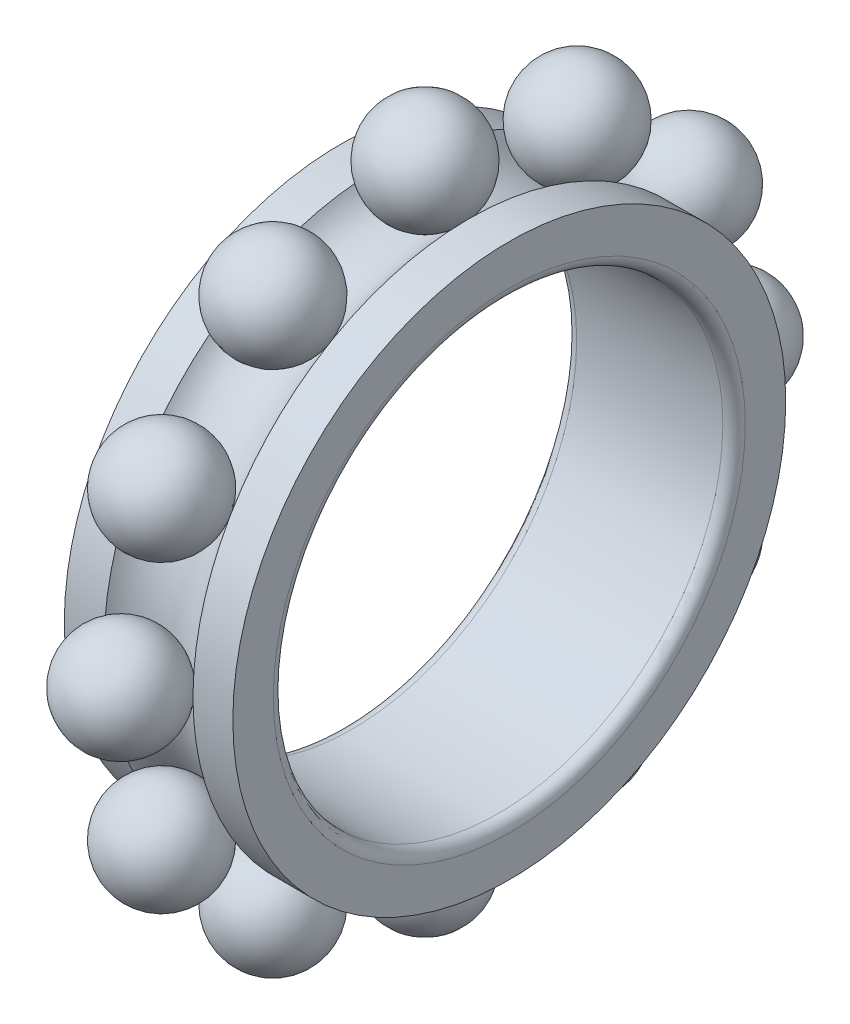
ISO-10303-21;
HEADER;
FILE_DESCRIPTION(('STEP AP214'),'2;1');
FILE_NAME('part.step','',(''),(''),'','','');
FILE_SCHEMA(('AUTOMOTIVE_DESIGN { 1 0 10303 214 1 1 1 1 }'));
ENDSEC;
DATA;
#1=APPLICATION_CONTEXT('core data for automotive mechanical design processes');
#2=APPLICATION_PROTOCOL_DEFINITION('international standard','automotive_design',2000,#1);
#3=PRODUCT_CONTEXT('',#1,'mechanical');
#4=PRODUCT('Part','Part','',(#3));
#5=PRODUCT_RELATED_PRODUCT_CATEGORY('part','',(#4));
#6=PRODUCT_DEFINITION_FORMATION('','',#4);
#7=PRODUCT_DEFINITION_CONTEXT('part definition',#1,'design');
#8=PRODUCT_DEFINITION('design','',#6,#7);
#9=PRODUCT_DEFINITION_SHAPE('','',#8);
#10=(LENGTH_UNIT() NAMED_UNIT(*) SI_UNIT(.MILLI.,.METRE.));
#11=(NAMED_UNIT(*) PLANE_ANGLE_UNIT() SI_UNIT($,.RADIAN.));
#12=(NAMED_UNIT(*) SI_UNIT($,.STERADIAN.) SOLID_ANGLE_UNIT());
#13=UNCERTAINTY_MEASURE_WITH_UNIT(LENGTH_MEASURE(1.E-05),#10,'distance_accuracy_value','');
#14=(GEOMETRIC_REPRESENTATION_CONTEXT(3) GLOBAL_UNCERTAINTY_ASSIGNED_CONTEXT((#13)) GLOBAL_UNIT_ASSIGNED_CONTEXT((#10,
#11,#12)) REPRESENTATION_CONTEXT('',''));
#15=CARTESIAN_POINT('',(0.,0.,0.));
#16=DIRECTION('',(0.,0.,1.));
#17=DIRECTION('',(1.,0.,0.));
#18=AXIS2_PLACEMENT_3D('',#15,#16,#17);
#19=CARTESIAN_POINT('',(0.,0.,0.));
#20=DIRECTION('',(-1.,0.,0.));
#21=DIRECTION('',(0.,0.,1.));
#22=AXIS2_PLACEMENT_3D('',#19,#20,#21);
#23=CYLINDRICAL_SURFACE('',#22,24.6);
#24=CARTESIAN_POINT('',(0.,0.,0.));
#25=DIRECTION('',(-1.,0.,0.));
#26=DIRECTION('',(0.,0.,1.));
#27=AXIS2_PLACEMENT_3D('',#24,#25,#26);
#28=CIRCLE('',#27,24.6);
#29=CARTESIAN_POINT('',(0.,0.,24.6));
#30=VERTEX_POINT('',#29);
#31=EDGE_CURVE('E489',#30,#30,#28,.T.);
#32=ORIENTED_EDGE('',*,*,#31,.F.);
#33=EDGE_LOOP('',(#32));
#34=FACE_BOUND('',#33,.T.);
#35=CARTESIAN_POINT('',(3.54391983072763,21.4175301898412,12.1016280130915));
#36=CARTESIAN_POINT('',(3.5390853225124,21.3800679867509,12.1679288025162));
#37=CARTESIAN_POINT('',(3.53666806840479,21.3422995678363,12.2340527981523));
#38=CARTESIAN_POINT('',(3.53666806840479,21.2661502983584,12.3659472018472));
#39=CARTESIAN_POINT('',(3.5390853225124,21.2277694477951,12.4317176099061));
#40=CARTESIAN_POINT('',(3.54391983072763,21.1890823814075,12.4973112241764));
#41=B_SPLINE_CURVE_WITH_KNOTS('',3,(#35,#36,#37,#38,#39,#40),.UNSPECIFIED.,.F.,.F.,(4,2,4),(0.,
0.228565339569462,0.457130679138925),.UNSPECIFIED.);
#42=CARTESIAN_POINT('',(3.54371983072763,21.4159708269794,12.104387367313));
#43=VERTEX_POINT('',#42);
#44=CARTESIAN_POINT('',(3.54371983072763,21.1906923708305,12.4945810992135));
#45=VERTEX_POINT('',#44);
#46=EDGE_CURVE('E198',#43,#45,#41,.T.);
#47=ORIENTED_EDGE('',*,*,#46,.F.);
#48=CARTESIAN_POINT('',(3.54371983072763,0.,0.));
#49=DIRECTION('',(-1.,0.,0.));
#50=DIRECTION('',(0.,0.,1.));
#51=AXIS2_PLACEMENT_3D('',#48,#49,#50);
#52=CIRCLE('',#51,24.6);
#53=CARTESIAN_POINT('',(3.54371983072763,24.5989684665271,0.225278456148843));
#54=VERTEX_POINT('',#53);
#55=EDGE_CURVE('E206',#43,#54,#52,.T.);
#56=ORIENTED_EDGE('',*,*,#55,.T.);
#57=CARTESIAN_POINT('',(3.54391983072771,24.5989392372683,-0.228447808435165));
#58=CARTESIAN_POINT('',(3.53908532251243,24.5996464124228,-0.152298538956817));
#59=CARTESIAN_POINT('',(3.53666806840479,24.6,-0.0761492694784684));
#60=CARTESIAN_POINT('',(3.53666806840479,24.6,0.0761492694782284));
#61=CARTESIAN_POINT('',(3.53908532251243,24.5996464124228,0.152298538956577));
#62=CARTESIAN_POINT('',(3.54391983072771,24.5989392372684,0.228447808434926));
#63=B_SPLINE_CURVE_WITH_KNOTS('',3,(#57,#58,#59,#60,#61,#62),.UNSPECIFIED.,.F.,.F.,(4,2,4),(0.,
0.228565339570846,0.457130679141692),.UNSPECIFIED.);
#64=CARTESIAN_POINT('',(3.54371983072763,24.5989684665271,-0.225278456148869));
#65=VERTEX_POINT('',#64);
#66=EDGE_CURVE('E216',#65,#54,#63,.T.);
#67=ORIENTED_EDGE('',*,*,#66,.F.);
#68=CARTESIAN_POINT('',(3.54371983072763,21.4159708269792,-12.1043873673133));
#69=VERTEX_POINT('',#68);
#70=EDGE_CURVE('E218',#65,#69,#52,.T.);
#71=ORIENTED_EDGE('',*,*,#70,.T.);
#72=CARTESIAN_POINT('',(3.54391983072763,21.1890823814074,-12.4973112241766));
#73=CARTESIAN_POINT('',(3.5390853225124,21.227769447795,-12.4317176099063));
#74=CARTESIAN_POINT('',(3.53666806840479,21.2661502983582,-12.3659472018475));
#75=CARTESIAN_POINT('',(3.53666806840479,21.3422995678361,-12.2340527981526));
#76=CARTESIAN_POINT('',(3.5390853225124,21.3800679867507,-12.1679288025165));
#77=CARTESIAN_POINT('',(3.54391983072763,21.417530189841,-12.1016280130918));
#78=B_SPLINE_CURVE_WITH_KNOTS('',3,(#72,#73,#74,#75,#76,#77),.UNSPECIFIED.,.F.,.F.,(4,2,4),(0.,
0.228565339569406,0.457130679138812),.UNSPECIFIED.);
#79=CARTESIAN_POINT('',(3.54371983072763,21.1906923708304,-12.4945810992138));
#80=VERTEX_POINT('',#79);
#81=EDGE_CURVE('E944',#80,#69,#78,.T.);
#82=ORIENTED_EDGE('',*,*,#81,.F.);
#83=CARTESIAN_POINT('',(3.54371983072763,12.4945810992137,-21.1906923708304));
#84=VERTEX_POINT('',#83);
#85=EDGE_CURVE('E225',#80,#84,#52,.T.);
#86=ORIENTED_EDGE('',*,*,#85,.T.);
#87=CARTESIAN_POINT('',(3.54391983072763,12.1016280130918,-21.417530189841));
#88=CARTESIAN_POINT('',(3.5390853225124,12.1679288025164,-21.3800679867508));
#89=CARTESIAN_POINT('',(3.53666806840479,12.2340527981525,-21.3422995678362));
#90=CARTESIAN_POINT('',(3.53666806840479,12.3659472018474,-21.2661502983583));
#91=CARTESIAN_POINT('',(3.5390853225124,12.4317176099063,-21.227769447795));
#92=CARTESIAN_POINT('',(3.54391983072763,12.4973112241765,-21.1890823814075));
#93=B_SPLINE_CURVE_WITH_KNOTS('',3,(#87,#88,#89,#90,#91,#92),.UNSPECIFIED.,.F.,.F.,(4,2,4),(0.,
0.228565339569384,0.457130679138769),.UNSPECIFIED.);
#94=CARTESIAN_POINT('',(3.54371983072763,12.1043873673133,-21.4159708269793));
#95=VERTEX_POINT('',#94);
#96=EDGE_CURVE('E579',#95,#84,#93,.T.);
#97=ORIENTED_EDGE('',*,*,#96,.F.);
#98=CARTESIAN_POINT('',(3.54371983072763,0.225278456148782,-24.5989684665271));
#99=VERTEX_POINT('',#98);
#100=EDGE_CURVE('E231',#95,#99,#52,.T.);
#101=ORIENTED_EDGE('',*,*,#100,.T.);
#102=CARTESIAN_POINT('',(3.54391983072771,-0.228447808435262,-24.5989392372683));
#103=CARTESIAN_POINT('',(3.53908532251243,-0.152298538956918,-24.5996464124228));
#104=CARTESIAN_POINT('',(3.53666806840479,-0.0761492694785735,-24.6));
#105=CARTESIAN_POINT('',(3.53666806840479,0.0761492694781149,-24.6));
#106=CARTESIAN_POINT('',(3.53908532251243,0.152298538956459,-24.5996464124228));
#107=CARTESIAN_POINT('',(3.54391983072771,0.228447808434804,-24.5989392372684));
#108=B_SPLINE_CURVE_WITH_KNOTS('',3,(#102,#103,#104,#105,#106,#107),.UNSPECIFIED.,.F.,.F.,(4,2,
4),(0.,0.228565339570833,0.457130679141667),.UNSPECIFIED.);
#109=CARTESIAN_POINT('',(3.54371983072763,-0.225278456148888,-24.5989684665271));
#110=VERTEX_POINT('',#109);
#111=EDGE_CURVE('E573',#110,#99,#108,.T.);
#112=ORIENTED_EDGE('',*,*,#111,.F.);
#113=CARTESIAN_POINT('',(3.54371983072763,-12.1043873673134,-21.4159708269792));
#114=VERTEX_POINT('',#113);
#115=EDGE_CURVE('E235',#110,#114,#52,.T.);
#116=ORIENTED_EDGE('',*,*,#115,.T.);
#117=CARTESIAN_POINT('',(3.54391983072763,-12.4973112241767,-21.1890823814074));
#118=CARTESIAN_POINT('',(3.5390853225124,-12.4317176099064,-21.2277694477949));
#119=CARTESIAN_POINT('',(3.53666806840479,-12.3659472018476,-21.2661502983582));
#120=CARTESIAN_POINT('',(3.53666806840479,-12.2340527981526,-21.3422995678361));
#121=CARTESIAN_POINT('',(3.5390853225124,-12.1679288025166,-21.3800679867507));
#122=CARTESIAN_POINT('',(3.54391983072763,-12.1016280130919,-21.417530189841));
#123=B_SPLINE_CURVE_WITH_KNOTS('',3,(#117,#118,#119,#120,#121,#122),.UNSPECIFIED.,.F.,.F.,(4,2,
4),(0.,0.228565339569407,0.457130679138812),.UNSPECIFIED.);
#124=CARTESIAN_POINT('',(3.54371983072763,-12.4945810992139,-21.1906923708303));
#125=VERTEX_POINT('',#124);
#126=EDGE_CURVE('E580',#125,#114,#123,.T.);
#127=ORIENTED_EDGE('',*,*,#126,.F.);
#128=CARTESIAN_POINT('',(3.54371983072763,-21.1906923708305,-12.4945810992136));
#129=VERTEX_POINT('',#128);
#130=EDGE_CURVE('E239',#125,#129,#52,.T.);
#131=ORIENTED_EDGE('',*,*,#130,.T.);
#132=CARTESIAN_POINT('',(3.54391983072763,-21.4175301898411,-12.1016280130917));
#133=CARTESIAN_POINT('',(3.5390853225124,-21.3800679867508,-12.1679288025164));
#134=CARTESIAN_POINT('',(3.53666806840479,-21.3422995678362,-12.2340527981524));
#135=CARTESIAN_POINT('',(3.53666806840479,-21.2661502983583,-12.3659472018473));
#136=CARTESIAN_POINT('',(3.5390853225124,-21.2277694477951,-12.4317176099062));
#137=CARTESIAN_POINT('',(3.54391983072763,-21.1890823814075,-12.4973112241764));
#138=B_SPLINE_CURVE_WITH_KNOTS('',3,(#132,#133,#134,#135,#136,#137),.UNSPECIFIED.,.F.,.F.,(4,2,
4),(0.,0.228565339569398,0.457130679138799),.UNSPECIFIED.);
#139=CARTESIAN_POINT('',(3.54371983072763,-21.4159708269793,-12.1043873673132));
#140=VERTEX_POINT('',#139);
#141=EDGE_CURVE('E584',#140,#129,#138,.T.);
#142=ORIENTED_EDGE('',*,*,#141,.F.);
#143=CARTESIAN_POINT('',(3.54371983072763,-24.5989684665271,-0.225278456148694));
#144=VERTEX_POINT('',#143);
#145=EDGE_CURVE('E243',#140,#144,#52,.T.);
#146=ORIENTED_EDGE('',*,*,#145,.T.);
#147=CARTESIAN_POINT('',(3.54391983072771,-24.5989392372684,0.228447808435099));
#148=CARTESIAN_POINT('',(3.53908532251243,-24.5996464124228,0.15229853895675));
#149=CARTESIAN_POINT('',(3.53666806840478,-24.6,0.0761492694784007));
#150=CARTESIAN_POINT('',(3.53666806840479,-24.6,-0.0761492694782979));
#151=CARTESIAN_POINT('',(3.53908532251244,-24.5996464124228,-0.152298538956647));
#152=CARTESIAN_POINT('',(3.54391983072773,-24.5989392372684,-0.228447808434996));
#153=B_SPLINE_CURVE_WITH_KNOTS('',3,(#147,#148,#149,#150,#151,#152),.UNSPECIFIED.,.F.,.F.,(4,2,
4),(0.,0.228565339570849,0.457130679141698),.UNSPECIFIED.);
#154=CARTESIAN_POINT('',(3.54371983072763,-24.5989684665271,0.225278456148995));
#155=VERTEX_POINT('',#154);
#156=EDGE_CURVE('E593',#155,#144,#153,.T.);
#157=ORIENTED_EDGE('',*,*,#156,.F.);
#158=CARTESIAN_POINT('',(3.54371983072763,-21.4159708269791,12.1043873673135));
#159=VERTEX_POINT('',#158);
#160=EDGE_CURVE('E247',#155,#159,#52,.T.);
#161=ORIENTED_EDGE('',*,*,#160,.T.);
#162=CARTESIAN_POINT('',(3.54391983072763,-21.1890823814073,12.4973112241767));
#163=CARTESIAN_POINT('',(3.5390853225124,-21.2277694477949,12.4317176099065));
#164=CARTESIAN_POINT('',(3.53666806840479,-21.2661502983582,12.3659472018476));
#165=CARTESIAN_POINT('',(3.53666806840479,-21.342299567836,12.2340527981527));
#166=CARTESIAN_POINT('',(3.5390853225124,-21.3800679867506,12.1679288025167));
#167=CARTESIAN_POINT('',(3.54391983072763,-21.4175301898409,12.101628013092));
#168=B_SPLINE_CURVE_WITH_KNOTS('',3,(#162,#163,#164,#165,#166,#167),.UNSPECIFIED.,.F.,.F.,(4,2,
4),(0.,0.228565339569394,0.457130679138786),.UNSPECIFIED.);
#169=CARTESIAN_POINT('',(3.54371983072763,-21.1906923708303,12.494581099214));
#170=VERTEX_POINT('',#169);
#171=EDGE_CURVE('E426',#170,#159,#168,.T.);
#172=ORIENTED_EDGE('',*,*,#171,.F.);
#173=CARTESIAN_POINT('',(3.54371983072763,-12.4945810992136,21.1906923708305));
#174=VERTEX_POINT('',#173);
#175=EDGE_CURVE('E251',#170,#174,#52,.T.);
#176=ORIENTED_EDGE('',*,*,#175,.T.);
#177=CARTESIAN_POINT('',(3.54391983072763,-12.1016280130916,21.4175301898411));
#178=CARTESIAN_POINT('',(3.5390853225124,-12.1679288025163,21.3800679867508));
#179=CARTESIAN_POINT('',(3.53666806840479,-12.2340527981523,21.3422995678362));
#180=CARTESIAN_POINT('',(3.53666806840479,-12.3659472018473,21.2661502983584));
#181=CARTESIAN_POINT('',(3.5390853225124,-12.4317176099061,21.2277694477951));
#182=CARTESIAN_POINT('',(3.54391983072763,-12.4973112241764,21.1890823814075));
#183=B_SPLINE_CURVE_WITH_KNOTS('',3,(#177,#178,#179,#180,#181,#182),.UNSPECIFIED.,.F.,.F.,(4,2,
4),(0.,0.22856533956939,0.457130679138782),.UNSPECIFIED.);
#184=CARTESIAN_POINT('',(3.54371983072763,-12.1043873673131,21.4159708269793));
#185=VERTEX_POINT('',#184);
#186=EDGE_CURVE('E421',#185,#174,#183,.T.);
#187=ORIENTED_EDGE('',*,*,#186,.F.);
#188=CARTESIAN_POINT('',(3.54371983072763,-0.225278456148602,24.5989684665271));
#189=VERTEX_POINT('',#188);
#190=EDGE_CURVE('E255',#185,#189,#52,.T.);
#191=ORIENTED_EDGE('',*,*,#190,.T.);
#192=CARTESIAN_POINT('',(3.54391983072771,0.228447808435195,24.5989392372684));
#193=CARTESIAN_POINT('',(3.53908532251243,0.152298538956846,24.5996464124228));
#194=CARTESIAN_POINT('',(3.53666806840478,0.0761492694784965,24.6));
#195=CARTESIAN_POINT('',(3.53666806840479,-0.0761492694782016,24.6));
#196=CARTESIAN_POINT('',(3.53908532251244,-0.152298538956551,24.5996464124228));
#197=CARTESIAN_POINT('',(3.54391983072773,-0.2284478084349,24.5989392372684));
#198=B_SPLINE_CURVE_WITH_KNOTS('',3,(#192,#193,#194,#195,#196,#197),.UNSPECIFIED.,.F.,.F.,(4,2,
4),(0.,0.228565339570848,0.457130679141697),.UNSPECIFIED.);
#199=CARTESIAN_POINT('',(3.54371983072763,0.225278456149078,24.5989684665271));
#200=VERTEX_POINT('',#199);
#201=EDGE_CURVE('E264',#200,#189,#198,.T.);
#202=ORIENTED_EDGE('',*,*,#201,.F.);
#203=CARTESIAN_POINT('',(3.54371983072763,12.1043873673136,21.4159708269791));
#204=VERTEX_POINT('',#203);
#205=EDGE_CURVE('E219',#200,#204,#52,.T.);
#206=ORIENTED_EDGE('',*,*,#205,.T.);
#207=CARTESIAN_POINT('',(3.54391983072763,12.4973112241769,21.1890823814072));
#208=CARTESIAN_POINT('',(3.5390853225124,12.4317176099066,21.2277694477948));
#209=CARTESIAN_POINT('',(3.53666806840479,12.3659472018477,21.2661502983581));
#210=CARTESIAN_POINT('',(3.53666806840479,12.2340527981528,21.342299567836));
#211=CARTESIAN_POINT('',(3.5390853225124,12.1679288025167,21.3800679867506));
#212=CARTESIAN_POINT('',(3.54391983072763,12.101628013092,21.4175301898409));
#213=B_SPLINE_CURVE_WITH_KNOTS('',3,(#207,#208,#209,#210,#211,#212),.UNSPECIFIED.,.F.,.F.,(4,2,
4),(0.,0.228565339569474,0.457130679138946),.UNSPECIFIED.);
#214=CARTESIAN_POINT('',(3.54371983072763,12.494581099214,21.1906923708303));
#215=VERTEX_POINT('',#214);
#216=EDGE_CURVE('E263',#215,#204,#213,.T.);
#217=ORIENTED_EDGE('',*,*,#216,.F.);
#218=EDGE_CURVE('E210',#215,#45,#52,.T.);
#219=ORIENTED_EDGE('',*,*,#218,.T.);
#220=EDGE_LOOP('',(#47,#56,#67,#71,#82,#86,#97,#101,#112,#116,#127,#131,#142,#146,#157,#161,
#172,#176,#187,#191,#202,#206,#217,#219));
#221=FACE_BOUND('',#220,.T.);
#222=ADVANCED_FACE('F32',(#34,#221),#23,.T.);
#223=CARTESIAN_POINT('',(0.,0.,0.));
#224=DIRECTION('',(-1.,0.,0.));
#225=DIRECTION('',(0.,0.,1.));
#226=AXIS2_PLACEMENT_3D('',#223,#224,#225);
#227=CYLINDRICAL_SURFACE('',#226,24.6);
#228=CARTESIAN_POINT('',(15.,0.,0.));
#229=DIRECTION('',(-1.,0.,0.));
#230=DIRECTION('',(0.,0.,1.));
#231=AXIS2_PLACEMENT_3D('',#228,#229,#230);
#232=CIRCLE('',#231,24.6);
#233=CARTESIAN_POINT('',(15.,0.,24.6));
#234=VERTEX_POINT('',#233);
#235=EDGE_CURVE('E473',#234,#234,#232,.T.);
#236=ORIENTED_EDGE('',*,*,#235,.T.);
#237=EDGE_LOOP('',(#236));
#238=FACE_BOUND('',#237,.T.);
#239=CARTESIAN_POINT('',(11.4560801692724,21.1890823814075,12.4973112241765));
#240=CARTESIAN_POINT('',(11.4609146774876,21.2277694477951,12.4317176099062));
#241=CARTESIAN_POINT('',(11.4633319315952,21.2661502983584,12.3659472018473));
#242=CARTESIAN_POINT('',(11.4633319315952,21.3422995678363,12.2340527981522));
#243=CARTESIAN_POINT('',(11.4609146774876,21.380067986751,12.1679288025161));
#244=CARTESIAN_POINT('',(11.4560801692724,21.4175301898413,12.1016280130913));
#245=B_SPLINE_CURVE_WITH_KNOTS('',3,(#239,#240,#241,#242,#243,#244),.UNSPECIFIED.,.F.,.F.,(4,2,
4),(0.,0.228565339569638,0.457130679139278),.UNSPECIFIED.);
#246=CARTESIAN_POINT('',(11.4562801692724,21.1906923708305,12.4945810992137));
#247=VERTEX_POINT('',#246);
#248=CARTESIAN_POINT('',(11.4562801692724,21.4159708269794,12.104387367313));
#249=VERTEX_POINT('',#248);
#250=EDGE_CURVE('E53',#247,#249,#245,.T.);
#251=ORIENTED_EDGE('',*,*,#250,.F.);
#252=CARTESIAN_POINT('',(11.4562801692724,0.,0.));
#253=DIRECTION('',(-1.,0.,0.));
#254=DIRECTION('',(0.,0.,1.));
#255=AXIS2_PLACEMENT_3D('',#252,#253,#254);
#256=CIRCLE('',#255,24.6);
#257=CARTESIAN_POINT('',(11.4562801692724,12.494581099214,21.1906923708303));
#258=VERTEX_POINT('',#257);
#259=EDGE_CURVE('E228',#258,#247,#256,.T.);
#260=ORIENTED_EDGE('',*,*,#259,.F.);
#261=CARTESIAN_POINT('',(11.4560801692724,12.1016280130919,21.417530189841));
#262=CARTESIAN_POINT('',(11.4609146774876,12.1679288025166,21.3800679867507));
#263=CARTESIAN_POINT('',(11.4633319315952,12.2340527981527,21.342299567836));
#264=CARTESIAN_POINT('',(11.4633319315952,12.3659472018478,21.2661502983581));
#265=CARTESIAN_POINT('',(11.4609146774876,12.4317176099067,21.2277694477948));
#266=CARTESIAN_POINT('',(11.4560801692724,12.497311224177,21.1890823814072));
#267=B_SPLINE_CURVE_WITH_KNOTS('',3,(#261,#262,#263,#264,#265,#266),.UNSPECIFIED.,.F.,.F.,(4,2,
4),(0.,0.228565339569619,0.457130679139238),.UNSPECIFIED.);
#268=CARTESIAN_POINT('',(11.4562801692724,12.1043873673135,21.4159708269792));
#269=VERTEX_POINT('',#268);
#270=EDGE_CURVE('E61',#269,#258,#267,.T.);
#271=ORIENTED_EDGE('',*,*,#270,.F.);
#272=CARTESIAN_POINT('',(11.4562801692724,0.225278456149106,24.5989684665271));
#273=VERTEX_POINT('',#272);
#274=EDGE_CURVE('E272',#273,#269,#256,.T.);
#275=ORIENTED_EDGE('',*,*,#274,.F.);
#276=CARTESIAN_POINT('',(11.4560801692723,-0.228447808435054,24.5989392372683));
#277=CARTESIAN_POINT('',(11.4609146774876,-0.152298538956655,24.5996464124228));
#278=CARTESIAN_POINT('',(11.4633319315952,-0.0761492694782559,24.6));
#279=CARTESIAN_POINT('',(11.4633319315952,0.0761492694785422,24.6));
#280=CARTESIAN_POINT('',(11.4609146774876,0.152298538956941,24.5996464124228));
#281=CARTESIAN_POINT('',(11.4560801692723,0.22844780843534,24.5989392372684));
#282=B_SPLINE_CURVE_WITH_KNOTS('',3,(#276,#277,#278,#279,#280,#281),.UNSPECIFIED.,.F.,.F.,(4,2,
4),(0.,0.228565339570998,0.457130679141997),.UNSPECIFIED.);
#283=CARTESIAN_POINT('',(11.4562801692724,-0.225278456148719,24.5989684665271));
#284=VERTEX_POINT('',#283);
#285=EDGE_CURVE('E410',#284,#273,#282,.T.);
#286=ORIENTED_EDGE('',*,*,#285,.F.);
#287=CARTESIAN_POINT('',(11.4562801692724,-12.1043873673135,21.4159708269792));
#288=VERTEX_POINT('',#287);
#289=EDGE_CURVE('E465',#288,#284,#256,.T.);
#290=ORIENTED_EDGE('',*,*,#289,.F.);
#291=CARTESIAN_POINT('',(11.4560801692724,-12.4973112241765,21.1890823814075));
#292=CARTESIAN_POINT('',(11.4609146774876,-12.4317176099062,21.2277694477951));
#293=CARTESIAN_POINT('',(11.4633319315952,-12.3659472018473,21.2661502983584));
#294=CARTESIAN_POINT('',(11.4633319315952,-12.2340527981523,21.3422995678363));
#295=CARTESIAN_POINT('',(11.4609146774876,-12.1679288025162,21.3800679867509));
#296=CARTESIAN_POINT('',(11.4560801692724,-12.1016280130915,21.4175301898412));
#297=B_SPLINE_CURVE_WITH_KNOTS('',3,(#291,#292,#293,#294,#295,#296),.UNSPECIFIED.,.F.,.F.,(4,2,
4),(0.,0.228565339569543,0.457130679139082),.UNSPECIFIED.);
#298=CARTESIAN_POINT('',(11.4562801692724,-12.4945810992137,21.1906923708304));
#299=VERTEX_POINT('',#298);
#300=EDGE_CURVE('E404',#299,#288,#297,.T.);
#301=ORIENTED_EDGE('',*,*,#300,.F.);
#302=CARTESIAN_POINT('',(11.4562801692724,-21.1906923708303,12.4945810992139));
#303=VERTEX_POINT('',#302);
#304=EDGE_CURVE('E469',#303,#299,#256,.T.);
#305=ORIENTED_EDGE('',*,*,#304,.F.);
#306=CARTESIAN_POINT('',(11.4560801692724,-21.417530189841,12.1016280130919));
#307=CARTESIAN_POINT('',(11.4609146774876,-21.3800679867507,12.1679288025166));
#308=CARTESIAN_POINT('',(11.4633319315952,-21.342299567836,12.2340527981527));
#309=CARTESIAN_POINT('',(11.4633319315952,-21.2661502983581,12.3659472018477));
#310=CARTESIAN_POINT('',(11.4609146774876,-21.2277694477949,12.4317176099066));
#311=CARTESIAN_POINT('',(11.4560801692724,-21.1890823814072,12.4973112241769));
#312=B_SPLINE_CURVE_WITH_KNOTS('',3,(#306,#307,#308,#309,#310,#311),.UNSPECIFIED.,.F.,.F.,(4,2,
4),(0.,0.228565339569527,0.457130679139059),.UNSPECIFIED.);
#313=CARTESIAN_POINT('',(11.4562801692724,-21.4159708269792,12.1043873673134));
#314=VERTEX_POINT('',#313);
#315=EDGE_CURVE('E395',#314,#303,#312,.T.);
#316=ORIENTED_EDGE('',*,*,#315,.F.);
#317=CARTESIAN_POINT('',(11.4562801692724,-24.5989684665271,0.225278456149));
#318=VERTEX_POINT('',#317);
#319=EDGE_CURVE('E653',#318,#314,#256,.T.);
#320=ORIENTED_EDGE('',*,*,#319,.F.);
#321=CARTESIAN_POINT('',(11.4560801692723,-24.5989392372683,-0.228447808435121));
#322=CARTESIAN_POINT('',(11.4609146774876,-24.5996464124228,-0.15229853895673));
#323=CARTESIAN_POINT('',(11.4633319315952,-24.6,-0.0761492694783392));
#324=CARTESIAN_POINT('',(11.4633319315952,-24.6,0.0761492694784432));
#325=CARTESIAN_POINT('',(11.4609146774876,-24.5996464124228,0.152298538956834));
#326=CARTESIAN_POINT('',(11.4560801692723,-24.5989392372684,0.228447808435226));
#327=B_SPLINE_CURVE_WITH_KNOTS('',3,(#321,#322,#323,#324,#325,#326),.UNSPECIFIED.,.F.,.F.,(4,2,
4),(0.,0.228565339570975,0.457130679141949),.UNSPECIFIED.);
#328=CARTESIAN_POINT('',(11.4562801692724,-24.5989684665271,-0.225278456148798));
#329=VERTEX_POINT('',#328);
#330=EDGE_CURVE('E386',#329,#318,#327,.T.);
#331=ORIENTED_EDGE('',*,*,#330,.F.);
#332=CARTESIAN_POINT('',(11.4562801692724,-21.4159708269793,-12.1043873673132));
#333=VERTEX_POINT('',#332);
#334=EDGE_CURVE('E654',#333,#329,#256,.T.);
#335=ORIENTED_EDGE('',*,*,#334,.F.);
#336=CARTESIAN_POINT('',(11.4560801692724,-21.1890823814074,-12.4973112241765));
#337=CARTESIAN_POINT('',(11.4609146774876,-21.227769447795,-12.4317176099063));
#338=CARTESIAN_POINT('',(11.4633319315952,-21.2661502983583,-12.3659472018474));
#339=CARTESIAN_POINT('',(11.4633319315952,-21.3422995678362,-12.2340527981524));
#340=CARTESIAN_POINT('',(11.4609146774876,-21.3800679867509,-12.1679288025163));
#341=CARTESIAN_POINT('',(11.4560801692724,-21.4175301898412,-12.1016280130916));
#342=B_SPLINE_CURVE_WITH_KNOTS('',3,(#336,#337,#338,#339,#340,#341),.UNSPECIFIED.,.F.,.F.,(4,2,
4),(0.,0.228565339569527,0.457130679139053),.UNSPECIFIED.);
#343=CARTESIAN_POINT('',(11.4562801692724,-21.1906923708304,-12.4945810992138));
#344=VERTEX_POINT('',#343);
#345=EDGE_CURVE('E377',#344,#333,#342,.T.);
#346=ORIENTED_EDGE('',*,*,#345,.F.);
#347=CARTESIAN_POINT('',(11.4562801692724,-12.4945810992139,-21.1906923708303));
#348=VERTEX_POINT('',#347);
#349=EDGE_CURVE('E657',#348,#344,#256,.T.);
#350=ORIENTED_EDGE('',*,*,#349,.F.);
#351=CARTESIAN_POINT('',(11.4560801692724,-12.1016280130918,-21.417530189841));
#352=CARTESIAN_POINT('',(11.4609146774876,-12.1679288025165,-21.3800679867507));
#353=CARTESIAN_POINT('',(11.4633319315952,-12.2340527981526,-21.3422995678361));
#354=CARTESIAN_POINT('',(11.4633319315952,-12.3659472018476,-21.2661502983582));
#355=CARTESIAN_POINT('',(11.4609146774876,-12.4317176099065,-21.2277694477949));
#356=CARTESIAN_POINT('',(11.4560801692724,-12.4973112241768,-21.1890823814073));
#357=B_SPLINE_CURVE_WITH_KNOTS('',3,(#351,#352,#353,#354,#355,#356),.UNSPECIFIED.,.F.,.F.,(4,2,
4),(0.,0.228565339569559,0.45713067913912),.UNSPECIFIED.);
#358=CARTESIAN_POINT('',(11.4562801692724,-12.1043873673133,-21.4159708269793));
#359=VERTEX_POINT('',#358);
#360=EDGE_CURVE('E368',#359,#348,#357,.T.);
#361=ORIENTED_EDGE('',*,*,#360,.F.);
#362=CARTESIAN_POINT('',(11.4562801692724,-0.225278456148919,-24.5989684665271));
#363=VERTEX_POINT('',#362);
#364=EDGE_CURVE('E662',#363,#359,#256,.T.);
#365=ORIENTED_EDGE('',*,*,#364,.F.);
#366=CARTESIAN_POINT('',(11.4560801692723,0.228447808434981,-24.5989392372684));
#367=CARTESIAN_POINT('',(11.4609146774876,0.152298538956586,-24.5996464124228));
#368=CARTESIAN_POINT('',(11.4633319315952,0.0761492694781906,-24.6));
#369=CARTESIAN_POINT('',(11.4633319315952,-0.0761492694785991,-24.6));
#370=CARTESIAN_POINT('',(11.4609146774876,-0.152298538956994,-24.5996464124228));
#371=CARTESIAN_POINT('',(11.4560801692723,-0.228447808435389,-24.5989392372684));
#372=B_SPLINE_CURVE_WITH_KNOTS('',3,(#366,#367,#368,#369,#370,#371),.UNSPECIFIED.,.F.,.F.,(4,2,
4),(0.,0.228565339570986,0.457130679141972),.UNSPECIFIED.);
#373=CARTESIAN_POINT('',(11.4562801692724,0.225278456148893,-24.5989684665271));
#374=VERTEX_POINT('',#373);
#375=EDGE_CURVE('E359',#374,#363,#372,.T.);
#376=ORIENTED_EDGE('',*,*,#375,.F.);
#377=CARTESIAN_POINT('',(11.4562801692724,12.1043873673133,-21.4159708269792));
#378=VERTEX_POINT('',#377);
#379=EDGE_CURVE('E666',#378,#374,#256,.T.);
#380=ORIENTED_EDGE('',*,*,#379,.F.);
#381=CARTESIAN_POINT('',(11.4560801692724,12.4973112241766,-21.1890823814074));
#382=CARTESIAN_POINT('',(11.4609146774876,12.4317176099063,-21.227769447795));
#383=CARTESIAN_POINT('',(11.4633319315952,12.3659472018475,-21.2661502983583));
#384=CARTESIAN_POINT('',(11.4633319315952,12.2340527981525,-21.3422995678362));
#385=CARTESIAN_POINT('',(11.4609146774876,12.1679288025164,-21.3800679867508));
#386=CARTESIAN_POINT('',(11.4560801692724,12.1016280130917,-21.4175301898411));
#387=B_SPLINE_CURVE_WITH_KNOTS('',3,(#381,#382,#383,#384,#385,#386),.UNSPECIFIED.,.F.,.F.,(4,2,
4),(0.,0.228565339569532,0.457130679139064),.UNSPECIFIED.);
#388=CARTESIAN_POINT('',(11.4562801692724,12.4945810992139,-21.1906923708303));
#389=VERTEX_POINT('',#388);
#390=EDGE_CURVE('E350',#389,#378,#387,.T.);
#391=ORIENTED_EDGE('',*,*,#390,.F.);
#392=CARTESIAN_POINT('',(11.4562801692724,21.1906923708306,-12.4945810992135));
#393=VERTEX_POINT('',#392);
#394=EDGE_CURVE('E474',#393,#389,#256,.T.);
#395=ORIENTED_EDGE('',*,*,#394,.F.);
#396=CARTESIAN_POINT('',(11.4560801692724,21.4175301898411,-12.1016280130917));
#397=CARTESIAN_POINT('',(11.4609146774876,21.3800679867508,-12.1679288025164));
#398=CARTESIAN_POINT('',(11.4633319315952,21.3422995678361,-12.2340527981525));
#399=CARTESIAN_POINT('',(11.4633319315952,21.2661502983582,-12.3659472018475));
#400=CARTESIAN_POINT('',(11.4609146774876,21.2277694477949,-12.4317176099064));
#401=CARTESIAN_POINT('',(11.4560801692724,21.1890823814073,-12.4973112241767));
#402=B_SPLINE_CURVE_WITH_KNOTS('',3,(#396,#397,#398,#399,#400,#401),.UNSPECIFIED.,.F.,.F.,(4,2,
4),(0.,0.228565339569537,0.457130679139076),.UNSPECIFIED.);
#403=CARTESIAN_POINT('',(11.4562801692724,21.4159708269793,-12.1043873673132));
#404=VERTEX_POINT('',#403);
#405=EDGE_CURVE('E341',#404,#393,#402,.T.);
#406=ORIENTED_EDGE('',*,*,#405,.F.);
#407=CARTESIAN_POINT('',(11.4562801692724,24.5989684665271,-0.225278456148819));
#408=VERTEX_POINT('',#407);
#409=EDGE_CURVE('E229',#408,#404,#256,.T.);
#410=ORIENTED_EDGE('',*,*,#409,.F.);
#411=CARTESIAN_POINT('',(11.4560801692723,24.5989392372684,0.228447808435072));
#412=CARTESIAN_POINT('',(11.4609146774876,24.5996464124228,0.152298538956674));
#413=CARTESIAN_POINT('',(11.4633319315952,24.6,0.076149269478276));
#414=CARTESIAN_POINT('',(11.4633319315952,24.6,-0.0761492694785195));
#415=CARTESIAN_POINT('',(11.4609146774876,24.5996464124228,-0.152298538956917));
#416=CARTESIAN_POINT('',(11.4560801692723,24.5989392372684,-0.228447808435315));
#417=B_SPLINE_CURVE_WITH_KNOTS('',3,(#411,#412,#413,#414,#415,#416),.UNSPECIFIED.,.F.,.F.,(4,2,
4),(0.,0.228565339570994,0.457130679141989),.UNSPECIFIED.);
#418=CARTESIAN_POINT('',(11.4562801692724,24.5989684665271,0.225278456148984));
#419=VERTEX_POINT('',#418);
#420=EDGE_CURVE('E220',#419,#408,#417,.T.);
#421=ORIENTED_EDGE('',*,*,#420,.F.);
#422=EDGE_CURVE('E224',#249,#419,#256,.T.);
#423=ORIENTED_EDGE('',*,*,#422,.F.);
#424=EDGE_LOOP('',(#251,#260,#271,#275,#286,#290,#301,#305,#316,#320,#331,#335,#346,#350,#361,
#365,#376,#380,#391,#395,#406,#410,#421,#423));
#425=FACE_BOUND('',#424,.T.);
#426=ADVANCED_FACE('F322',(#238,#425),#227,.T.);
#427=CARTESIAN_POINT('',(7.5,0.,0.));
#428=DIRECTION('',(-1.,0.,0.));
#429=DIRECTION('',(0.,0.,1.));
#430=AXIS2_PLACEMENT_3D('',#427,#428,#429);
#431=TOROIDAL_SURFACE('',#430,27.075,4.66666666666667);
#432=ORIENTED_EDGE('',*,*,#259,.T.);
#433=CARTESIAN_POINT('',(11.4701377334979,21.2101741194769,12.5054268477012));
#434=CARTESIAN_POINT('',(11.4656056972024,21.2037624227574,12.5018576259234));
#435=CARTESIAN_POINT('',(11.4610531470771,21.1973616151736,12.4982942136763));
#436=CARTESIAN_POINT('',(11.3870588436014,21.0939695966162,12.4407305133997));
#437=CARTESIAN_POINT('',(11.3129298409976,20.9995022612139,12.3880781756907));
#438=CARTESIAN_POINT('',(11.1558040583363,20.8163444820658,12.2859002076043));
#439=CARTESIAN_POINT('',(11.0728010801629,20.7276581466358,12.2363768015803));
#440=CARTESIAN_POINT('',(10.8983382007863,20.5565293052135,12.1407402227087));
#441=CARTESIAN_POINT('',(10.8068594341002,20.4741015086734,12.0946350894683));
#442=CARTESIAN_POINT('',(10.6162263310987,20.3162708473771,12.0062925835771));
#443=CARTESIAN_POINT('',(10.5170690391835,20.2408707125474,11.9640567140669));
#444=CARTESIAN_POINT('',(10.3119635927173,20.0977628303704,11.8838457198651));
#445=CARTESIAN_POINT('',(10.2060254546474,20.0300441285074,11.8458645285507));
#446=CARTESIAN_POINT('',(9.98794308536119,19.9026254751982,11.7743631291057));
#447=CARTESIAN_POINT('',(9.87579657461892,19.8429284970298,11.7408445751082));
#448=CARTESIAN_POINT('',(9.64625071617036,19.7320593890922,11.6785675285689));
#449=CARTESIAN_POINT('',(9.528856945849,19.6808784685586,11.6498041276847));
#450=CARTESIAN_POINT('',(9.28949791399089,19.5873074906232,11.5971997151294));
#451=CARTESIAN_POINT('',(9.16753098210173,19.5449206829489,11.5733605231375));
#452=CARTESIAN_POINT('',(8.91996587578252,19.4692687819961,11.5308011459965));
#453=CARTESIAN_POINT('',(8.79436865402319,19.4360013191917,11.512079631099));
#454=CARTESIAN_POINT('',(8.54035819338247,19.3787960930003,11.4798809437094));
#455=CARTESIAN_POINT('',(8.4119439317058,19.3548617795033,11.4664057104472));
#456=CARTESIAN_POINT('',(8.15328723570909,19.3165126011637,11.4448123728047));
#457=CARTESIAN_POINT('',(8.02304522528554,19.302095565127,11.4366930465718));
#458=CARTESIAN_POINT('',(7.76158207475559,19.2828697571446,11.4258651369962));
#459=CARTESIAN_POINT('',(7.63036059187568,19.278064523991,11.4231585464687));
#460=CARTESIAN_POINT('',(7.36798998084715,19.2781066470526,11.4231822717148));
#461=CARTESIAN_POINT('',(7.23684085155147,19.2829488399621,11.425909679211));
#462=CARTESIAN_POINT('',(6.97543126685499,19.3022449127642,11.4367771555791));
#463=CARTESIAN_POINT('',(6.84517113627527,19.3167021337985,11.4449191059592));
#464=CARTESIAN_POINT('',(6.58653995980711,19.3551260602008,11.4665545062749));
#465=CARTESIAN_POINT('',(6.45816851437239,19.3790907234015,11.4800468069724));
#466=CARTESIAN_POINT('',(6.20419864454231,19.4363615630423,11.512282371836));
#467=CARTESIAN_POINT('',(6.07860022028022,19.4696677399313,11.5310256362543));
#468=CARTESIAN_POINT('',(5.83104942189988,19.5453941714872,11.5736268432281));
#469=CARTESIAN_POINT('',(5.70909763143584,19.5878158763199,11.5974855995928));
#470=CARTESIAN_POINT('',(5.46976964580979,19.6814564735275,11.650128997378));
#471=CARTESIAN_POINT('',(5.35239187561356,19.7326723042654,11.6789119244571));
#472=CARTESIAN_POINT('',(5.12295288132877,19.8435757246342,11.7412080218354));
#473=CARTESIAN_POINT('',(5.01089390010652,19.9032668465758,11.7747231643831));
#474=CARTESIAN_POINT('',(4.79298162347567,20.0306627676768,11.8462115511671));
#475=CARTESIAN_POINT('',(4.68712606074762,20.098364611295,11.8841831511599));
#476=CARTESIAN_POINT('',(4.4823261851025,20.2413263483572,11.964311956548));
#477=CARTESIAN_POINT('',(4.38338196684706,20.3165863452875,12.0064692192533));
#478=CARTESIAN_POINT('',(4.19314396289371,20.4741075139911,12.0946384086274));
#479=CARTESIAN_POINT('',(4.10184736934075,20.5563660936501,12.1406489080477));
#480=CARTESIAN_POINT('',(3.92749159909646,20.7273523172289,12.2362059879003));
#481=CARTESIAN_POINT('',(3.8444342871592,20.8160814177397,12.2857533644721));
#482=CARTESIAN_POINT('',(3.68719862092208,20.9993377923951,12.387986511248));
#483=CARTESIAN_POINT('',(3.61301701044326,21.0938629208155,12.4406711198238));
#484=CARTESIAN_POINT('',(3.47392415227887,21.2882183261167,12.5488788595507));
#485=CARTESIAN_POINT('',(3.40902619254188,21.3880559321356,12.6044059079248));
#486=CARTESIAN_POINT('',(3.28910879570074,21.5921765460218,12.7177925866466));
#487=CARTESIAN_POINT('',(3.23408572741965,21.6964579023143,12.7756513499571));
#488=CARTESIAN_POINT('',(3.13425151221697,21.9088295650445,12.8933185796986));
#489=CARTESIAN_POINT('',(3.08944596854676,22.0169219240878,12.9531280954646));
#490=CARTESIAN_POINT('',(3.01041773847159,22.236065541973,13.0741935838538));
#491=CARTESIAN_POINT('',(2.97619108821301,22.3471156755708,13.1354490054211));
#492=CARTESIAN_POINT('',(2.91899316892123,22.5696761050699,13.2579938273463));
#493=CARTESIAN_POINT('',(2.8958536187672,22.6811518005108,13.3192675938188));
#494=CARTESIAN_POINT('',(2.86019692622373,22.9055056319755,13.4423367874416));
#495=CARTESIAN_POINT('',(2.84767975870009,23.0183837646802,13.5041322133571));
#496=CARTESIAN_POINT('',(2.8333529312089,23.2448454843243,13.6278195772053));
#497=CARTESIAN_POINT('',(2.83154916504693,23.3584294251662,13.6897115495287));
#498=CARTESIAN_POINT('',(2.83866006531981,23.5854878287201,13.8130940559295));
#499=CARTESIAN_POINT('',(2.84757534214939,23.6989622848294,13.8745845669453));
#500=CARTESIAN_POINT('',(2.86184784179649,23.8119987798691,13.9356387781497));
#501=B_SPLINE_CURVE_WITH_KNOTS('',3,(#433,#434,#435,#436,#437,#438,#439,#440,#441,#442,#443,
#444,#445,#446,#447,#448,#449,#450,#451,#452,#453,#454,#455,#456,#457,#458,#459,#460,#461,#462,
#463,#464,#465,#466,#467,#468,#469,#470,#471,#472,#473,#474,#475,#476,#477,#478,#479,#480,#481,
#482,#483,#484,#485,#486,#487,#488,#489,#490,#491,#492,#493,#494,#495,#496,#497,#498,#499,#500),
.UNSPECIFIED.,.F.,.F.,(4,2,2,2,2,2,2,2,2,2,2,2,2,2,2,2,2,2,2,2,2,2,2,2,2,2,2,2,2,2,2,2,2,4),(0.,
0.0258754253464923,0.418684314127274,0.811769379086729,1.20575141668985,1.59988586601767,
1.99345097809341,2.38716156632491,2.78046318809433,3.17390989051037,3.56725426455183,
3.96074389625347,4.35414372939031,4.74768837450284,5.14102245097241,5.53449327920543,
5.92787963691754,6.3212660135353,6.71471501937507,7.10802732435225,7.50150403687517,
7.89483602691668,8.28817340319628,8.68136572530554,9.07464683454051,9.46778321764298,
9.86147679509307,10.2550253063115,10.6487891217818,11.0424052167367,11.4298412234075,
11.8172763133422,12.2049245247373,12.5925948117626),.UNSPECIFIED.);
#502=EDGE_CURVE('E11',#247,#45,#501,.T.);
#503=ORIENTED_EDGE('',*,*,#502,.T.);
#504=ORIENTED_EDGE('',*,*,#218,.F.);
#505=CARTESIAN_POINT('',(2.86184784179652,13.9356387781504,23.811998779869));
#506=CARTESIAN_POINT('',(2.84734433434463,13.8735993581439,23.6971383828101));
#507=CARTESIAN_POINT('',(2.83837326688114,13.8111094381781,23.5818256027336));
#508=CARTESIAN_POINT('',(2.83149966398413,13.6857213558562,23.3510968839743));
#509=CARTESIAN_POINT('',(2.83359675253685,13.6228232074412,23.2356809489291));
#510=CARTESIAN_POINT('',(2.84885572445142,13.4971598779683,23.0056361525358));
#511=CARTESIAN_POINT('',(2.86200832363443,13.4343946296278,22.891006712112));
#512=CARTESIAN_POINT('',(2.89926947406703,13.3094264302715,22.6632350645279));
#513=CARTESIAN_POINT('',(2.92337773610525,13.2472234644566,22.5500928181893));
#514=CARTESIAN_POINT('',(2.98191982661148,13.1248156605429,22.3278308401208));
#515=CARTESIAN_POINT('',(3.01618653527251,13.0645947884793,22.2186758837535));
#516=CARTESIAN_POINT('',(3.0949509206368,12.9455748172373,22.0032664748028));
#517=CARTESIAN_POINT('',(3.13945217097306,12.8867762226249,21.8970130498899));
#518=CARTESIAN_POINT('',(3.2383475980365,12.7710822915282,21.6882208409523));
#519=CARTESIAN_POINT('',(3.29273660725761,12.7141859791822,21.5856801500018));
#520=CARTESIAN_POINT('',(3.41107084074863,12.6026577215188,21.3849127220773));
#521=CARTESIAN_POINT('',(3.47501957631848,12.5480266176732,21.2866875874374));
#522=CARTESIAN_POINT('',(3.6130618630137,12.4406362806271,21.0938003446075));
#523=CARTESIAN_POINT('',(3.68729490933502,12.3879181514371,20.9992151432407));
#524=CARTESIAN_POINT('',(3.84464486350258,12.2856222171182,20.8158464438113));
#525=CARTESIAN_POINT('',(3.92776509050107,12.2360455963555,20.7270651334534));
#526=CARTESIAN_POINT('',(4.10226057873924,12.1404329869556,20.5559799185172));
#527=CARTESIAN_POINT('',(4.1936343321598,12.0943963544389,20.4736748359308));
#528=CARTESIAN_POINT('',(4.38403602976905,12.0061809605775,20.3160715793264));
#529=CARTESIAN_POINT('',(4.48306678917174,11.9640036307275,20.2407760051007));
#530=CARTESIAN_POINT('',(4.6880058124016,11.8838576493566,20.0977841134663));
#531=CARTESIAN_POINT('',(4.79391117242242,11.8458872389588,20.0300846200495));
#532=CARTESIAN_POINT('',(5.01192438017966,11.7744046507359,19.9026994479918));
#533=CARTESIAN_POINT('',(5.12403449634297,11.7408941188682,19.8430167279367));
#534=CARTESIAN_POINT('',(5.35357504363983,11.6786110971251,19.7321369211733));
#535=CARTESIAN_POINT('',(5.47100317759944,11.6498365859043,19.6809362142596));
#536=CARTESIAN_POINT('',(5.71043145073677,11.5972135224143,19.5873320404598));
#537=CARTESIAN_POINT('',(5.83243316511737,11.573366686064,19.5449316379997));
#538=CARTESIAN_POINT('',(6.08006316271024,11.5307961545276,19.4692599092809));
#539=CARTESIAN_POINT('',(6.20569029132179,11.5120708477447,19.4359857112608));
#540=CARTESIAN_POINT('',(6.45971467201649,11.479873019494,19.3787820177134));
#541=CARTESIAN_POINT('',(6.58811192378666,11.4664004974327,19.3548525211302));
#542=CARTESIAN_POINT('',(6.84679142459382,11.4448063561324,19.3165019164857));
#543=CARTESIAN_POINT('',(6.97707407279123,11.4366858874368,19.3020828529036));
#544=CARTESIAN_POINT('',(7.23852496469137,11.4258629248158,19.2828658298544));
#545=CARTESIAN_POINT('',(7.36969288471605,11.4231585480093,19.2780645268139));
#546=CARTESIAN_POINT('',(7.63206352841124,11.4231822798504,19.2781066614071));
#547=CARTESIAN_POINT('',(7.76326625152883,11.4259119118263,19.2829528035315));
#548=CARTESIAN_POINT('',(8.02468817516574,11.436784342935,19.3022576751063));
#549=CARTESIAN_POINT('',(8.15490771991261,11.4449251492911,19.316712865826));
#550=CARTESIAN_POINT('',(8.41351608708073,11.4665597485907,19.3551353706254));
#551=CARTESIAN_POINT('',(8.54190448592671,11.4800547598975,19.3791048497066));
#552=CARTESIAN_POINT('',(8.79586035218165,11.5122911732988,19.4363772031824));
#553=CARTESIAN_POINT('',(8.92142884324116,11.531030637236,19.4696766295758));
#554=CARTESIAN_POINT('',(9.16891425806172,11.5736205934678,19.5453830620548));
#555=CARTESIAN_POINT('',(9.29083081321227,11.5974715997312,19.5877909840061));
#556=CARTESIAN_POINT('',(9.5300886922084,11.6500960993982,19.6813979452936));
#557=CARTESIAN_POINT('',(9.64743168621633,11.678867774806,19.7325937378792));
#558=CARTESIAN_POINT('',(9.87687607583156,11.7411578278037,19.8434863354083));
#559=CARTESIAN_POINT('',(9.98897190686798,11.7746810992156,19.9031919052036));
#560=CARTESIAN_POINT('',(10.2069542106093,11.8461885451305,20.0306217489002));
#561=CARTESIAN_POINT('',(10.3128429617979,11.8841710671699,20.0983430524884));
#562=CARTESIAN_POINT('',(10.5178117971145,11.9643659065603,20.2414226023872));
#563=CARTESIAN_POINT('',(10.6168845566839,12.0065826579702,20.3167888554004));
#564=CARTESIAN_POINT('',(10.8073576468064,12.0948810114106,20.4745411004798));
#565=CARTESIAN_POINT('',(10.8987609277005,12.1409611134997,20.5569243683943));
#566=CARTESIAN_POINT('',(11.07308360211,12.2365425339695,20.7279548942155));
#567=CARTESIAN_POINT('',(11.1560218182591,12.2860358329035,20.8165874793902));
#568=CARTESIAN_POINT('',(11.3130297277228,12.3881491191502,20.9996295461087));
#569=CARTESIAN_POINT('',(11.3871056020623,12.4407668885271,21.0940349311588));
#570=CARTESIAN_POINT('',(11.461053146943,12.4982942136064,21.1973616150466));
#571=CARTESIAN_POINT('',(11.4656056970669,12.5018576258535,21.2037624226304));
#572=CARTESIAN_POINT('',(11.4701377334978,12.5054268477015,21.2101741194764));
#573=B_SPLINE_CURVE_WITH_KNOTS('',3,(#505,#506,#507,#508,#509,#510,#511,#512,#513,#514,#515,
#516,#517,#518,#519,#520,#521,#522,#523,#524,#525,#526,#527,#528,#529,#530,#531,#532,#533,#534,
#535,#536,#537,#538,#539,#540,#541,#542,#543,#544,#545,#546,#547,#548,#549,#550,#551,#552,#553,
#554,#555,#556,#557,#558,#559,#560,#561,#562,#563,#564,#565,#566,#567,#568,#569,#570,#571,#572),
.UNSPECIFIED.,.F.,.F.,(4,2,2,2,2,2,2,2,2,2,2,2,2,2,2,2,2,2,2,2,2,2,2,2,2,2,2,2,2,2,2,2,2,4),(0.,
0.393922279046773,0.787831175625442,1.18140960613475,1.57497764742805,1.96239984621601,
2.34995752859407,2.73731324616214,3.12481159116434,3.51820315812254,3.91174216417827,
4.30520942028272,4.69882203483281,5.09226945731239,5.48586168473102,5.87928548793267,
6.27284605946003,6.66628264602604,7.05971918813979,7.4532402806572,7.84662454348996,
8.24011910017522,8.63346882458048,9.02690810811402,9.42020218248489,9.81353582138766,
10.2067244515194,10.6003210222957,10.9937721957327,11.3876397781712,11.7813551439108,
12.1741750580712,12.5667193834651,12.5925948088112),.UNSPECIFIED.);
#574=EDGE_CURVE('E273',#215,#258,#573,.T.);
#575=ORIENTED_EDGE('',*,*,#574,.T.);
#576=EDGE_LOOP('',(#432,#503,#504,#575));
#577=FACE_BOUND('',#576,.T.);
#578=ADVANCED_FACE('F326',(#577),#431,.F.);
#579=ORIENTED_EDGE('',*,*,#55,.F.);
#580=CARTESIAN_POINT('',(2.89573837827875,24.1836935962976,13.7829992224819));
#581=CARTESIAN_POINT('',(2.87436002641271,24.0736342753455,13.714935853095));
#582=CARTESIAN_POINT('',(2.85845714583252,23.9627009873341,13.6465711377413));
#583=CARTESIAN_POINT('',(2.83765566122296,23.7399072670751,13.5096767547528));
#584=CARTESIAN_POINT('',(2.83275710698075,23.628046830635,13.441147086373));
#585=CARTESIAN_POINT('',(2.83401908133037,23.4039937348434,13.3042225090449));
#586=CARTESIAN_POINT('',(2.84020204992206,23.2918008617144,13.2358281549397));
#587=CARTESIAN_POINT('',(2.86362322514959,23.068139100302,13.0997683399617));
#588=CARTESIAN_POINT('',(2.88086074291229,22.956670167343,13.0321028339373));
#589=CARTESIAN_POINT('',(2.92627737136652,22.73522730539,12.8979236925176));
#590=CARTESIAN_POINT('',(2.9544600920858,22.6252538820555,12.8314104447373));
#591=CARTESIAN_POINT('',(3.02156761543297,22.407641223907,12.7000040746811));
#592=CARTESIAN_POINT('',(3.06049227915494,22.3000019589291,12.6351109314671));
#593=CARTESIAN_POINT('',(3.14867254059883,22.0881596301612,12.5075733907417));
#594=CARTESIAN_POINT('',(3.19789728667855,21.98394735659,12.4449229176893));
#595=CARTESIAN_POINT('',(3.30638028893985,21.7794215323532,12.3221155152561));
#596=CARTESIAN_POINT('',(3.3656322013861,21.6791055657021,12.2619570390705));
#597=CARTESIAN_POINT('',(3.44787733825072,21.5532516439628,12.1865646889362));
#598=CARTESIAN_POINT('',(3.4664692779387,21.5255813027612,12.169994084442));
#599=CARTESIAN_POINT('',(3.50442071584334,21.4706230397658,12.1370917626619));
#600=CARTESIAN_POINT('',(3.52378028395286,21.4433351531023,12.120760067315));
#601=CARTESIAN_POINT('',(3.61295763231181,21.3209512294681,12.047534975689));
#602=CARTESIAN_POINT('',(3.68709737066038,21.2281074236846,11.9920429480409));
#603=CARTESIAN_POINT('',(3.84424557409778,21.0480199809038,11.8845008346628));
#604=CARTESIAN_POINT('',(3.92725956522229,20.9607798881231,11.8324529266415));
#605=CARTESIAN_POINT('',(4.10172443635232,20.7923974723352,11.7320727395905));
#606=CARTESIAN_POINT('',(4.19319224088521,20.7112679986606,11.6837482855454));
#607=CARTESIAN_POINT('',(4.3838011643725,20.555869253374,11.5912481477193));
#608=CARTESIAN_POINT('',(4.48294520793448,20.4816026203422,11.5470740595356));
#609=CARTESIAN_POINT('',(4.6880316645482,20.3405969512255,11.4632522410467));
#610=CARTESIAN_POINT('',(4.79396470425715,20.2738478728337,11.4235984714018));
#611=CARTESIAN_POINT('',(5.0120363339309,20.1482216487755,11.3490044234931));
#612=CARTESIAN_POINT('',(5.12417720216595,20.0893474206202,11.31406589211));
#613=CARTESIAN_POINT('',(5.3537220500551,19.9799778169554,11.2491880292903));
#614=CARTESIAN_POINT('',(5.47112095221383,19.9294745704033,11.2192440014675));
#615=CARTESIAN_POINT('',(5.7104907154,19.8371272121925,11.164508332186));
#616=CARTESIAN_POINT('',(5.83246324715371,19.7952863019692,11.1397185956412));
#617=CARTESIAN_POINT('',(6.0800370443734,19.7206002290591,11.0954802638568));
#618=CARTESIAN_POINT('',(6.2056372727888,19.6877525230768,11.0760301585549));
#619=CARTESIAN_POINT('',(6.45965385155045,19.6312641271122,11.0425877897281));
#620=CARTESIAN_POINT('',(6.58807122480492,19.6076268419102,11.0285975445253));
#621=CARTESIAN_POINT('',(6.84672805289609,19.5697527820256,11.0061833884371));
#622=CARTESIAN_POINT('',(6.97696699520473,19.5555134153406,10.997757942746));
#623=CARTESIAN_POINT('',(7.23842392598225,19.5365241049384,10.9865223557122));
#624=CARTESIAN_POINT('',(7.36964225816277,19.5317776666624,10.9837142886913));
#625=CARTESIAN_POINT('',(7.63200406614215,19.5318194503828,10.9837390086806));
#626=CARTESIAN_POINT('',(7.76314754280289,19.5366023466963,10.9865686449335));
#627=CARTESIAN_POINT('',(8.02454650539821,19.555659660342,10.9978444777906));
#628=CARTESIAN_POINT('',(8.1548016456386,19.5699375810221,11.0062927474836));
#629=CARTESIAN_POINT('',(8.41341548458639,19.6078841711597,11.0287498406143));
#630=CARTESIAN_POINT('',(8.54177480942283,19.6315496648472,11.0427567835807));
#631=CARTESIAN_POINT('',(8.79573680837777,19.6880906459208,11.0762303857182));
#632=CARTESIAN_POINT('',(8.9213384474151,19.7209695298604,11.095699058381));
#633=CARTESIAN_POINT('',(9.29255847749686,19.8330937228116,11.1621127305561));
#634=CARTESIAN_POINT('',(9.53286752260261,19.9258672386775,11.2170894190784));
#635=CARTESIAN_POINT('',(9.9918193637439,20.1446906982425,11.3468957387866));
#636=CARTESIAN_POINT('',(10.2104639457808,20.2707378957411,11.421723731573));
#637=CARTESIAN_POINT('',(10.6200163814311,20.5524638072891,11.5891982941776));
#638=CARTESIAN_POINT('',(10.8109331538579,20.7081329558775,11.6818391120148));
#639=CARTESIAN_POINT('',(11.1596554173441,21.0446319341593,11.8824406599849));
#640=CARTESIAN_POINT('',(11.3174629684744,21.225460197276,11.9904004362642));
#641=CARTESIAN_POINT('',(11.5760513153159,21.5803428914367,12.2027349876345));
#642=CARTESIAN_POINT('',(11.6817213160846,21.7518065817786,12.305498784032));
#643=CARTESIAN_POINT('',(11.8177013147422,22.0171469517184,12.4648833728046));
#644=CARTESIAN_POINT('',(11.8592762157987,22.1069586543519,12.5188892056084));
#645=CARTESIAN_POINT('',(11.9347469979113,22.2888750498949,12.6284141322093));
#646=CARTESIAN_POINT('',(11.9686418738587,22.3809800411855,12.6839334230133));
#647=CARTESIAN_POINT('',(11.998608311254,22.4740107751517,12.7400869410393));
#648=B_SPLINE_CURVE_WITH_KNOTS('',3,(#580,#581,#582,#583,#584,#585,#586,#587,#588,#589,#590,
#591,#592,#593,#594,#595,#596,#597,#598,#599,#600,#601,#602,#603,#604,#605,#606,#607,#608,#609,
#610,#611,#612,#613,#614,#615,#616,#617,#618,#619,#620,#621,#622,#623,#624,#625,#626,#627,#628,
#629,#630,#631,#632,#633,#634,#635,#636,#637,#638,#639,#640,#641,#642,#643,#644,#645,#646,#647),
.UNSPECIFIED.,.F.,.F.,(4,2,2,2,2,2,2,2,2,2,2,2,2,2,2,2,2,2,2,2,2,2,2,2,2,2,2,2,2,2,2,2,2,4),(0.,
0.393357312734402,0.786716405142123,1.18087294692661,1.57500492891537,1.96926701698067,
2.36352400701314,2.75661657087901,3.14946136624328,3.26113720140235,3.37282322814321,
3.76570115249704,4.15882516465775,4.55275400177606,4.94683366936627,5.34038050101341,
5.73407273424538,6.12739266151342,6.52085769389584,6.91421133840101,7.30771025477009,
7.70110059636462,8.09463617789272,8.48795188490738,8.88141279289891,9.27474070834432,
9.66821381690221,10.4543319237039,11.2403851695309,12.0261850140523,12.8119359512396,
13.4877741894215,13.8257468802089,14.1637637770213),.UNSPECIFIED.);
#649=EDGE_CURVE('E46',#43,#249,#648,.T.);
#650=ORIENTED_EDGE('',*,*,#649,.T.);
#651=ORIENTED_EDGE('',*,*,#422,.T.);
#652=CARTESIAN_POINT('',(11.4564801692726,24.5992882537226,0.225273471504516));
#653=CARTESIAN_POINT('',(11.3869037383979,24.4880033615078,0.227007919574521));
#654=CARTESIAN_POINT('',(11.3126109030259,24.3796687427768,0.228646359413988));
#655=CARTESIAN_POINT('',(11.1551736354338,24.1696392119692,0.231741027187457));
#656=CARTESIAN_POINT('',(11.072029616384,24.067943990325,0.233197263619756));
#657=CARTESIAN_POINT('',(10.8975227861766,23.8719872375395,0.235936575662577));
#658=CARTESIAN_POINT('',(10.8061654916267,23.7777207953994,0.237219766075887));
#659=CARTESIAN_POINT('',(10.6158381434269,23.5972152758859,0.239623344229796));
#660=CARTESIAN_POINT('',(10.5168681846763,23.5109760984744,0.240743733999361));
#661=CARTESIAN_POINT('',(10.3119863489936,23.3471140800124,0.242830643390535));
#662=CARTESIAN_POINT('',(10.206072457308,23.2694937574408,0.243797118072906));
#663=CARTESIAN_POINT('',(9.98804137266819,23.1234237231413,0.245584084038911));
#664=CARTESIAN_POINT('',(9.8759219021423,23.0549774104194,0.246404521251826));
#665=CARTESIAN_POINT('',(9.64638048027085,22.9278148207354,0.247905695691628));
#666=CARTESIAN_POINT('',(9.5289617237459,22.8690927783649,0.248586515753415));
#667=CARTESIAN_POINT('',(9.28955286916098,22.7617273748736,0.249815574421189));
#668=CARTESIAN_POINT('',(9.16756109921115,22.7130877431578,0.250363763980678));
#669=CARTESIAN_POINT('',(8.9199682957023,22.6262836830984,0.251332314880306));
#670=CARTESIAN_POINT('',(8.79436918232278,22.5881137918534,0.251752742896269));
#671=CARTESIAN_POINT('',(8.54038788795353,22.5224749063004,0.252470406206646));
#672=CARTESIAN_POINT('',(8.41200468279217,22.4950099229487,0.252767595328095));
#673=CARTESIAN_POINT('',(8.02410413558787,22.4290280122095,0.253478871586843));
#674=CARTESIAN_POINT('',(7.761620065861,22.4068487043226,0.253713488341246));
#675=CARTESIAN_POINT('',(7.23669363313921,22.4069454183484,0.253712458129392));
#676=CARTESIAN_POINT('',(6.97425126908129,22.4292157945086,0.253476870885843));
#677=CARTESIAN_POINT('',(6.58642313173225,22.4953239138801,0.252764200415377));
#678=CARTESIAN_POINT('',(6.45806578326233,22.5228292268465,0.252466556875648));
#679=CARTESIAN_POINT('',(6.20413909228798,22.5885450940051,0.251748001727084));
#680=CARTESIAN_POINT('',(6.07856872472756,22.6267516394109,0.251327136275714));
#681=CARTESIAN_POINT('',(5.8310556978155,22.713618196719,0.250357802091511));
#682=CARTESIAN_POINT('',(5.70911437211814,22.7622819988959,0.24980928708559));
#683=CARTESIAN_POINT('',(5.46980680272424,22.8696885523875,0.248579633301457));
#684=CARTESIAN_POINT('',(5.35243888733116,22.9284275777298,0.24789854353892));
#685=CARTESIAN_POINT('',(5.12299892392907,23.0556169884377,0.2463968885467));
#686=CARTESIAN_POINT('',(5.0109300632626,23.1240731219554,0.245576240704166));
#687=CARTESIAN_POINT('',(4.79299891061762,23.2701559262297,0.243788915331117));
#688=CARTESIAN_POINT('',(4.68713434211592,23.3477792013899,0.242822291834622));
#689=CARTESIAN_POINT('',(4.48238848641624,23.5116090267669,0.240735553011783));
#690=CARTESIAN_POINT('',(4.3835025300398,23.5978097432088,0.239615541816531));
#691=CARTESIAN_POINT('',(4.19333432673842,23.7782261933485,0.237212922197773));
#692=CARTESIAN_POINT('',(4.10205217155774,23.8724420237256,0.235930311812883));
#693=CARTESIAN_POINT('',(3.92768571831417,24.0682862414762,0.233192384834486));
#694=CARTESIAN_POINT('',(3.84460689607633,24.169919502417,0.231736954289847));
#695=CARTESIAN_POINT('',(3.68728838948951,24.3798156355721,0.228644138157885));
#696=CARTESIAN_POINT('',(3.61304911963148,24.4880788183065,0.227006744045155));
#697=CARTESIAN_POINT('',(3.54351983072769,24.599288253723,0.225273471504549));
#698=B_SPLINE_CURVE_WITH_KNOTS('',3,(#652,#653,#654,#655,#656,#657,#658,#659,#660,#661,#662,
#663,#664,#665,#666,#667,#668,#669,#670,#671,#672,#673,#674,#675,#676,#677,#678,#679,#680,#681,
#682,#683,#684,#685,#686,#687,#688,#689,#690,#691,#692,#693,#694,#695,#696,#697),.UNSPECIFIED.,
.F.,.F.,(4,2,2,2,2,2,2,2,2,2,2,2,2,2,2,2,2,2,2,2,2,2,4),(0.,0.39364883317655,0.787279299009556,
1.18064732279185,1.57401044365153,1.96748820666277,2.3611113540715,2.75450028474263,
3.1480344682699,3.54136292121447,3.9348386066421,4.72111292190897,5.50728737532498,
5.90071267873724,6.29399079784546,6.68741170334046,7.0806874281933,7.47419677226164,
7.86756081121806,8.26065911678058,8.65376216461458,9.04712586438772,9.44050800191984),.UNSPECIFIED.);
#699=EDGE_CURVE('E215',#419,#54,#698,.T.);
#700=ORIENTED_EDGE('',*,*,#699,.T.);
#701=EDGE_LOOP('',(#579,#650,#651,#700));
#702=FACE_BOUND('',#701,.T.);
#703=ADVANCED_FACE('F213',(#702),#431,.F.);
#704=ORIENTED_EDGE('',*,*,#274,.T.);
#705=CARTESIAN_POINT('',(11.9986083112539,12.7400869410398,22.4740107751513));
#706=CARTESIAN_POINT('',(11.9686419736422,12.6839334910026,22.3809801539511));
#707=CARTESIAN_POINT('',(11.9347470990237,12.6284142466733,22.2888752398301));
#708=CARTESIAN_POINT('',(11.8592763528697,12.518889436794,22.1069590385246));
#709=CARTESIAN_POINT('',(11.8177014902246,12.4648836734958,22.0171474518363));
#710=CARTESIAN_POINT('',(11.681721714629,12.3054990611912,21.751807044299));
#711=CARTESIAN_POINT('',(11.5760521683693,12.2027352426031,21.5803433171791));
#712=CARTESIAN_POINT('',(11.317368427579,11.9903233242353,21.2253313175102));
#713=CARTESIAN_POINT('',(11.1594392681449,11.8822944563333,21.0443870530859));
#714=CARTESIAN_POINT('',(10.8104421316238,11.6815785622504,20.7076955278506));
#715=CARTESIAN_POINT('',(10.6193720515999,11.5888925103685,20.5519498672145));
#716=CARTESIAN_POINT('',(10.2095254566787,11.421382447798,20.2701633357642));
#717=CARTESIAN_POINT('',(9.99075071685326,11.3465572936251,20.1441205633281));
#718=CARTESIAN_POINT('',(9.53167647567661,11.2167889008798,19.9253602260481));
#719=CARTESIAN_POINT('',(9.29137523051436,11.161847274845,19.832645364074));
#720=CARTESIAN_POINT('',(8.79613218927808,11.0733529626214,19.6832434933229));
#721=CARTESIAN_POINT('',(8.54119292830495,11.0397965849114,19.626550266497));
#722=CARTESIAN_POINT('',(8.02387504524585,10.9949728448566,19.5508099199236));
#723=CARTESIAN_POINT('',(7.76149677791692,10.9837044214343,19.5317610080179));
#724=CARTESIAN_POINT('',(7.23681312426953,10.9837488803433,19.5318361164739));
#725=CARTESIAN_POINT('',(6.97450773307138,10.9950592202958,19.5509558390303));
#726=CARTESIAN_POINT('',(6.45721664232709,11.039988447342,19.6268744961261));
#727=CARTESIAN_POINT('',(6.20223107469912,11.0736077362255,19.6836741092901));
#728=CARTESIAN_POINT('',(5.83100558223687,11.1399982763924,19.7957582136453));
#729=CARTESIAN_POINT('',(5.7090778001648,11.1648060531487,19.8376295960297));
#730=CARTESIAN_POINT('',(5.46976449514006,11.2195798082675,19.9300410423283));
#731=CARTESIAN_POINT('',(5.35237731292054,11.2495438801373,19.9805779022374));
#732=CARTESIAN_POINT('',(5.12293446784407,11.314441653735,20.0899806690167));
#733=CARTESIAN_POINT('',(5.01088081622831,11.349377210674,20.1488496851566));
#734=CARTESIAN_POINT('',(4.79297640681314,11.4239592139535,20.2744551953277));
#735=CARTESIAN_POINT('',(4.68712337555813,11.4636039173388,20.3411887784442));
#736=CARTESIAN_POINT('',(4.48232857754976,11.5473458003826,20.4820595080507));
#737=CARTESIAN_POINT('',(4.38338692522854,11.5914430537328,20.5561967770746));
#738=CARTESIAN_POINT('',(4.19315346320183,11.683773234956,20.7113098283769));
#739=CARTESIAN_POINT('',(4.10185884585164,11.7320046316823,20.7922830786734));
#740=CARTESIAN_POINT('',(3.9275022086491,11.8323041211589,20.960530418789));
#741=CARTESIAN_POINT('',(3.84444247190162,11.8843732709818,21.0478062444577));
#742=CARTESIAN_POINT('',(3.68720238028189,11.9919639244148,21.2279752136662));
#743=CARTESIAN_POINT('',(3.61301876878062,12.0474841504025,21.3208662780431));
#744=CARTESIAN_POINT('',(3.4739356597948,12.1616889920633,21.5117412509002));
#745=CARTESIAN_POINT('',(3.40904765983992,12.2203774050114,21.6097312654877));
#746=CARTESIAN_POINT('',(3.28914683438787,12.3404369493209,21.8099527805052));
#747=CARTESIAN_POINT('',(3.23413038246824,12.4018070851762,21.9121827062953));
#748=CARTESIAN_POINT('',(3.13428950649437,12.5268910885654,22.1202688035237));
#749=CARTESIAN_POINT('',(3.08947403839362,12.5906069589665,22.2261280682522));
#750=CARTESIAN_POINT('',(3.0104292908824,12.7198787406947,22.4405799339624));
#751=CARTESIAN_POINT('',(2.97619610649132,12.7854339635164,22.5491715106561));
#752=CARTESIAN_POINT('',(2.91850036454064,12.918048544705,22.7684704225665));
#753=CARTESIAN_POINT('',(2.89505101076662,12.9851096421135,22.879180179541));
#754=CARTESIAN_POINT('',(2.85915759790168,13.1201861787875,23.1017379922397));
#755=CARTESIAN_POINT('',(2.8467093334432,13.1882012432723,23.2135855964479));
#756=CARTESIAN_POINT('',(2.83290045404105,13.3246400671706,23.4374442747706));
#757=CARTESIAN_POINT('',(2.8315209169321,13.3930629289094,23.5494547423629));
#758=CARTESIAN_POINT('',(2.83980977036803,13.5299610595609,23.7729666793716));
#759=CARTESIAN_POINT('',(2.84947125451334,13.5984362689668,23.884468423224));
#760=CARTESIAN_POINT('',(2.86891402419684,13.6861380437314,24.0268250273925));
#761=CARTESIAN_POINT('',(2.87366408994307,13.7055488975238,24.0583039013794));
#762=CARTESIAN_POINT('',(2.88404291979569,13.744313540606,24.1211087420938));
#763=CARTESIAN_POINT('',(2.88967082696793,13.7636673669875,24.1524348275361));
#764=CARTESIAN_POINT('',(2.89573837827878,13.7829992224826,24.1836935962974));
#765=B_SPLINE_CURVE_WITH_KNOTS('',3,(#705,#706,#707,#708,#709,#710,#711,#712,#713,#714,#715,
#716,#717,#718,#719,#720,#721,#722,#723,#724,#725,#726,#727,#728,#729,#730,#731,#732,#733,#734,
#735,#736,#737,#738,#739,#740,#741,#742,#743,#744,#745,#746,#747,#748,#749,#750,#751,#752,#753,
#754,#755,#756,#757,#758,#759,#760,#761,#762,#763,#764),.UNSPECIFIED.,.F.,.F.,(4,2,2,2,2,2,2,2,
2,2,2,2,2,2,2,2,2,2,2,2,2,2,2,2,2,2,2,2,2,4),(0.,0.338016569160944,0.675988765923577,
1.35182782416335,2.13810846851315,2.92443902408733,3.71071922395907,4.49706317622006,
5.28327135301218,6.0694420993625,6.85552432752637,7.64162071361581,8.03508480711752,
8.42840373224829,8.82186981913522,9.21519072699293,9.60851814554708,10.0017005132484,
10.3949915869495,10.7881379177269,11.1817663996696,11.5752499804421,11.9690776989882,
12.3627599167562,12.7569228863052,13.150935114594,13.5442736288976,13.9373662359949,
14.0492180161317,14.1609612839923),.UNSPECIFIED.);
#766=EDGE_CURVE('E202',#269,#204,#765,.T.);
#767=ORIENTED_EDGE('',*,*,#766,.T.);
#768=ORIENTED_EDGE('',*,*,#205,.F.);
#769=CARTESIAN_POINT('',(3.5435198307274,0.225273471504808,24.5992882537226));
#770=CARTESIAN_POINT('',(3.61309626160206,0.227007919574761,24.4880033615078));
#771=CARTESIAN_POINT('',(3.68738909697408,0.228646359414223,24.3796687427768));
#772=CARTESIAN_POINT('',(3.84482636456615,0.231741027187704,24.1696392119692));
#773=CARTESIAN_POINT('',(3.92797038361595,0.23319726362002,24.067943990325));
#774=CARTESIAN_POINT('',(4.10247721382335,0.235936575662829,23.8719872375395));
#775=CARTESIAN_POINT('',(4.19383450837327,0.23721976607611,23.7777207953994));
#776=CARTESIAN_POINT('',(4.38416185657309,0.239623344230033,23.5972152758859));
#777=CARTESIAN_POINT('',(4.48313181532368,0.240743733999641,23.5109760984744));
#778=CARTESIAN_POINT('',(4.68801365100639,0.242830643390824,23.3471140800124));
#779=CARTESIAN_POINT('',(4.79392754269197,0.243797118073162,23.2694937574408));
#780=CARTESIAN_POINT('',(5.01195862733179,0.245584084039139,23.1234237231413));
#781=CARTESIAN_POINT('',(5.12407809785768,0.24640452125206,23.0549774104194));
#782=CARTESIAN_POINT('',(5.35361951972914,0.247905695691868,22.9278148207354));
#783=CARTESIAN_POINT('',(5.47103827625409,0.248586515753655,22.8690927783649));
#784=CARTESIAN_POINT('',(5.71044713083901,0.249815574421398,22.7617273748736));
#785=CARTESIAN_POINT('',(5.83243890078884,0.250363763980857,22.7130877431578));
#786=CARTESIAN_POINT('',(6.08003170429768,0.251332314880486,22.6262836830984));
#787=CARTESIAN_POINT('',(6.20563081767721,0.251752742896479,22.5881137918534));
#788=CARTESIAN_POINT('',(6.45961211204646,0.252470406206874,22.5224749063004));
#789=CARTESIAN_POINT('',(6.58799531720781,0.252767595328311,22.4950099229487));
#790=CARTESIAN_POINT('',(6.97589586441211,0.253478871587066,22.4290280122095));
#791=CARTESIAN_POINT('',(7.23837993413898,0.25371348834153,22.4068487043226));
#792=CARTESIAN_POINT('',(7.76330636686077,0.253712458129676,22.4069454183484));
#793=CARTESIAN_POINT('',(8.02574873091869,0.253476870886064,22.4292157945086));
#794=CARTESIAN_POINT('',(8.41357686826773,0.252764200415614,22.4953239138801));
#795=CARTESIAN_POINT('',(8.54193421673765,0.252466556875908,22.5228292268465));
#796=CARTESIAN_POINT('',(8.795860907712,0.251748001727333,22.5885450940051));
#797=CARTESIAN_POINT('',(8.92143127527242,0.251327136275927,22.6267516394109));
#798=CARTESIAN_POINT('',(9.16894430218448,0.250357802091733,22.713618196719));
#799=CARTESIAN_POINT('',(9.29088562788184,0.249809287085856,22.7622819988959));
#800=CARTESIAN_POINT('',(9.53019319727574,0.248579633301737,22.8696885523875));
#801=CARTESIAN_POINT('',(9.64756111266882,0.24789854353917,22.9284275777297));
#802=CARTESIAN_POINT('',(9.87700107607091,0.246396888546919,23.0556169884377));
#803=CARTESIAN_POINT('',(9.98906993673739,0.245576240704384,23.1240731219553));
#804=CARTESIAN_POINT('',(10.2070010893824,0.243788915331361,23.2701559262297));
#805=CARTESIAN_POINT('',(10.3128656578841,0.242822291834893,23.3477792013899));
#806=CARTESIAN_POINT('',(10.5176115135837,0.240735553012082,23.5116090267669));
#807=CARTESIAN_POINT('',(10.6164974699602,0.239615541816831,23.5978097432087));
#808=CARTESIAN_POINT('',(10.8066656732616,0.237212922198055,23.7782261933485));
#809=CARTESIAN_POINT('',(10.8979478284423,0.235930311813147,23.8724420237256));
#810=CARTESIAN_POINT('',(11.0723142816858,0.233192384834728,24.0682862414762));
#811=CARTESIAN_POINT('',(11.1553931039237,0.231736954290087,24.169919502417));
#812=CARTESIAN_POINT('',(11.3127116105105,0.228644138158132,24.3798156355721));
#813=CARTESIAN_POINT('',(11.3869508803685,0.227006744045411,24.4880788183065));
#814=CARTESIAN_POINT('',(11.4564801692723,0.22527347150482,24.599288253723));
#815=B_SPLINE_CURVE_WITH_KNOTS('',3,(#769,#770,#771,#772,#773,#774,#775,#776,#777,#778,#779,
#780,#781,#782,#783,#784,#785,#786,#787,#788,#789,#790,#791,#792,#793,#794,#795,#796,#797,#798,
#799,#800,#801,#802,#803,#804,#805,#806,#807,#808,#809,#810,#811,#812,#813,#814),.UNSPECIFIED.,
.F.,.F.,(4,2,2,2,2,2,2,2,2,2,2,2,2,2,2,2,2,2,2,2,2,2,4),(0.,0.393648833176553,0.787279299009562,
1.18064732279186,1.57401044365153,1.96748820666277,2.3611113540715,2.75450028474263,
3.1480344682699,3.54136292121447,3.9348386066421,4.72111292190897,5.50728737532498,
5.90071267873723,6.29399079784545,6.68741170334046,7.0806874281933,7.47419677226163,
7.86756081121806,8.26065911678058,8.65376216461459,9.04712586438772,9.44050800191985),.UNSPECIFIED.);
#816=EDGE_CURVE('E270',#200,#273,#815,.T.);
#817=ORIENTED_EDGE('',*,*,#816,.T.);
#818=EDGE_LOOP('',(#704,#767,#768,#817));
#819=FACE_BOUND('',#818,.T.);
#820=ADVANCED_FACE('F269',(#819),#431,.F.);
#821=ORIENTED_EDGE('',*,*,#289,.T.);
#822=CARTESIAN_POINT('',(11.4564801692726,-0.225273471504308,24.5992882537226));
#823=CARTESIAN_POINT('',(11.3869037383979,-0.22700791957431,24.4880033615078));
#824=CARTESIAN_POINT('',(11.3126109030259,-0.22864635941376,24.3796687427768));
#825=CARTESIAN_POINT('',(11.1551736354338,-0.2317410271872,24.1696392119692));
#826=CARTESIAN_POINT('',(11.072029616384,-0.233197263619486,24.067943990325));
#827=CARTESIAN_POINT('',(10.8975227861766,-0.235936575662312,23.8719872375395));
#828=CARTESIAN_POINT('',(10.8061654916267,-0.237219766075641,23.7777207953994));
#829=CARTESIAN_POINT('',(10.6158381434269,-0.239623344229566,23.5972152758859));
#830=CARTESIAN_POINT('',(10.5168681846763,-0.240743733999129,23.5109760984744));
#831=CARTESIAN_POINT('',(10.3119863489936,-0.242830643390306,23.3471140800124));
#832=CARTESIAN_POINT('',(10.206072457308,-0.243797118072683,23.2694937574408));
#833=CARTESIAN_POINT('',(9.98804137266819,-0.245584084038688,23.1234237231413));
#834=CARTESIAN_POINT('',(9.8759219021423,-0.246404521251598,23.0549774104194));
#835=CARTESIAN_POINT('',(9.64638048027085,-0.247905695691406,22.9278148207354));
#836=CARTESIAN_POINT('',(9.52896172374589,-0.248586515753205,22.8690927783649));
#837=CARTESIAN_POINT('',(9.28955286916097,-0.249815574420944,22.7617273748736));
#838=CARTESIAN_POINT('',(9.16756109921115,-0.250363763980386,22.7130877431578));
#839=CARTESIAN_POINT('',(8.9199682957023,-0.251332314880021,22.6262836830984));
#840=CARTESIAN_POINT('',(8.79436918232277,-0.251752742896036,22.5881137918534));
#841=CARTESIAN_POINT('',(8.54038788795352,-0.252470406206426,22.5224749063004));
#842=CARTESIAN_POINT('',(8.41200468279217,-0.252767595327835,22.4950099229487));
#843=CARTESIAN_POINT('',(8.02410413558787,-0.253478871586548,22.4290280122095));
#844=CARTESIAN_POINT('',(7.761620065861,-0.253713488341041,22.4068487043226));
#845=CARTESIAN_POINT('',(7.23669363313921,-0.253712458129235,22.4069454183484));
#846=CARTESIAN_POINT('',(6.97425126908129,-0.253476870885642,22.4292157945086));
#847=CARTESIAN_POINT('',(6.58642313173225,-0.252764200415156,22.4953239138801));
#848=CARTESIAN_POINT('',(6.45806578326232,-0.252466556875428,22.5228292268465));
#849=CARTESIAN_POINT('',(6.20413909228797,-0.251748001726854,22.5885450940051));
#850=CARTESIAN_POINT('',(6.07856872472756,-0.251327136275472,22.6267516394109));
#851=CARTESIAN_POINT('',(5.8310556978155,-0.250357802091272,22.713618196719));
#852=CARTESIAN_POINT('',(5.70911437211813,-0.249809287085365,22.7622819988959));
#853=CARTESIAN_POINT('',(5.46980680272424,-0.24857963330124,22.8696885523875));
#854=CARTESIAN_POINT('',(5.35243888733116,-0.247898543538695,22.9284275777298));
#855=CARTESIAN_POINT('',(5.12299892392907,-0.246396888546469,23.0556169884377));
#856=CARTESIAN_POINT('',(5.01093006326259,-0.245576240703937,23.1240731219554));
#857=CARTESIAN_POINT('',(4.79299891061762,-0.24378891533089,23.2701559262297));
#858=CARTESIAN_POINT('',(4.68713434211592,-0.242822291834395,23.3477792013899));
#859=CARTESIAN_POINT('',(4.48238848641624,-0.240735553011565,23.5116090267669));
#860=CARTESIAN_POINT('',(4.38350253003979,-0.239615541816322,23.5978097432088));
#861=CARTESIAN_POINT('',(4.19333432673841,-0.237212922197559,23.7782261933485));
#862=CARTESIAN_POINT('',(4.10205217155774,-0.235930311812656,23.8724420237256));
#863=CARTESIAN_POINT('',(3.92768571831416,-0.233192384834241,24.0682862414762));
#864=CARTESIAN_POINT('',(3.84460689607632,-0.2317369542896,24.169919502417));
#865=CARTESIAN_POINT('',(3.6872883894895,-0.228644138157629,24.3798156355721));
#866=CARTESIAN_POINT('',(3.61304911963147,-0.227006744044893,24.4880788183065));
#867=CARTESIAN_POINT('',(3.54351983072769,-0.225273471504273,24.599288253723));
#868=B_SPLINE_CURVE_WITH_KNOTS('',3,(#822,#823,#824,#825,#826,#827,#828,#829,#830,#831,#832,
#833,#834,#835,#836,#837,#838,#839,#840,#841,#842,#843,#844,#845,#846,#847,#848,#849,#850,#851,
#852,#853,#854,#855,#856,#857,#858,#859,#860,#861,#862,#863,#864,#865,#866,#867),.UNSPECIFIED.,
.F.,.F.,(4,2,2,2,2,2,2,2,2,2,2,2,2,2,2,2,2,2,2,2,2,2,4),(0.,0.393648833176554,0.787279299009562,
1.18064732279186,1.57401044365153,1.96748820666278,2.36111135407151,2.75450028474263,
3.14803446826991,3.54136292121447,3.9348386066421,4.72111292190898,5.50728737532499,
5.90071267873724,6.29399079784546,6.68741170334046,7.0806874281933,7.47419677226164,
7.86756081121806,8.26065911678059,8.65376216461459,9.04712586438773,9.44050800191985),.UNSPECIFIED.);
#869=EDGE_CURVE('E275',#284,#189,#868,.T.);
#870=ORIENTED_EDGE('',*,*,#869,.T.);
#871=ORIENTED_EDGE('',*,*,#190,.F.);
#872=CARTESIAN_POINT('',(2.89573837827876,-13.782999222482,24.1836935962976));
#873=CARTESIAN_POINT('',(2.87436002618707,-13.7149358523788,24.0736342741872));
#874=CARTESIAN_POINT('',(2.85845714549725,-13.6465711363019,23.9627009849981));
#875=CARTESIAN_POINT('',(2.83765566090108,-13.5096767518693,23.739907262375));
#876=CARTESIAN_POINT('',(2.83275710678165,-13.4411470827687,23.6280468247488));
#877=CARTESIAN_POINT('',(2.8340190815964,-13.304222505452,23.4039937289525));
#878=CARTESIAN_POINT('',(2.84020205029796,-13.2358281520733,23.2918008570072));
#879=CARTESIAN_POINT('',(2.863623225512,-13.0997683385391,23.0681390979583));
#880=CARTESIAN_POINT('',(2.88086074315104,-13.0321028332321,22.956670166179));
#881=CARTESIAN_POINT('',(2.92627737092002,-12.8979236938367,22.7352273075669));
#882=CARTESIAN_POINT('',(2.9544600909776,-12.8314104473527,22.6252538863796));
#883=CARTESIAN_POINT('',(3.0215676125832,-12.7000040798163,22.4076412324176));
#884=CARTESIAN_POINT('',(3.06049227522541,-12.6351109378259,22.300001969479));
#885=CARTESIAN_POINT('',(3.14867253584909,-12.5075733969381,22.088159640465));
#886=CARTESIAN_POINT('',(3.19789728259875,-12.4449229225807,21.9839473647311));
#887=CARTESIAN_POINT('',(3.30638028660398,-12.3221155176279,21.7794215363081));
#888=CARTESIAN_POINT('',(3.3656322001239,-12.2619570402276,21.6791055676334));
#889=CARTESIAN_POINT('',(3.44787733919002,-12.1865646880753,21.5532516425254));
#890=CARTESIAN_POINT('',(3.46646927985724,-12.1699940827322,21.5255812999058));
#891=CARTESIAN_POINT('',(3.5044207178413,-12.1370917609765,21.4706230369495));
#892=CARTESIAN_POINT('',(3.52378028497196,-12.1207600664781,21.4433351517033));
#893=CARTESIAN_POINT('',(3.61295759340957,-12.0475350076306,21.3209512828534));
#894=CARTESIAN_POINT('',(3.68709728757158,-11.9920430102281,21.2281075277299));
#895=CARTESIAN_POINT('',(3.84424539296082,-11.8845009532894,21.0480201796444));
#896=CARTESIAN_POINT('',(3.92725933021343,-11.8324530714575,20.960780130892));
#897=CARTESIAN_POINT('',(4.10172418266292,-11.7320728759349,20.7923977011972));
#898=CARTESIAN_POINT('',(4.19319203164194,-11.683748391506,20.7112681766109));
#899=CARTESIAN_POINT('',(4.38380105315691,-11.5912481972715,20.5558693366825));
#900=CARTESIAN_POINT('',(4.48294515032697,-11.5470740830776,20.4816026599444));
#901=CARTESIAN_POINT('',(4.68803195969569,-11.4632521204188,20.3405967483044));
#902=CARTESIAN_POINT('',(4.79396531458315,-11.4235982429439,20.273847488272));
#903=CARTESIAN_POINT('',(5.01203760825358,-11.3490040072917,20.1482209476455));
#904=CARTESIAN_POINT('',(5.1241788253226,-11.3140653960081,20.0893465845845));
#905=CARTESIAN_POINT('',(5.3537237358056,-11.2491875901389,19.9799770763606));
#906=CARTESIAN_POINT('',(5.47112232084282,-11.2192436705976,19.9294740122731));
#907=CARTESIAN_POINT('',(5.7104914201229,-11.1645081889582,19.8371269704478));
#908=CARTESIAN_POINT('',(5.83246360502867,-11.1397185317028,19.7952861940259));
#909=CARTESIAN_POINT('',(6.08003569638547,-11.0954805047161,19.7206006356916));
#910=CARTESIAN_POINT('',(6.20563453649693,-11.0760305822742,19.6877532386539));
#911=CARTESIAN_POINT('',(6.45964828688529,-11.0425884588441,19.631265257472));
#912=CARTESIAN_POINT('',(6.58806422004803,-11.0285982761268,19.6076280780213));
#913=CARTESIAN_POINT('',(6.84672096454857,-11.0061838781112,19.569753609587));
#914=CARTESIAN_POINT('',(6.97696130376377,-10.9977582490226,19.5555139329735));
#915=CARTESIAN_POINT('',(7.23842106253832,-10.9865224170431,19.5365242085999));
#916=CARTESIAN_POINT('',(7.36964082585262,-10.9837142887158,19.5317776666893));
#917=CARTESIAN_POINT('',(7.63200879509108,-10.9837390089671,19.5318194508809));
#918=CARTESIAN_POINT('',(7.76315700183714,-10.9865688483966,19.5366026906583));
#919=CARTESIAN_POINT('',(8.02456533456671,-10.9978454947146,19.5556613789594));
#920=CARTESIAN_POINT('',(8.15482511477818,-11.0062943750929,19.5699403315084));
#921=CARTESIAN_POINT('',(8.41343870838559,-11.0287522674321,19.607888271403));
#922=CARTESIAN_POINT('',(8.54179328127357,-11.0427589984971,19.6315534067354));
#923=CARTESIAN_POINT('',(8.79574592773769,-11.0762318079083,19.688093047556));
#924=CARTESIAN_POINT('',(8.92134296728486,-11.0956998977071,19.7209709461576));
#925=CARTESIAN_POINT('',(9.29253315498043,-11.1621081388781,19.8330859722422));
#926=CARTESIAN_POINT('',(9.53281812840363,-11.2170778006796,19.9258476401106));
#927=CARTESIAN_POINT('',(9.99177472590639,-11.3468807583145,20.144665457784));
#928=CARTESIAN_POINT('',(10.2104437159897,-11.421716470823,20.2707256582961));
#929=CARTESIAN_POINT('',(10.6200602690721,-11.589215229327,20.5524923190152));
#930=CARTESIAN_POINT('',(10.8110135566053,-11.6818745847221,20.7081926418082));
#931=CARTESIAN_POINT('',(11.1597273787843,-11.8824928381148,21.0447192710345));
#932=CARTESIAN_POINT('',(11.3175043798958,-11.9904441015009,21.2255330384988));
#933=CARTESIAN_POINT('',(11.5760232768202,-12.2027036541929,21.5802906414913));
#934=CARTESIAN_POINT('',(11.6816554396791,-12.3054106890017,21.7516598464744));
#935=CARTESIAN_POINT('',(11.8629890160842,-12.5179767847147,22.1055358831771));
#936=CARTESIAN_POINT('',(11.9386941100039,-12.6278349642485,22.288041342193));
#937=CARTESIAN_POINT('',(12.0334742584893,-12.8054098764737,22.5822322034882));
#938=CARTESIAN_POINT('',(12.0629927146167,-12.8715434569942,22.6916266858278));
#939=CARTESIAN_POINT('',(12.1111859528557,-13.0050596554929,22.9120819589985));
#940=CARTESIAN_POINT('',(12.1298592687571,-13.0724424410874,23.0231429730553));
#941=CARTESIAN_POINT('',(12.1562323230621,-13.2081216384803,23.2463063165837));
#942=CARTESIAN_POINT('',(12.1639101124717,-13.2764196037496,23.3584102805));
#943=CARTESIAN_POINT('',(12.1681883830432,-13.4133474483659,23.5826162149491));
#944=CARTESIAN_POINT('',(12.1647896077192,-13.481977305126,23.6947181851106));
#945=CARTESIAN_POINT('',(12.1558362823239,-13.5505528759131,23.8064145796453));
#946=B_SPLINE_CURVE_WITH_KNOTS('',3,(#872,#873,#874,#875,#876,#877,#878,#879,#880,#881,#882,
#883,#884,#885,#886,#887,#888,#889,#890,#891,#892,#893,#894,#895,#896,#897,#898,#899,#900,#901,
#902,#903,#904,#905,#906,#907,#908,#909,#910,#911,#912,#913,#914,#915,#916,#917,#918,#919,#920,
#921,#922,#923,#924,#925,#926,#927,#928,#929,#930,#931,#932,#933,#934,#935,#936,#937,#938,#939,
#940,#941,#942,#943,#944,#945),.UNSPECIFIED.,.F.,.F.,(4,2,2,2,2,2,2,2,2,2,2,2,2,2,2,2,2,2,2,2,2,
2,2,2,2,2,2,2,2,2,2,2,2,2,2,2,4),(0.,0.393357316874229,0.786716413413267,1.18087295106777,
1.57500492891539,1.96926700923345,2.36352399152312,2.75661656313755,3.1494613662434,
3.26113720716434,3.37282322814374,3.76570093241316,4.15882472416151,4.5527537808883,
4.94683366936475,5.34038163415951,5.73407500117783,6.1273937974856,6.52085769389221,
6.91420705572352,7.3077016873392,7.70109630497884,8.09463617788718,8.4879660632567,
8.88144117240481,9.27475496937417,9.66821381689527,10.4542516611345,11.240385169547,
12.0263560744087,12.8119359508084,13.4876699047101,14.1633207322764,14.5565030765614,
14.9497385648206,15.3437579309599,15.7377508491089),.UNSPECIFIED.);
#947=EDGE_CURVE('E439',#185,#288,#946,.T.);
#948=ORIENTED_EDGE('',*,*,#947,.T.);
#949=EDGE_LOOP('',(#821,#870,#871,#948));
#950=FACE_BOUND('',#949,.T.);
#951=ADVANCED_FACE('F463',(#950),#431,.F.);
#952=ORIENTED_EDGE('',*,*,#304,.T.);
#953=CARTESIAN_POINT('',(11.6603716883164,-14.6841532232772,25.2264661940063));
#954=CARTESIAN_POINT('',(11.7077888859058,-14.6415349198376,25.1432908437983));
#955=CARTESIAN_POINT('',(11.7520531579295,-14.5979086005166,25.0588951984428));
#956=CARTESIAN_POINT('',(11.8341254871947,-14.5088855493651,24.8878845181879));
#957=CARTESIAN_POINT('',(11.8719313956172,-14.4634882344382,24.8012687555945));
#958=CARTESIAN_POINT('',(11.9749893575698,-14.3255904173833,24.5395293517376));
#959=CARTESIAN_POINT('',(12.0304384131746,-14.2308805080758,24.3615369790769));
#960=CARTESIAN_POINT('',(12.0859539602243,-14.1025453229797,24.1219811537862));
#961=CARTESIAN_POINT('',(12.0982537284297,-14.0704457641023,24.0621945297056));
#962=CARTESIAN_POINT('',(12.11985171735,-14.0058893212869,23.9421961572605));
#963=CARTESIAN_POINT('',(12.1291473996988,-13.9734321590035,23.8819840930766));
#964=CARTESIAN_POINT('',(12.1516914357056,-13.8789518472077,23.7070243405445));
#965=CARTESIAN_POINT('',(12.1609769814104,-13.8165886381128,23.5919272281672));
#966=CARTESIAN_POINT('',(12.1685076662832,-13.691412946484,23.3615523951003));
#967=CARTESIAN_POINT('',(12.1667468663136,-13.6286002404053,23.2462746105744));
#968=CARTESIAN_POINT('',(12.152173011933,-13.5029423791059,23.0162054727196));
#969=CARTESIAN_POINT('',(12.1393432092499,-13.4400973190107,22.9014151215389));
#970=CARTESIAN_POINT('',(12.1026910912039,-13.3149321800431,22.6732568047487));
#971=CARTESIAN_POINT('',(12.078864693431,-13.2526123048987,22.5598893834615));
#972=CARTESIAN_POINT('',(12.0206755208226,-13.1296061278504,22.3365184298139));
#973=CARTESIAN_POINT('',(11.986418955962,-13.0689097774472,22.2264927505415));
#974=CARTESIAN_POINT('',(11.9075173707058,-12.9489501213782,22.0093684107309));
#975=CARTESIAN_POINT('',(11.8628686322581,-12.8896873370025,21.9022708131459));
#976=CARTESIAN_POINT('',(11.76354113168,-12.7731039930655,21.6918654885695));
#977=CARTESIAN_POINT('',(11.7088705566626,-12.7157818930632,21.5885547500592));
#978=CARTESIAN_POINT('',(11.5898344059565,-12.6034313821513,21.3863037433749));
#979=CARTESIAN_POINT('',(11.5254652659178,-12.5484038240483,21.2873650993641));
#980=CARTESIAN_POINT('',(11.3869351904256,-12.4406339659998,21.0937961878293));
#981=CARTESIAN_POINT('',(11.3126990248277,-12.387913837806,20.9992074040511));
#982=CARTESIAN_POINT('',(11.1553422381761,-12.2856142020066,20.8158320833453));
#983=CARTESIAN_POINT('',(11.0722183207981,-12.2360358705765,20.727047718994));
#984=CARTESIAN_POINT('',(10.8977215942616,-12.140423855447,20.5559635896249));
#985=CARTESIAN_POINT('',(10.8063509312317,-12.0943892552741,20.4736621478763));
#986=CARTESIAN_POINT('',(10.6159562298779,-12.0061776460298,20.3160656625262));
#987=CARTESIAN_POINT('',(10.5169293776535,-11.9640020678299,20.2407732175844));
#988=CARTESIAN_POINT('',(10.3119968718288,-11.8838587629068,20.0977860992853));
#989=CARTESIAN_POINT('',(10.2060940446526,-11.8458893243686,20.0300883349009));
#990=CARTESIAN_POINT('',(9.98808869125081,-11.7744085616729,19.9027064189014));
#991=CARTESIAN_POINT('',(9.87598389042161,-11.7408988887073,19.843025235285));
#992=CARTESIAN_POINT('',(9.64643953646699,-11.6786152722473,19.7321443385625));
#993=CARTESIAN_POINT('',(9.52900204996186,-11.6498395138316,19.680941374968));
#994=CARTESIAN_POINT('',(9.28958834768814,-11.5972160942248,19.5873366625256));
#995=CARTESIAN_POINT('',(9.16761047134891,-11.5733702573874,19.5449381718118));
#996=CARTESIAN_POINT('',(8.79627853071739,-11.5095456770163,19.4314855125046));
#997=CARTESIAN_POINT('',(8.54124222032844,-11.477202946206,19.3740373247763));
#998=CARTESIAN_POINT('',(8.02384927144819,-11.4340034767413,19.2973163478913));
#999=CARTESIAN_POINT('',(7.7614926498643,-11.4231466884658,19.2780434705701));
#1000=CARTESIAN_POINT('',(7.23682111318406,-11.4231941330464,19.2781277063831));
#1001=CARTESIAN_POINT('',(6.97450619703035,-11.4340955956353,19.2974799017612));
#1002=CARTESIAN_POINT('',(6.45720994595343,-11.4773775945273,19.3743475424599));
#1003=CARTESIAN_POINT('',(6.20222862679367,-11.509758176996,19.4318630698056));
#1004=CARTESIAN_POINT('',(5.83100606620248,-11.5736303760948,19.5454006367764));
#1005=CARTESIAN_POINT('',(5.70907833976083,-11.5974880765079,19.5878203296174));
#1006=CARTESIAN_POINT('',(5.46976538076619,-11.6501317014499,19.6814612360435));
#1007=CARTESIAN_POINT('',(5.35237848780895,-11.6789158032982,19.7326791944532));
#1008=CARTESIAN_POINT('',(5.12293564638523,-11.7412124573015,19.8435836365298));
#1009=CARTESIAN_POINT('',(5.01088173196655,-11.7747267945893,19.9032733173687));
#1010=CARTESIAN_POINT('',(4.79297683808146,-11.8462134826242,20.0306662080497));
#1011=CARTESIAN_POINT('',(4.68712358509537,-11.8841841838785,20.0983664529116));
#1012=CARTESIAN_POINT('',(4.48232867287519,-11.9643109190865,20.2413244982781));
#1013=CARTESIAN_POINT('',(4.3833871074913,-12.0064670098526,20.3165824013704));
#1014=CARTESIAN_POINT('',(4.1931538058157,-12.0946336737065,20.4740990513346));
#1015=CARTESIAN_POINT('',(4.10185926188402,-12.1406428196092,20.5563552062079));
#1016=CARTESIAN_POINT('',(3.92750259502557,-12.236199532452,20.7273407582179));
#1017=CARTESIAN_POINT('',(3.84444277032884,-12.2857480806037,20.8160719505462));
#1018=CARTESIAN_POINT('',(3.68720251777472,-12.3879837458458,20.9993328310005));
#1019=CARTESIAN_POINT('',(3.61301883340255,-12.4406697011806,21.0938603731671));
#1020=CARTESIAN_POINT('',(3.47393525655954,-12.5488702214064,21.2882028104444));
#1021=CARTESIAN_POINT('',(3.40904690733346,-12.6043881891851,21.3880240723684));
#1022=CARTESIAN_POINT('',(3.28914549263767,-12.7177560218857,21.5921106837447));
#1023=CARTESIAN_POINT('',(3.23412880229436,-12.775605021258,21.6963743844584));
#1024=CARTESIAN_POINT('',(3.13428824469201,-12.8932708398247,21.9087433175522));
#1025=CARTESIAN_POINT('',(3.08947319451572,-12.9530893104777,22.0168517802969));
#1026=CARTESIAN_POINT('',(3.01042901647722,-13.0741733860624,22.2360289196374));
#1027=CARTESIAN_POINT('',(2.97619602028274,-13.1354384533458,22.3470964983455));
#1028=CARTESIAN_POINT('',(2.91825393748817,-13.2595775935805,22.5725524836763));
#1029=CARTESIAN_POINT('',(2.89465095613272,-13.3224615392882,22.6869627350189));
#1030=CARTESIAN_POINT('',(2.85864011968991,-13.4487426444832,22.9171959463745));
#1031=CARTESIAN_POINT('',(2.84622803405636,-13.5121396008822,23.0330183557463));
#1032=CARTESIAN_POINT('',(2.83268185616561,-13.6388710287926,23.2651104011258));
#1033=CARTESIAN_POINT('',(2.83152988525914,-13.7022054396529,23.3813790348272));
#1034=CARTESIAN_POINT('',(2.84046419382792,-13.8283864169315,23.6136830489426));
#1035=CARTESIAN_POINT('',(2.85054416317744,-13.891233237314,23.7297185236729));
#1036=CARTESIAN_POINT('',(2.87383429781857,-13.9840137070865,23.9016110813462));
#1037=CARTESIAN_POINT('',(2.88280030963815,-14.0143261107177,23.9578654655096));
#1038=CARTESIAN_POINT('',(2.90335751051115,-14.0746324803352,24.0699929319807));
#1039=CARTESIAN_POINT('',(2.91494648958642,-14.1046266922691,24.1258662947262));
#1040=CARTESIAN_POINT('',(2.9695570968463,-14.2308707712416,24.3615189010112));
#1041=CARTESIAN_POINT('',(3.02500124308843,-14.3255743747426,24.5394992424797));
#1042=CARTESIAN_POINT('',(3.12805362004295,-14.4634699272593,24.8012338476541));
#1043=CARTESIAN_POINT('',(3.16586202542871,-14.5088713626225,24.8878573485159));
#1044=CARTESIAN_POINT('',(3.2479400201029,-14.5979018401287,25.0588821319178));
#1045=CARTESIAN_POINT('',(3.29220738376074,-14.6415314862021,25.1432841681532));
#1046=CARTESIAN_POINT('',(3.33962831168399,-14.6841532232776,25.2264661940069));
#1047=B_SPLINE_CURVE_WITH_KNOTS('',3,(#953,#954,#955,#956,#957,#958,#959,#960,#961,#962,#963,
#964,#965,#966,#967,#968,#969,#970,#971,#972,#973,#974,#975,#976,#977,#978,#979,#980,#981,#982,
#983,#984,#985,#986,#987,#988,#989,#990,#991,#992,#993,#994,#995,#996,#997,#998,#999,#1000,
#1001,#1002,#1003,#1004,#1005,#1006,#1007,#1008,#1009,#1010,#1011,#1012,#1013,#1014,#1015,#1016,
#1017,#1018,#1019,#1020,#1021,#1022,#1023,#1024,#1025,#1026,#1027,#1028,#1029,#1030,#1031,#1032,
#1033,#1034,#1035,#1036,#1037,#1038,#1039,#1040,#1041,#1042,#1043,#1044,#1045,#1046),
.UNSPECIFIED.,.F.,.F.,(4,2,2,2,2,2,2,2,2,2,2,2,2,2,2,2,2,2,2,2,2,2,2,2,2,2,2,2,2,2,2,2,2,2,2,2,
2,2,2,2,2,2,2,2,2,2,4),(0.,0.314241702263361,0.628587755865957,1.25361263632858,
1.46046849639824,1.66749868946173,2.06070546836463,2.45412367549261,2.84813820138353,
3.24229912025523,3.63257343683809,4.02298759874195,4.41308423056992,4.80332457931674,
5.19673211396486,5.59028606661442,5.98373789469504,6.37733502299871,6.77077137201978,
7.16435298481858,7.55778335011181,7.95135904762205,8.73754941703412,9.52373797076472,
10.3098264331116,11.0959165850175,11.4893799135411,11.8826979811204,12.2761648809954,
12.6694865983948,13.0628136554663,13.4559956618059,13.8492870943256,14.2424337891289,
14.6360645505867,15.0295504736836,15.423375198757,15.8170557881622,16.2145833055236,
16.6119604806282,17.0087066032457,17.4052299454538,17.5987601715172,17.7921279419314,
18.4171011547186,18.7314749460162,19.0457406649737),.UNSPECIFIED.);
#1048=EDGE_CURVE('E447',#299,#174,#1047,.T.);
#1049=ORIENTED_EDGE('',*,*,#1048,.T.);
#1050=ORIENTED_EDGE('',*,*,#175,.F.);
#1051=CARTESIAN_POINT('',(3.33962831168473,-25.226466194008,14.6841532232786));
#1052=CARTESIAN_POINT('',(3.29220705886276,-25.1432835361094,14.6415311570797));
#1053=CARTESIAN_POINT('',(3.24793947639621,-25.0588810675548,14.5979012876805));
#1054=CARTESIAN_POINT('',(3.16586089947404,-24.8878549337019,14.5088701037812));
#1055=CARTESIAN_POINT('',(3.12805216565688,-24.8012305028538,14.4634681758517));
#1056=CARTESIAN_POINT('',(3.02500019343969,-24.5394958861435,14.3255725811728));
#1057=CARTESIAN_POINT('',(2.96955628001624,-24.3615159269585,14.2308691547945));
#1058=CARTESIAN_POINT('',(2.91533510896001,-24.1275430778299,14.1055249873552));
#1059=CARTESIAN_POINT('',(2.9040568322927,-24.0733580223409,14.0764389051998));
#1060=CARTESIAN_POINT('',(2.88396501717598,-23.9646273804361,14.0179660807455));
#1061=CARTESIAN_POINT('',(2.87515348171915,-23.9100815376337,13.9885791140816));
#1062=CARTESIAN_POINT('',(2.85174608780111,-23.7409064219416,13.8972840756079));
#1063=CARTESIAN_POINT('',(2.84137809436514,-23.6258720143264,13.8349927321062));
#1064=CARTESIAN_POINT('',(2.83167741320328,-23.3955445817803,13.7099125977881));
#1065=CARTESIAN_POINT('',(2.83235083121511,-23.2802514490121,13.6471235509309));
#1066=CARTESIAN_POINT('',(2.84475231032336,-23.0500581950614,13.5214571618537));
#1067=CARTESIAN_POINT('',(2.85649850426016,-22.9351590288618,13.4585798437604));
#1068=CARTESIAN_POINT('',(2.89099684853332,-22.7067040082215,13.3333025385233));
#1069=CARTESIAN_POINT('',(2.91375327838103,-22.5931486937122,13.2709027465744));
#1070=CARTESIAN_POINT('',(2.97052318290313,-22.3665813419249,13.14618000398));
#1071=CARTESIAN_POINT('',(3.00469545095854,-22.2536011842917,13.0838713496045));
#1072=CARTESIAN_POINT('',(3.08397085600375,-22.030654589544,12.9607231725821));
#1073=CARTESIAN_POINT('',(3.12907824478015,-21.9206893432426,12.899884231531));
#1074=CARTESIAN_POINT('',(3.22984402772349,-21.7047026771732,12.7802243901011));
#1075=CARTESIAN_POINT('',(3.2854934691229,-21.5986780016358,12.7214018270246));
#1076=CARTESIAN_POINT('',(3.40698395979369,-21.3912003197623,12.6061547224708));
#1077=CARTESIAN_POINT('',(3.47282876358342,-21.2897490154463,12.5497310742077));
#1078=CARTESIAN_POINT('',(3.61306822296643,-21.0937912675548,12.4406312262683));
#1079=CARTESIAN_POINT('',(3.68730747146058,-20.9991990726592,12.3879091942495));
#1080=CARTESIAN_POINT('',(3.84467083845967,-20.8158176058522,12.2856061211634));
#1081=CARTESIAN_POINT('',(3.92779817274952,-20.7270304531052,12.2360262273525));
#1082=CARTESIAN_POINT('',(4.10229585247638,-20.5559475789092,12.1404149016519));
#1083=CARTESIAN_POINT('',(4.19366345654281,-20.4736497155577,12.0943822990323));
#1084=CARTESIAN_POINT('',(4.38405141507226,-20.3160598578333,12.0061743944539));
#1085=CARTESIAN_POINT('',(4.48307457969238,-20.2407704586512,11.9640005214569));
#1086=CARTESIAN_POINT('',(4.68800238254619,-20.0977866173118,11.8838590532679));
#1087=CARTESIAN_POINT('',(4.79390441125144,-20.0300893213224,11.8458898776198));
#1088=CARTESIAN_POINT('',(5.01190808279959,-19.9027082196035,11.774409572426));
#1089=CARTESIAN_POINT('',(5.12401200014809,-19.8430273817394,11.7409000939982));
#1090=CARTESIAN_POINT('',(5.35355619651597,-19.7321462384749,11.6786163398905));
#1091=CARTESIAN_POINT('',(5.47099448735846,-19.6809428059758,11.6498403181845));
#1092=CARTESIAN_POINT('',(5.71040987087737,-19.5873372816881,11.5972164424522));
#1093=CARTESIAN_POINT('',(5.8323886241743,-19.5449384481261,11.5733704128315));
#1094=CARTESIAN_POINT('',(6.20372168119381,-19.431485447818,11.509545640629));
#1095=CARTESIAN_POINT('',(6.45875821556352,-19.3740372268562,11.4772028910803));
#1096=CARTESIAN_POINT('',(6.9761511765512,-19.2973163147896,11.434003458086));
#1097=CARTESIAN_POINT('',(7.2385075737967,-19.2780434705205,11.423146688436));
#1098=CARTESIAN_POINT('',(7.76317889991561,-19.2781277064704,11.4231941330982));
#1099=CARTESIAN_POINT('',(8.02549382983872,-19.2974799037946,11.4340955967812));
#1100=CARTESIAN_POINT('',(8.54279008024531,-19.3743475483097,11.4773775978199));
#1101=CARTESIAN_POINT('',(8.79777138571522,-19.4318630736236,11.509758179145));
#1102=CARTESIAN_POINT('',(9.16899409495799,-19.5454006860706,11.573630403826));
#1103=CARTESIAN_POINT('',(9.29092197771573,-19.5878204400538,11.5974881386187));
#1104=CARTESIAN_POINT('',(9.530235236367,-19.6814614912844,11.6501318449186));
#1105=CARTESIAN_POINT('',(9.64762227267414,-19.732679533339,11.6789159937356));
#1106=CARTESIAN_POINT('',(9.8770650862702,-19.843584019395,11.7412126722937));
#1107=CARTESIAN_POINT('',(9.98911884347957,-19.9032736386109,11.7747269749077));
#1108=CARTESIAN_POINT('',(10.207023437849,-20.0306663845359,11.8462135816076));
#1109=CARTESIAN_POINT('',(10.312876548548,-20.0983665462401,11.8841842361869));
#1110=CARTESIAN_POINT('',(10.5176703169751,-20.2413237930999,11.9643105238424));
#1111=CARTESIAN_POINT('',(10.616610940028,-20.3165809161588,12.0064661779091));
#1112=CARTESIAN_POINT('',(10.8068425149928,-20.4740958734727,12.0946318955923));
#1113=CARTESIAN_POINT('',(10.8981362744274,-20.5563511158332,12.1406405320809));
#1114=CARTESIAN_POINT('',(11.0724932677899,-20.7273364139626,12.236197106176));
#1115=CARTESIAN_POINT('',(11.1555540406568,-20.8160683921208,12.2857460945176));
#1116=CARTESIAN_POINT('',(11.3127960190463,-20.9993309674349,12.3879827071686));
#1117=CARTESIAN_POINT('',(11.3869804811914,-21.0938594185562,12.4406691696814));
#1118=CARTESIAN_POINT('',(11.5260682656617,-21.2882077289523,12.5488729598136));
#1119=CARTESIAN_POINT('',(11.5909596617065,-21.3880341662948,12.6043938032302));
#1120=CARTESIAN_POINT('',(11.7108661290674,-21.5921315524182,12.7177676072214));
#1121=CARTESIAN_POINT('',(11.7658848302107,-21.6964008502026,12.7756197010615));
#1122=CARTESIAN_POINT('',(11.8657235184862,-21.9087708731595,12.8932860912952));
#1123=CARTESIAN_POINT('',(11.9105356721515,-22.0168744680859,12.9531018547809));
#1124=CARTESIAN_POINT('',(11.9895747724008,-22.2360413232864,13.074180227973));
#1125=CARTESIAN_POINT('',(12.0238056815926,-22.3471034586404,13.1354422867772));
#1126=CARTESIAN_POINT('',(12.0810480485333,-22.5698361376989,13.2580819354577));
#1127=CARTESIAN_POINT('',(12.1042137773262,-22.6814749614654,13.3194451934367));
#1128=CARTESIAN_POINT('',(12.1398840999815,-22.906116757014,13.4426716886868));
#1129=CARTESIAN_POINT('',(12.1523927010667,-23.0191191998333,13.5045347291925));
#1130=CARTESIAN_POINT('',(12.1666682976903,-23.2455933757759,13.6282272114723));
#1131=CARTESIAN_POINT('',(12.168451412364,-23.3590641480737,13.6900565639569));
#1132=CARTESIAN_POINT('',(12.1613083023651,-23.5858415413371,13.813286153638));
#1133=CARTESIAN_POINT('',(12.1523875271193,-23.6991482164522,13.8746865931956));
#1134=CARTESIAN_POINT('',(12.1303355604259,-23.8739646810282,13.9691074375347));
#1135=CARTESIAN_POINT('',(12.1209165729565,-23.9357930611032,14.0024409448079));
#1136=CARTESIAN_POINT('',(12.09890845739,-24.0590073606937,14.0687345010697));
#1137=CARTESIAN_POINT('',(12.0863219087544,-24.120393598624,14.1016948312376));
#1138=CARTESIAN_POINT('',(12.0304354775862,-24.3615491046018,14.2308870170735));
#1139=CARTESIAN_POINT('',(11.9749825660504,-24.5395511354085,14.3256019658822));
#1140=CARTESIAN_POINT('',(11.8719203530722,-24.8012945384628,14.4635017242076));
#1141=CARTESIAN_POINT('',(11.8341161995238,-24.8879047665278,14.5088961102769));
#1142=CARTESIAN_POINT('',(11.7520480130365,-25.0589050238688,14.5979136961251));
#1143=CARTESIAN_POINT('',(11.7077860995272,-25.1432957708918,14.6415374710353));
#1144=CARTESIAN_POINT('',(11.6603716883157,-25.2264661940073,14.6841532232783));
#1145=B_SPLINE_CURVE_WITH_KNOTS('',3,(#1051,#1052,#1053,#1054,#1055,#1056,#1057,#1058,#1059,
#1060,#1061,#1062,#1063,#1064,#1065,#1066,#1067,#1068,#1069,#1070,#1071,#1072,#1073,#1074,#1075,
#1076,#1077,#1078,#1079,#1080,#1081,#1082,#1083,#1084,#1085,#1086,#1087,#1088,#1089,#1090,#1091,
#1092,#1093,#1094,#1095,#1096,#1097,#1098,#1099,#1100,#1101,#1102,#1103,#1104,#1105,#1106,#1107,
#1108,#1109,#1110,#1111,#1112,#1113,#1114,#1115,#1116,#1117,#1118,#1119,#1120,#1121,#1122,#1123,
#1124,#1125,#1126,#1127,#1128,#1129,#1130,#1131,#1132,#1133,#1134,#1135,#1136,#1137,#1138,#1139,
#1140,#1141,#1142,#1143,#1144),.UNSPECIFIED.,.F.,.F.,(4,2,2,2,2,2,2,2,2,2,2,2,2,2,2,2,2,2,2,2,2,
2,2,2,2,2,2,2,2,2,2,2,2,2,2,2,2,2,2,2,2,2,2,2,2,2,4),(0.,0.314267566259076,0.628644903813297,
1.25361273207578,1.44115909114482,1.62885729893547,2.02203568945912,2.41543150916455,
2.80947267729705,3.2036671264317,3.60359044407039,4.0036695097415,4.40341032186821,
4.80329869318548,5.19672313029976,5.59029039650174,5.98372721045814,6.37730913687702,
6.77074261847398,7.16432135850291,7.55775459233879,7.95133316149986,8.73752420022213,
9.52371208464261,10.3098005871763,11.0958906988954,11.4893545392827,11.8826731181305,
12.2761395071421,12.6694607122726,13.0627838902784,13.4559620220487,13.8492573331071,
14.2424079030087,14.6360585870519,15.0295642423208,15.423370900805,15.8170299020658,
16.2050275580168,16.592879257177,16.9801479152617,17.3672194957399,17.5797593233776,
17.7921266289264,18.4171892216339,18.731515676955,19.0457392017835),.UNSPECIFIED.);
#1146=EDGE_CURVE('E634',#170,#303,#1145,.T.);
#1147=ORIENTED_EDGE('',*,*,#1146,.T.);
#1148=EDGE_LOOP('',(#952,#1049,#1050,#1147));
#1149=FACE_BOUND('',#1148,.T.);
#1150=ADVANCED_FACE('F652',(#1149),#431,.F.);
#1151=ORIENTED_EDGE('',*,*,#319,.T.);
#1152=CARTESIAN_POINT('',(11.9986083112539,-22.4740107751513,12.7400869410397));
#1153=CARTESIAN_POINT('',(11.9686419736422,-22.3809801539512,12.6839334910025));
#1154=CARTESIAN_POINT('',(11.9347470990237,-22.2888752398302,12.6284142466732));
#1155=CARTESIAN_POINT('',(11.8592763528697,-22.1069590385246,12.5188894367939));
#1156=CARTESIAN_POINT('',(11.8177014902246,-22.0171474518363,12.4648836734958));
#1157=CARTESIAN_POINT('',(11.6817217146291,-21.751807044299,12.3054990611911));
#1158=CARTESIAN_POINT('',(11.5760521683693,-21.5803433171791,12.202735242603));
#1159=CARTESIAN_POINT('',(11.317368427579,-21.2253313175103,11.9903233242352));
#1160=CARTESIAN_POINT('',(11.1594392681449,-21.0443870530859,11.8822944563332));
#1161=CARTESIAN_POINT('',(10.8104421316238,-20.7076955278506,11.6815785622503));
#1162=CARTESIAN_POINT('',(10.6193720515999,-20.5519498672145,11.5888925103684));
#1163=CARTESIAN_POINT('',(10.2095254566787,-20.2701633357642,11.421382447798));
#1164=CARTESIAN_POINT('',(9.99075071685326,-20.1441205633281,11.3465572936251));
#1165=CARTESIAN_POINT('',(9.53167647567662,-19.9253602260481,11.2167889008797));
#1166=CARTESIAN_POINT('',(9.29137523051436,-19.8326453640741,11.1618472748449));
#1167=CARTESIAN_POINT('',(8.79613218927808,-19.683243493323,11.0733529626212));
#1168=CARTESIAN_POINT('',(8.54119292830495,-19.6265502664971,11.0397965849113));
#1169=CARTESIAN_POINT('',(8.02387504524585,-19.5508099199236,10.9949728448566));
#1170=CARTESIAN_POINT('',(7.76149677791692,-19.5317610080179,10.9837044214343));
#1171=CARTESIAN_POINT('',(7.23681312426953,-19.531836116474,10.9837488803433));
#1172=CARTESIAN_POINT('',(6.97450773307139,-19.5509558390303,10.9950592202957));
#1173=CARTESIAN_POINT('',(6.45721664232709,-19.6268744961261,11.0399884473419));
#1174=CARTESIAN_POINT('',(6.20223107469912,-19.68367410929,11.0736077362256));
#1175=CARTESIAN_POINT('',(5.83100558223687,-19.7957582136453,11.1399982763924));
#1176=CARTESIAN_POINT('',(5.7090778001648,-19.8376295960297,11.1648060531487));
#1177=CARTESIAN_POINT('',(5.46976449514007,-19.9300410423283,11.2195798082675));
#1178=CARTESIAN_POINT('',(5.35237731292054,-19.9805779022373,11.2495438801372));
#1179=CARTESIAN_POINT('',(5.12293446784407,-20.0899806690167,11.314441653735));
#1180=CARTESIAN_POINT('',(5.01088081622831,-20.1488496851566,11.3493772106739));
#1181=CARTESIAN_POINT('',(4.79297640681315,-20.2744551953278,11.4239592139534));
#1182=CARTESIAN_POINT('',(4.68712337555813,-20.3411887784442,11.4636039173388));
#1183=CARTESIAN_POINT('',(4.48232857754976,-20.4820595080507,11.5473458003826));
#1184=CARTESIAN_POINT('',(4.38338692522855,-20.5561967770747,11.5914430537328));
#1185=CARTESIAN_POINT('',(4.19315346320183,-20.711309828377,11.6837732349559));
#1186=CARTESIAN_POINT('',(4.10185884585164,-20.7922830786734,11.7320046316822));
#1187=CARTESIAN_POINT('',(3.9275022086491,-20.960530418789,11.8323041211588));
#1188=CARTESIAN_POINT('',(3.84444247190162,-21.0478062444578,11.8843732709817));
#1189=CARTESIAN_POINT('',(3.68720238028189,-21.2279752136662,11.9919639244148));
#1190=CARTESIAN_POINT('',(3.61301876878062,-21.3208662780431,12.0474841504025));
#1191=CARTESIAN_POINT('',(3.4739356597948,-21.5117412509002,12.1616889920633));
#1192=CARTESIAN_POINT('',(3.40904765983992,-21.6097312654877,12.2203774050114));
#1193=CARTESIAN_POINT('',(3.28914683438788,-21.8099527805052,12.3404369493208));
#1194=CARTESIAN_POINT('',(3.23413038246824,-21.9121827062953,12.4018070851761));
#1195=CARTESIAN_POINT('',(3.13428950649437,-22.1202688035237,12.5268910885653));
#1196=CARTESIAN_POINT('',(3.08947403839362,-22.2261280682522,12.5906069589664));
#1197=CARTESIAN_POINT('',(3.0104292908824,-22.4405799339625,12.7198787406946));
#1198=CARTESIAN_POINT('',(2.97619610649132,-22.5491715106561,12.7854339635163));
#1199=CARTESIAN_POINT('',(2.91850036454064,-22.7684704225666,12.9180485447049));
#1200=CARTESIAN_POINT('',(2.89505101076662,-22.8791801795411,12.9851096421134));
#1201=CARTESIAN_POINT('',(2.85915759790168,-23.1017379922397,13.1201861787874));
#1202=CARTESIAN_POINT('',(2.8467093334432,-23.213585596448,13.1882012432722));
#1203=CARTESIAN_POINT('',(2.83290045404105,-23.4374442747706,13.3246400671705));
#1204=CARTESIAN_POINT('',(2.8315209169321,-23.549454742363,13.3930629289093));
#1205=CARTESIAN_POINT('',(2.83980977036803,-23.7729666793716,13.5299610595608));
#1206=CARTESIAN_POINT('',(2.84947125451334,-23.884468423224,13.5984362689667));
#1207=CARTESIAN_POINT('',(2.86891402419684,-24.0268250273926,13.6861380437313));
#1208=CARTESIAN_POINT('',(2.87366408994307,-24.0583039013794,13.7055488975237));
#1209=CARTESIAN_POINT('',(2.88404291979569,-24.1211087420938,13.7443135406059));
#1210=CARTESIAN_POINT('',(2.88967082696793,-24.1524348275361,13.7636673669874));
#1211=CARTESIAN_POINT('',(2.89573837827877,-24.1836935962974,13.7829992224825));
#1212=B_SPLINE_CURVE_WITH_KNOTS('',3,(#1152,#1153,#1154,#1155,#1156,#1157,#1158,#1159,#1160,
#1161,#1162,#1163,#1164,#1165,#1166,#1167,#1168,#1169,#1170,#1171,#1172,#1173,#1174,#1175,#1176,
#1177,#1178,#1179,#1180,#1181,#1182,#1183,#1184,#1185,#1186,#1187,#1188,#1189,#1190,#1191,#1192,
#1193,#1194,#1195,#1196,#1197,#1198,#1199,#1200,#1201,#1202,#1203,#1204,#1205,#1206,#1207,#1208,
#1209,#1210,#1211),.UNSPECIFIED.,.F.,.F.,(4,2,2,2,2,2,2,2,2,2,2,2,2,2,2,2,2,2,2,2,2,2,2,2,2,2,2,
2,2,4),(0.,0.338016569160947,0.675988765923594,1.35182782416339,2.13810846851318,
2.92443902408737,3.71071922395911,4.49706317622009,5.28327135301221,6.06944209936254,
6.8555243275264,7.64162071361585,8.03508480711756,8.42840373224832,8.82186981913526,
9.21519072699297,9.60851814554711,10.0017005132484,10.3949915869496,10.7881379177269,
11.1817663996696,11.5752499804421,11.9690776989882,12.3627599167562,12.7569228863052,
13.150935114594,13.5442736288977,13.9373662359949,14.0492180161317,14.1609612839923),.UNSPECIFIED.);
#1213=EDGE_CURVE('E640',#314,#159,#1212,.T.);
#1214=ORIENTED_EDGE('',*,*,#1213,.T.);
#1215=ORIENTED_EDGE('',*,*,#160,.F.);
#1216=CARTESIAN_POINT('',(3.5435198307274,-24.5992882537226,0.225273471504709));
#1217=CARTESIAN_POINT('',(3.61309626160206,-24.4880033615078,0.22700791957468));
#1218=CARTESIAN_POINT('',(3.68738909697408,-24.3796687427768,0.228646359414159));
#1219=CARTESIAN_POINT('',(3.84482636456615,-24.1696392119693,0.231741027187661));
#1220=CARTESIAN_POINT('',(3.92797038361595,-24.067943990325,0.23319726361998));
#1221=CARTESIAN_POINT('',(4.10247721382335,-23.8719872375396,0.235936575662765));
#1222=CARTESIAN_POINT('',(4.19383450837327,-23.7777207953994,0.237219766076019));
#1223=CARTESIAN_POINT('',(4.38416185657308,-23.5972152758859,0.239623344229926));
#1224=CARTESIAN_POINT('',(4.48313181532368,-23.5109760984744,0.240743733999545));
#1225=CARTESIAN_POINT('',(4.68801365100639,-23.3471140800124,0.24283064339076));
#1226=CARTESIAN_POINT('',(4.79392754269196,-23.2694937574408,0.243797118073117));
#1227=CARTESIAN_POINT('',(5.01195862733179,-23.1234237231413,0.245584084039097));
#1228=CARTESIAN_POINT('',(5.12407809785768,-23.0549774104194,0.246404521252));
#1229=CARTESIAN_POINT('',(5.35361951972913,-22.9278148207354,0.247905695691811));
#1230=CARTESIAN_POINT('',(5.47103827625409,-22.8690927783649,0.248586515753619));
#1231=CARTESIAN_POINT('',(5.71044713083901,-22.7617273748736,0.24981557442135));
#1232=CARTESIAN_POINT('',(5.83243890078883,-22.7130877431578,0.250363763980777));
#1233=CARTESIAN_POINT('',(6.08003170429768,-22.6262836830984,0.251332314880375));
#1234=CARTESIAN_POINT('',(6.20563081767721,-22.5881137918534,0.251752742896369));
#1235=CARTESIAN_POINT('',(6.45961211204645,-22.5224749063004,0.252470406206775));
#1236=CARTESIAN_POINT('',(6.5879953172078,-22.4950099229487,0.252767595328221));
#1237=CARTESIAN_POINT('',(6.97589586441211,-22.4290280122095,0.25347887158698));
#1238=CARTESIAN_POINT('',(7.23837993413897,-22.4068487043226,0.253713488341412));
#1239=CARTESIAN_POINT('',(7.76330636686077,-22.4069454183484,0.253712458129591));
#1240=CARTESIAN_POINT('',(8.02574873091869,-22.4292157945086,0.253476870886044));
#1241=CARTESIAN_POINT('',(8.41357686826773,-22.4953239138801,0.252764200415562));
#1242=CARTESIAN_POINT('',(8.54193421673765,-22.5228292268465,0.252466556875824));
#1243=CARTESIAN_POINT('',(8.795860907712,-22.5885450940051,0.251748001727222));
#1244=CARTESIAN_POINT('',(8.92143127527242,-22.6267516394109,0.251327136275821));
#1245=CARTESIAN_POINT('',(9.16894430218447,-22.713618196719,0.250357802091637));
#1246=CARTESIAN_POINT('',(9.29088562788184,-22.7622819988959,0.249809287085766));
#1247=CARTESIAN_POINT('',(9.53019319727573,-22.8696885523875,0.248579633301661));
#1248=CARTESIAN_POINT('',(9.64756111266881,-22.9284275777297,0.2478985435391));
#1249=CARTESIAN_POINT('',(9.8770010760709,-23.0556169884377,0.246396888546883));
#1250=CARTESIAN_POINT('',(9.98906993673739,-23.1240731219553,0.245576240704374));
#1251=CARTESIAN_POINT('',(10.2070010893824,-23.2701559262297,0.243788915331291));
#1252=CARTESIAN_POINT('',(10.3128656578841,-23.3477792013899,0.242822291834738));
#1253=CARTESIAN_POINT('',(10.5176115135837,-23.5116090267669,0.240735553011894));
#1254=CARTESIAN_POINT('',(10.6164974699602,-23.5978097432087,0.239615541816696));
#1255=CARTESIAN_POINT('',(10.8066656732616,-23.7782261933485,0.23721292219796));
#1256=CARTESIAN_POINT('',(10.8979478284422,-23.8724420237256,0.235930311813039));
#1257=CARTESIAN_POINT('',(11.0723142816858,-24.0682862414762,0.233192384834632));
#1258=CARTESIAN_POINT('',(11.1553931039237,-24.169919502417,0.231736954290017));
#1259=CARTESIAN_POINT('',(11.3127116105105,-24.3798156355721,0.228644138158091));
#1260=CARTESIAN_POINT('',(11.3869508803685,-24.4880788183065,0.227006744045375));
#1261=CARTESIAN_POINT('',(11.4564801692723,-24.599288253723,0.225273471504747));
#1262=B_SPLINE_CURVE_WITH_KNOTS('',3,(#1216,#1217,#1218,#1219,#1220,#1221,#1222,#1223,#1224,
#1225,#1226,#1227,#1228,#1229,#1230,#1231,#1232,#1233,#1234,#1235,#1236,#1237,#1238,#1239,#1240,
#1241,#1242,#1243,#1244,#1245,#1246,#1247,#1248,#1249,#1250,#1251,#1252,#1253,#1254,#1255,#1256,
#1257,#1258,#1259,#1260,#1261),.UNSPECIFIED.,.F.,.F.,(4,2,2,2,2,2,2,2,2,2,2,2,2,2,2,2,2,2,2,2,2,
2,4),(0.,0.39364883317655,0.787279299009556,1.18064732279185,1.57401044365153,1.96748820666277,
2.3611113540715,2.75450028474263,3.1480344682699,3.54136292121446,3.93483860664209,
4.72111292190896,5.50728737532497,5.90071267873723,6.29399079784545,6.68741170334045,
7.08068742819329,7.47419677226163,7.86756081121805,8.26065911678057,8.65376216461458,
9.04712586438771,9.44050800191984),.UNSPECIFIED.);
#1263=EDGE_CURVE('E620',#155,#318,#1262,.T.);
#1264=ORIENTED_EDGE('',*,*,#1263,.T.);
#1265=EDGE_LOOP('',(#1151,#1214,#1215,#1264));
#1266=FACE_BOUND('',#1265,.T.);
#1267=ADVANCED_FACE('F858',(#1266),#431,.F.);
#1268=ORIENTED_EDGE('',*,*,#334,.T.);
#1269=CARTESIAN_POINT('',(11.4564801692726,-24.5992882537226,-0.225273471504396));
#1270=CARTESIAN_POINT('',(11.3869037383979,-24.4880033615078,-0.227007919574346));
#1271=CARTESIAN_POINT('',(11.3126109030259,-24.3796687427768,-0.228646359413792));
#1272=CARTESIAN_POINT('',(11.1551736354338,-24.1696392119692,-0.231741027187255));
#1273=CARTESIAN_POINT('',(11.072029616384,-24.067943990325,-0.233197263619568));
#1274=CARTESIAN_POINT('',(10.8975227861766,-23.8719872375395,-0.235936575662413));
#1275=CARTESIAN_POINT('',(10.8061654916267,-23.7777207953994,-0.237219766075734));
#1276=CARTESIAN_POINT('',(10.6158381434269,-23.5972152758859,-0.239623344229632));
#1277=CARTESIAN_POINT('',(10.5168681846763,-23.5109760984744,-0.240743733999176));
#1278=CARTESIAN_POINT('',(10.3119863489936,-23.3471140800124,-0.242830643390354));
#1279=CARTESIAN_POINT('',(10.206072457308,-23.2694937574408,-0.243797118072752));
#1280=CARTESIAN_POINT('',(9.98804137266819,-23.1234237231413,-0.245584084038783));
#1281=CARTESIAN_POINT('',(9.8759219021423,-23.0549774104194,-0.246404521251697));
#1282=CARTESIAN_POINT('',(9.64638048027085,-22.9278148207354,-0.24790569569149));
#1283=CARTESIAN_POINT('',(9.5289617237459,-22.8690927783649,-0.24858651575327));
#1284=CARTESIAN_POINT('',(9.28955286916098,-22.7617273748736,-0.249815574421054));
#1285=CARTESIAN_POINT('',(9.16756109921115,-22.7130877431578,-0.250363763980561));
#1286=CARTESIAN_POINT('',(8.91996829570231,-22.6262836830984,-0.251332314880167));
#1287=CARTESIAN_POINT('',(8.79436918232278,-22.5881137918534,-0.251752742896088));
#1288=CARTESIAN_POINT('',(8.54038788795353,-22.5224749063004,-0.252470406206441));
#1289=CARTESIAN_POINT('',(8.41200468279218,-22.4950099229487,-0.252767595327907));
#1290=CARTESIAN_POINT('',(8.02410413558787,-22.4290280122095,-0.253478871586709));
#1291=CARTESIAN_POINT('',(7.76162006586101,-22.4068487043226,-0.253713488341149));
#1292=CARTESIAN_POINT('',(7.23669363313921,-22.4069454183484,-0.253712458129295));
#1293=CARTESIAN_POINT('',(6.97425126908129,-22.4292157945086,-0.253476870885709));
#1294=CARTESIAN_POINT('',(6.58642313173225,-22.4953239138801,-0.252764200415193));
#1295=CARTESIAN_POINT('',(6.45806578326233,-22.5228292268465,-0.252466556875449));
#1296=CARTESIAN_POINT('',(6.20413909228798,-22.5885450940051,-0.251748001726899));
#1297=CARTESIAN_POINT('',(6.07856872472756,-22.6267516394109,-0.251327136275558));
#1298=CARTESIAN_POINT('',(5.8310556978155,-22.713618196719,-0.250357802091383));
#1299=CARTESIAN_POINT('',(5.70911437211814,-22.7622819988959,-0.249809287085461));
#1300=CARTESIAN_POINT('',(5.46980680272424,-22.8696885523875,-0.2485796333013));
#1301=CARTESIAN_POINT('',(5.35243888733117,-22.9284275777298,-0.247898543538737));
#1302=CARTESIAN_POINT('',(5.12299892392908,-23.0556169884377,-0.246396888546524));
#1303=CARTESIAN_POINT('',(5.0109300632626,-23.1240731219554,-0.245576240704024));
#1304=CARTESIAN_POINT('',(4.79299891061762,-23.2701559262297,-0.243788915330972));
#1305=CARTESIAN_POINT('',(4.68713434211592,-23.3477792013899,-0.242822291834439));
#1306=CARTESIAN_POINT('',(4.48238848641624,-23.5116090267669,-0.240735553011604));
#1307=CARTESIAN_POINT('',(4.38350253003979,-23.5978097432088,-0.239615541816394));
#1308=CARTESIAN_POINT('',(4.19333432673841,-23.7782261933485,-0.237212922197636));
#1309=CARTESIAN_POINT('',(4.10205217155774,-23.8724420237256,-0.235930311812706));
#1310=CARTESIAN_POINT('',(3.92768571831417,-24.0682862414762,-0.233192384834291));
#1311=CARTESIAN_POINT('',(3.84460689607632,-24.169919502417,-0.231736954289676));
#1312=CARTESIAN_POINT('',(3.6872883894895,-24.3798156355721,-0.228644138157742));
#1313=CARTESIAN_POINT('',(3.61304911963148,-24.4880788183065,-0.227006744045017));
#1314=CARTESIAN_POINT('',(3.54351983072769,-24.599288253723,-0.225273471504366));
#1315=B_SPLINE_CURVE_WITH_KNOTS('',3,(#1269,#1270,#1271,#1272,#1273,#1274,#1275,#1276,#1277,
#1278,#1279,#1280,#1281,#1282,#1283,#1284,#1285,#1286,#1287,#1288,#1289,#1290,#1291,#1292,#1293,
#1294,#1295,#1296,#1297,#1298,#1299,#1300,#1301,#1302,#1303,#1304,#1305,#1306,#1307,#1308,#1309,
#1310,#1311,#1312,#1313,#1314),.UNSPECIFIED.,.F.,.F.,(4,2,2,2,2,2,2,2,2,2,2,2,2,2,2,2,2,2,2,2,2,
2,4),(0.,0.393648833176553,0.787279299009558,1.18064732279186,1.57401044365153,1.96748820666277,
2.36111135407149,2.75450028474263,3.1480344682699,3.54136292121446,3.93483860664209,
4.72111292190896,5.50728737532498,5.90071267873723,6.29399079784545,6.68741170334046,
7.0806874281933,7.47419677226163,7.86756081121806,8.26065911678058,8.65376216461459,
9.04712586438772,9.44050800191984),.UNSPECIFIED.);
#1316=EDGE_CURVE('E627',#329,#144,#1315,.T.);
#1317=ORIENTED_EDGE('',*,*,#1316,.T.);
#1318=ORIENTED_EDGE('',*,*,#145,.F.);
#1319=CARTESIAN_POINT('',(2.86467347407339,-23.0740310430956,-13.1033951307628));
#1320=CARTESIAN_POINT('',(2.8798916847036,-22.9622152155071,-13.0354640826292));
#1321=CARTESIAN_POINT('',(2.90067319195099,-22.8508924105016,-12.9679692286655));
#1322=CARTESIAN_POINT('',(2.95316544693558,-22.6299829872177,-12.8342660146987));
#1323=CARTESIAN_POINT('',(2.98488187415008,-22.5203973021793,-12.7680583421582));
#1324=CARTESIAN_POINT('',(3.05876082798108,-22.3046174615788,-12.6378900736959));
#1325=CARTESIAN_POINT('',(3.10084573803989,-22.1984044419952,-12.5739166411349));
#1326=CARTESIAN_POINT('',(3.1952542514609,-21.9893608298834,-12.4481739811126));
#1327=CARTESIAN_POINT('',(3.24757159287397,-21.8865282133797,-12.3864034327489));
#1328=CARTESIAN_POINT('',(3.34076340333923,-21.7224643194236,-12.2879668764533));
#1329=CARTESIAN_POINT('',(3.37865171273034,-21.6599915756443,-12.2505123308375));
#1330=CARTESIAN_POINT('',(3.45824941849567,-21.5367698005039,-12.1766871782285));
#1331=CARTESIAN_POINT('',(3.49996211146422,-21.4760223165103,-12.1403175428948));
#1332=CARTESIAN_POINT('',(3.61299341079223,-21.3209022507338,-12.0475056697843));
#1333=CARTESIAN_POINT('',(3.68716065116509,-21.2280279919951,-11.9919954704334));
#1334=CARTESIAN_POINT('',(3.84436712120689,-21.047887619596,-11.8844218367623));
#1335=CARTESIAN_POINT('',(3.92741071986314,-20.9606243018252,-11.8323601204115));
#1336=CARTESIAN_POINT('',(4.10188265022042,-20.7922545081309,-11.7319875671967));
#1337=CARTESIAN_POINT('',(4.19332272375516,-20.7111569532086,-11.6836821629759));
#1338=CARTESIAN_POINT('',(4.38387052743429,-20.5558173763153,-11.5912172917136));
#1339=CARTESIAN_POINT('',(4.48298113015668,-20.4815779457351,-11.5470593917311));
#1340=CARTESIAN_POINT('',(4.6880231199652,-20.3406028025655,-11.4632557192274));
#1341=CARTESIAN_POINT('',(4.79394698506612,-20.2738590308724,-11.4236051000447));
#1342=CARTESIAN_POINT('',(5.01199929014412,-20.1482420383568,-11.3490165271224));
#1343=CARTESIAN_POINT('',(5.12413000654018,-20.0893717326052,-11.3140803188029));
#1344=CARTESIAN_POINT('',(5.35367303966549,-19.979999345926,-11.2492007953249));
#1345=CARTESIAN_POINT('',(5.47108117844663,-19.9294907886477,-11.2192536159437));
#1346=CARTESIAN_POINT('',(5.71047025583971,-19.8371342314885,-11.1645124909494));
#1347=CARTESIAN_POINT('',(5.83245286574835,-19.7952894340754,-11.1397204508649));
#1348=CARTESIAN_POINT('',(6.0800389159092,-19.7205996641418,-11.0954799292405));
#1349=CARTESIAN_POINT('',(6.20564106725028,-19.6877515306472,-11.0760295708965));
#1350=CARTESIAN_POINT('',(6.45966156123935,-19.6312625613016,-11.0425868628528));
#1351=CARTESIAN_POINT('',(6.58808092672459,-19.6076251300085,-11.0285965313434));
#1352=CARTESIAN_POINT('',(6.84673786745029,-19.569751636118,-11.0061827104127));
#1353=CARTESIAN_POINT('',(6.97697487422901,-19.555512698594,-10.9977575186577));
#1354=CARTESIAN_POINT('',(7.23842788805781,-19.5365239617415,-10.9865222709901));
#1355=CARTESIAN_POINT('',(7.36964423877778,-19.5317776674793,-10.9837142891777));
#1356=CARTESIAN_POINT('',(7.63200528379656,-19.5318194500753,-10.9837390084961));
#1357=CARTESIAN_POINT('',(7.76314997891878,-19.5366024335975,-10.9865686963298));
#1358=CARTESIAN_POINT('',(8.02455137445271,-19.5556601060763,-10.9978447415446));
#1359=CARTESIAN_POINT('',(8.15480772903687,-19.569938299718,-11.0062931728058));
#1360=CARTESIAN_POINT('',(8.41342153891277,-19.6078852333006,-11.0287504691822));
#1361=CARTESIAN_POINT('',(8.541779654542,-19.6315506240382,-11.0427573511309));
#1362=CARTESIAN_POINT('',(8.79573925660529,-19.6880913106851,-11.0762307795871));
#1363=CARTESIAN_POINT('',(8.92133970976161,-19.7209699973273,-11.095699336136));
#1364=CARTESIAN_POINT('',(9.29254589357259,-19.8330897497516,-11.1621103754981));
#1365=CARTESIAN_POINT('',(9.53284262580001,-19.925856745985,-11.2170831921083));
#1366=CARTESIAN_POINT('',(9.99179789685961,-20.1446790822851,-11.3468888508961));
#1367=CARTESIAN_POINT('',(10.2104560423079,-20.2707350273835,-11.4217220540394));
#1368=CARTESIAN_POINT('',(10.6200520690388,-20.552485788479,-11.5892113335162));
#1369=CARTESIAN_POINT('',(10.8109951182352,-20.7081750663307,-11.6818640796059));
#1370=CARTESIAN_POINT('',(11.1597236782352,-21.0447154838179,-11.8824906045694));
#1371=CARTESIAN_POINT('',(11.3175235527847,-21.225555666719,-11.9904577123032));
#1372=CARTESIAN_POINT('',(11.5522572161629,-21.5476797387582,-12.183191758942));
#1373=CARTESIAN_POINT('',(11.6390822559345,-21.6837934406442,-12.2647426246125));
#1374=CARTESIAN_POINT('',(11.7937097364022,-21.9633950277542,-12.4325516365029));
#1375=CARTESIAN_POINT('',(11.8615380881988,-22.1068725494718,-12.5188031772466));
#1376=CARTESIAN_POINT('',(11.9194298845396,-22.2532300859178,-12.606961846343));
#1377=B_SPLINE_CURVE_WITH_KNOTS('',3,(#1319,#1320,#1321,#1322,#1323,#1324,#1325,#1326,#1327,
#1328,#1329,#1330,#1331,#1332,#1333,#1334,#1335,#1336,#1337,#1338,#1339,#1340,#1341,#1342,#1343,
#1344,#1345,#1346,#1347,#1348,#1349,#1350,#1351,#1352,#1353,#1354,#1355,#1356,#1357,#1358,#1359,
#1360,#1361,#1362,#1363,#1364,#1365,#1366,#1367,#1368,#1369,#1370,#1371,#1372,#1373,#1374,#1375,
#1376),.UNSPECIFIED.,.F.,.F.,(4,2,2,2,2,2,2,2,2,2,2,2,2,2,2,2,2,2,2,2,2,2,2,2,2,2,2,2,4),(0.,
0.395029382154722,0.79026424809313,1.18262586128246,1.5747481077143,1.82095772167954,
2.06738159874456,2.46042212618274,2.85365700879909,3.24745042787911,3.64139204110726,
4.03490596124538,4.42856517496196,4.82191805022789,5.21541606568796,5.60877564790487,
6.00228049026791,6.3956649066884,6.7891945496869,7.18251391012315,7.57597852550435,
7.96930288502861,8.36277218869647,9.14885072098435,9.93494354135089,10.7208895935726,
11.5064943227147,12.0479791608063,12.5887217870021),.UNSPECIFIED.);
#1378=EDGE_CURVE('E606',#140,#333,#1377,.T.);
#1379=ORIENTED_EDGE('',*,*,#1378,.T.);
#1380=EDGE_LOOP('',(#1268,#1317,#1318,#1379));
#1381=FACE_BOUND('',#1380,.T.);
#1382=ADVANCED_FACE('F692',(#1381),#431,.F.);
#1383=ORIENTED_EDGE('',*,*,#349,.T.);
#1384=CARTESIAN_POINT('',(11.6603716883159,-25.2264661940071,-14.6841532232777));
#1385=CARTESIAN_POINT('',(11.7077877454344,-25.1432929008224,-14.6415359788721));
#1386=CARTESIAN_POINT('',(11.7520510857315,-25.0588991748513,-14.59791065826));
#1387=CARTESIAN_POINT('',(11.8341216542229,-24.8878928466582,-14.5088898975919));
#1388=CARTESIAN_POINT('',(11.8719267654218,-24.801279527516,-14.4634938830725));
#1389=CARTESIAN_POINT('',(11.974986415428,-24.5395387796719,-14.325595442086));
#1390=CARTESIAN_POINT('',(12.0304369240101,-24.3615429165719,-14.2308837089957));
#1391=CARTESIAN_POINT('',(12.0863216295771,-24.1203947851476,-14.1016954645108));
#1392=CARTESIAN_POINT('',(12.0989079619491,-24.0590097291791,-14.0687357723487));
#1393=CARTESIAN_POINT('',(12.1209162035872,-23.9357955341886,-14.0024422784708));
#1394=CARTESIAN_POINT('',(12.1303354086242,-23.8739660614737,-13.9691081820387));
#1395=CARTESIAN_POINT('',(12.1526151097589,-23.6973437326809,-13.8737119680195));
#1396=CARTESIAN_POINT('',(12.1615921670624,-23.5822169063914,-13.811321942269));
#1397=CARTESIAN_POINT('',(12.1685020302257,-23.3518049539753,-13.6861063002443));
#1398=CARTESIAN_POINT('',(12.1664289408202,-23.2365197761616,-13.62328046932));
#1399=CARTESIAN_POINT('',(12.1512288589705,-23.0064628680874,-13.4976124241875));
#1400=CARTESIAN_POINT('',(12.1380855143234,-22.8916921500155,-13.4347703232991));
#1401=CARTESIAN_POINT('',(12.1008078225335,-22.6635962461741,-13.3096249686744));
#1402=CARTESIAN_POINT('',(12.0766694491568,-22.5502716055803,-13.2473219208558));
#1403=CARTESIAN_POINT('',(12.0180759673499,-22.3278152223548,-13.1248070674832));
#1404=CARTESIAN_POINT('',(11.9838037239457,-22.2186449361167,-13.0645777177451));
#1405=CARTESIAN_POINT('',(11.9050253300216,-22.0032058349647,-12.9455412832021));
#1406=CARTESIAN_POINT('',(11.8605156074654,-21.8969380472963,-12.8867347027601));
#1407=CARTESIAN_POINT('',(11.7616145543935,-21.6881479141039,-12.7710418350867));
#1408=CARTESIAN_POINT('',(11.707231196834,-21.5856226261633,-12.7141540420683));
#1409=CARTESIAN_POINT('',(11.5889110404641,-21.3848848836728,-12.6026422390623));
#1410=CARTESIAN_POINT('',(11.5249707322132,-21.2866740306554,-12.5480190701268));
#1411=CARTESIAN_POINT('',(11.3869361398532,-21.0937975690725,-12.4406347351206));
#1412=CARTESIAN_POINT('',(11.3127008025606,-20.9992097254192,-12.3879151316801));
#1413=CARTESIAN_POINT('',(11.1553459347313,-20.8158361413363,-12.2856164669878));
#1414=CARTESIAN_POINT('',(11.0722230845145,-20.7270525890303,-12.2360385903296));
#1415=CARTESIAN_POINT('',(10.8977263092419,-20.5559680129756,-12.1404263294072));
#1416=CARTESIAN_POINT('',(10.8063543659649,-20.4736654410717,-12.0943910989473));
#1417=CARTESIAN_POINT('',(10.6159589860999,-20.3160674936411,-12.006178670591));
#1418=CARTESIAN_POINT('',(10.5169327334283,-20.2407747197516,-11.9640029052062));
#1419=CARTESIAN_POINT('',(10.3119946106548,-20.0977853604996,-11.8838583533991));
#1420=CARTESIAN_POINT('',(10.2060856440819,-20.0300856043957,-11.8458878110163));
#1421=CARTESIAN_POINT('',(9.98809639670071,-19.9027087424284,-11.7744098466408));
#1422=CARTESIAN_POINT('',(9.87601382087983,-19.8430346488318,-11.7409041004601));
#1423=CARTESIAN_POINT('',(9.5317875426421,-19.6767720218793,-11.6475118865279));
#1424=CARTESIAN_POINT('',(9.29143743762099,-19.582784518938,-11.5946614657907));
#1425=CARTESIAN_POINT('',(8.79606579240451,-19.431406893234,-11.5095012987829));
#1426=CARTESIAN_POINT('',(8.54104654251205,-19.3740110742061,-11.4771883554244));
#1427=CARTESIAN_POINT('',(8.15316620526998,-19.3164905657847,-11.4447998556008));
#1428=CARTESIAN_POINT('',(8.02290800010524,-19.3020792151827,-11.4366838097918));
#1429=CARTESIAN_POINT('',(7.76147794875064,-19.2828683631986,-11.425864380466));
#1430=CARTESIAN_POINT('',(7.63030646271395,-19.2780652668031,-11.4231589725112));
#1431=CARTESIAN_POINT('',(7.36793423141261,-19.2781059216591,-11.4231818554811));
#1432=CARTESIAN_POINT('',(7.23673348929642,-19.2829525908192,-11.4259117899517));
#1433=CARTESIAN_POINT('',(6.97531344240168,-19.3022577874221,-11.4367844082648));
#1434=CARTESIAN_POINT('',(6.84509379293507,-19.316712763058,-11.4449250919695));
#1435=CARTESIAN_POINT('',(6.58648514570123,-19.3551350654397,-11.4665595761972));
#1436=CARTESIAN_POINT('',(6.45809658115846,-19.3791046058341,-11.4800546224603));
#1437=CARTESIAN_POINT('',(6.20414023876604,-19.4363770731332,-11.5122911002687));
#1438=CARTESIAN_POINT('',(6.07857143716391,-19.4696765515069,-11.531030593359));
#1439=CARTESIAN_POINT('',(5.83108639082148,-19.5453828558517,-11.5736204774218));
#1440=CARTESIAN_POINT('',(5.7091704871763,-19.5877905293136,-11.5974713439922));
#1441=CARTESIAN_POINT('',(5.46991384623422,-19.6813968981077,-11.6500955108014));
#1442=CARTESIAN_POINT('',(5.35257143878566,-19.7325923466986,-11.6788669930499));
#1443=CARTESIAN_POINT('',(5.12312692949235,-19.843484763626,-11.7411569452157));
#1444=CARTESIAN_POINT('',(5.0110304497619,-19.9031905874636,-11.7746803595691));
#1445=CARTESIAN_POINT('',(4.79304691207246,-20.0306210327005,-11.8461881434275));
#1446=CARTESIAN_POINT('',(4.68715757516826,-20.0983426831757,-11.8841708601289));
#1447=CARTESIAN_POINT('',(4.48218547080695,-20.2414245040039,-11.9643669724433));
#1448=CARTESIAN_POINT('',(4.383110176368,-20.3167928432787,-12.0065848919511));
#1449=CARTESIAN_POINT('',(4.19263247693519,-20.4745496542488,-12.0948857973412));
#1450=CARTESIAN_POINT('',(4.10122711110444,-20.5569353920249,-12.1409672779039));
#1451=CARTESIAN_POINT('',(3.92690440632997,-20.727967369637,-12.2365495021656));
#1452=CARTESIAN_POINT('',(3.84396792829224,-20.8165986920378,-12.2860420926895));
#1453=CARTESIAN_POINT('',(3.68696404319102,-20.9996375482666,-12.3881535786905));
#1454=CARTESIAN_POINT('',(3.61289022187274,-21.0940408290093,-12.4407701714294));
#1455=CARTESIAN_POINT('',(3.53894694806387,-21.1973614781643,-12.498294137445));
#1456=CARTESIAN_POINT('',(3.53439450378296,-21.2037621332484,-12.5018574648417));
#1457=CARTESIAN_POINT('',(3.46106998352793,-21.3074980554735,-12.5596045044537));
#1458=CARTESIAN_POINT('',(3.39693308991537,-21.4074325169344,-12.6151772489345));
#1459=CARTESIAN_POINT('',(3.27847696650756,-21.6117382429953,-12.7286493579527));
#1460=CARTESIAN_POINT('',(3.2241649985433,-21.7161127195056,-12.7865504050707));
#1461=CARTESIAN_POINT('',(3.07634378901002,-22.0353593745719,-12.9634030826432));
#1462=CARTESIAN_POINT('',(2.99822037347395,-22.255970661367,-13.0852902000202));
#1463=CARTESIAN_POINT('',(2.88551348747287,-22.7059249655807,-13.332984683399));
#1464=CARTESIAN_POINT('',(2.85092839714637,-22.9352676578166,-13.4587919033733));
#1465=CARTESIAN_POINT('',(2.83233912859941,-23.2805447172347,-13.6472832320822));
#1466=CARTESIAN_POINT('',(2.8316792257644,-23.395763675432,-13.7100317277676));
#1467=CARTESIAN_POINT('',(2.84138964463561,-23.6259701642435,-13.8350458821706));
#1468=CARTESIAN_POINT('',(2.85175374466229,-23.74095778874,-13.8973117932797));
#1469=CARTESIAN_POINT('',(2.87515295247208,-23.9100796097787,-13.9885780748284));
#1470=CARTESIAN_POINT('',(2.88396413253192,-23.9646223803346,-14.0179633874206));
#1471=CARTESIAN_POINT('',(2.90405580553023,-24.073352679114,-14.0764360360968));
#1472=CARTESIAN_POINT('',(2.91533453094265,-24.1275404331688,-14.1055235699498));
#1473=CARTESIAN_POINT('',(2.9695599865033,-24.361532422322,-14.2308779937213));
#1474=CARTESIAN_POINT('',(3.02501021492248,-24.5395281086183,-14.3255897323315));
#1475=CARTESIAN_POINT('',(3.12806887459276,-24.8012695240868,-14.4634886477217));
#1476=CARTESIAN_POINT('',(3.16587509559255,-24.8878859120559,-14.5088862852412));
#1477=CARTESIAN_POINT('',(3.24794745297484,-25.0588962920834,-14.5979091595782));
#1478=CARTESIAN_POINT('',(3.2922113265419,-25.1432910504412,-14.6415350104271));
#1479=CARTESIAN_POINT('',(3.33962831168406,-25.2264661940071,-14.6841532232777));
#1480=B_SPLINE_CURVE_WITH_KNOTS('',3,(#1384,#1385,#1386,#1387,#1388,#1389,#1390,#1391,#1392,
#1393,#1394,#1395,#1396,#1397,#1398,#1399,#1400,#1401,#1402,#1403,#1404,#1405,#1406,#1407,#1408,
#1409,#1410,#1411,#1412,#1413,#1414,#1415,#1416,#1417,#1418,#1419,#1420,#1421,#1422,#1423,#1424,
#1425,#1426,#1427,#1428,#1429,#1430,#1431,#1432,#1433,#1434,#1435,#1436,#1437,#1438,#1439,#1440,
#1441,#1442,#1443,#1444,#1445,#1446,#1447,#1448,#1449,#1450,#1451,#1452,#1453,#1454,#1455,#1456,
#1457,#1458,#1459,#1460,#1461,#1462,#1463,#1464,#1465,#1466,#1467,#1468,#1469,#1470,#1471,#1472,
#1473,#1474,#1475,#1476,#1477,#1478,#1479),.UNSPECIFIED.,.F.,.F.,(4,2,2,2,2,2,2,2,2,2,2,2,2,2,2,
2,2,2,2,2,2,2,2,2,2,2,2,2,2,2,2,2,2,2,2,2,2,2,2,2,2,2,2,2,2,2,2,4),(0.,0.314234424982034,
0.628571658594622,1.25361260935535,1.46597574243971,1.67851974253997,2.07177956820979,
2.46524921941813,2.85930109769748,3.25349738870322,3.64097448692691,4.02858698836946,
4.41588787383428,4.80333133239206,5.19673413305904,5.59028439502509,5.98374036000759,
6.37734177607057,6.77077821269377,7.16436190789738,7.95066582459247,8.73684730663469,
9.13036957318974,9.52374457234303,9.91723853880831,10.3105871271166,10.7040272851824,
11.0973222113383,11.490653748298,11.8838402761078,12.2774389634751,12.6708922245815,
13.0647703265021,13.4584956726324,13.8513105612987,14.2438394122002,14.2697148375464,
14.6624633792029,15.0555010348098,15.8431066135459,16.6306828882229,17.0239018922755,
17.4168990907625,17.6045883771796,17.7921436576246,18.4171678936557,18.7315170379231,
19.045756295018),.UNSPECIFIED.);
#1481=EDGE_CURVE('E614',#344,#129,#1480,.T.);
#1482=ORIENTED_EDGE('',*,*,#1481,.T.);
#1483=ORIENTED_EDGE('',*,*,#130,.F.);
#1484=CARTESIAN_POINT('',(3.3396283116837,-14.6841532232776,-25.2264661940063));
#1485=CARTESIAN_POINT('',(3.29220705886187,-14.6415311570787,-25.1432835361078));
#1486=CARTESIAN_POINT('',(3.24793947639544,-14.5979012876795,-25.0588810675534));
#1487=CARTESIAN_POINT('',(3.16586089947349,-14.5088701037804,-24.8878549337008));
#1488=CARTESIAN_POINT('',(3.12805216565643,-14.463468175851,-24.8012305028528));
#1489=CARTESIAN_POINT('',(3.02500019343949,-14.3255725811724,-24.5394958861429));
#1490=CARTESIAN_POINT('',(2.96955628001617,-14.2308691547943,-24.3615159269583));
#1491=CARTESIAN_POINT('',(2.91533510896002,-14.1055249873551,-24.1275430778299));
#1492=CARTESIAN_POINT('',(2.90405683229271,-14.0764389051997,-24.073358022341));
#1493=CARTESIAN_POINT('',(2.88396501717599,-14.0179660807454,-23.9646273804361));
#1494=CARTESIAN_POINT('',(2.87515348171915,-13.9885791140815,-23.9100815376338));
#1495=CARTESIAN_POINT('',(2.85174608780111,-13.8972840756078,-23.7409064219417));
#1496=CARTESIAN_POINT('',(2.84137809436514,-13.8349927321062,-23.6258720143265));
#1497=CARTESIAN_POINT('',(2.83167741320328,-13.7099125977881,-23.3955445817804));
#1498=CARTESIAN_POINT('',(2.83235083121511,-13.6471235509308,-23.2802514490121));
#1499=CARTESIAN_POINT('',(2.84475231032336,-13.5214571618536,-23.0500581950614));
#1500=CARTESIAN_POINT('',(2.85649850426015,-13.4585798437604,-22.9351590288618));
#1501=CARTESIAN_POINT('',(2.89099684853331,-13.3333025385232,-22.7067040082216));
#1502=CARTESIAN_POINT('',(2.91375327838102,-13.2709027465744,-22.5931486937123));
#1503=CARTESIAN_POINT('',(2.97052318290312,-13.14618000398,-22.366581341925));
#1504=CARTESIAN_POINT('',(3.00469545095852,-13.0838713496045,-22.2536011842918));
#1505=CARTESIAN_POINT('',(3.08397085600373,-12.9607231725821,-22.0306545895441));
#1506=CARTESIAN_POINT('',(3.12907824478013,-12.899884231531,-21.9206893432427));
#1507=CARTESIAN_POINT('',(3.22984402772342,-12.7802243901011,-21.7047026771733));
#1508=CARTESIAN_POINT('',(3.28549346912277,-12.7214018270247,-21.5986780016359));
#1509=CARTESIAN_POINT('',(3.40698395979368,-12.6061547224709,-21.3912003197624));
#1510=CARTESIAN_POINT('',(3.47282876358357,-12.5497310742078,-21.2897490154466));
#1511=CARTESIAN_POINT('',(3.61306822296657,-12.4406312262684,-21.0937912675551));
#1512=CARTESIAN_POINT('',(3.68730747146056,-12.3879091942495,-20.9991990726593));
#1513=CARTESIAN_POINT('',(3.84467083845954,-12.2856061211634,-20.8158176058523));
#1514=CARTESIAN_POINT('',(3.92779817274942,-12.2360262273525,-20.7270304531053));
#1515=CARTESIAN_POINT('',(4.1022958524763,-12.1404149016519,-20.5559475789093));
#1516=CARTESIAN_POINT('',(4.19366345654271,-12.0943822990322,-20.4736497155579));
#1517=CARTESIAN_POINT('',(4.38405141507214,-12.0061743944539,-20.3160598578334));
#1518=CARTESIAN_POINT('',(4.48307457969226,-11.9640005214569,-20.2407704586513));
#1519=CARTESIAN_POINT('',(4.68800238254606,-11.8838590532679,-20.0977866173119));
#1520=CARTESIAN_POINT('',(4.7939044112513,-11.8458898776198,-20.0300893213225));
#1521=CARTESIAN_POINT('',(5.01190808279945,-11.7744095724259,-19.9027082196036));
#1522=CARTESIAN_POINT('',(5.12401200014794,-11.7409000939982,-19.8430273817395));
#1523=CARTESIAN_POINT('',(5.35355619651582,-11.6786163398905,-19.732146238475));
#1524=CARTESIAN_POINT('',(5.47099448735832,-11.6498403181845,-19.6809428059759));
#1525=CARTESIAN_POINT('',(5.71040987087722,-11.5972164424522,-19.5873372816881));
#1526=CARTESIAN_POINT('',(5.83238862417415,-11.5733704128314,-19.5449384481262));
#1527=CARTESIAN_POINT('',(6.20372168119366,-11.5095456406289,-19.4314854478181));
#1528=CARTESIAN_POINT('',(6.45875821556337,-11.4772028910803,-19.3740372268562));
#1529=CARTESIAN_POINT('',(6.97615117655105,-11.434003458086,-19.2973163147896));
#1530=CARTESIAN_POINT('',(7.23850757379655,-11.4231466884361,-19.2780434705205));
#1531=CARTESIAN_POINT('',(7.76317889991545,-11.4231941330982,-19.2781277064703));
#1532=CARTESIAN_POINT('',(8.02549382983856,-11.4340955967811,-19.2974799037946));
#1533=CARTESIAN_POINT('',(8.54279008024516,-11.4773775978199,-19.3743475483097));
#1534=CARTESIAN_POINT('',(8.79777138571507,-11.509758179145,-19.4318630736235));
#1535=CARTESIAN_POINT('',(9.16899409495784,-11.573630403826,-19.5454006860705));
#1536=CARTESIAN_POINT('',(9.29092197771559,-11.5974881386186,-19.5878204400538));
#1537=CARTESIAN_POINT('',(9.53023523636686,-11.6501318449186,-19.6814614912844));
#1538=CARTESIAN_POINT('',(9.647622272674,-11.6789159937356,-19.7326795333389));
#1539=CARTESIAN_POINT('',(9.87706508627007,-11.7412126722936,-19.8435840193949));
#1540=CARTESIAN_POINT('',(9.98911884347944,-11.7747269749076,-19.9032736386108));
#1541=CARTESIAN_POINT('',(10.2070234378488,-11.8462135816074,-20.0306663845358));
#1542=CARTESIAN_POINT('',(10.3128765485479,-11.8841842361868,-20.0983665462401));
#1543=CARTESIAN_POINT('',(10.517670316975,-11.9643105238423,-20.2413237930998));
#1544=CARTESIAN_POINT('',(10.6166109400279,-12.0064661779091,-20.3165809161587));
#1545=CARTESIAN_POINT('',(10.8068425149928,-12.0946318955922,-20.4740958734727));
#1546=CARTESIAN_POINT('',(10.8981362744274,-12.1406405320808,-20.5563511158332));
#1547=CARTESIAN_POINT('',(11.0724932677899,-12.236197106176,-20.7273364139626));
#1548=CARTESIAN_POINT('',(11.1555540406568,-12.2857460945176,-20.8160683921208));
#1549=CARTESIAN_POINT('',(11.3127960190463,-12.3879827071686,-20.9993309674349));
#1550=CARTESIAN_POINT('',(11.3869804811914,-12.4406691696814,-21.0938594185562));
#1551=CARTESIAN_POINT('',(11.5260682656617,-12.5488729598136,-21.2882077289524));
#1552=CARTESIAN_POINT('',(11.5909596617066,-12.6043938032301,-21.3880341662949));
#1553=CARTESIAN_POINT('',(11.7108661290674,-12.7177676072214,-21.5921315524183));
#1554=CARTESIAN_POINT('',(11.7658848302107,-12.7756197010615,-21.6964008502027));
#1555=CARTESIAN_POINT('',(11.8657235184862,-12.8932860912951,-21.9087708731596));
#1556=CARTESIAN_POINT('',(11.9105356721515,-12.9531018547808,-22.016874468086));
#1557=CARTESIAN_POINT('',(11.9895747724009,-13.074180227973,-22.2360413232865));
#1558=CARTESIAN_POINT('',(12.0238056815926,-13.1354422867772,-22.3471034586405));
#1559=CARTESIAN_POINT('',(12.0810480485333,-13.2580819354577,-22.569836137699));
#1560=CARTESIAN_POINT('',(12.1042137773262,-13.3194451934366,-22.6814749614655));
#1561=CARTESIAN_POINT('',(12.1398840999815,-13.4426716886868,-22.906116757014));
#1562=CARTESIAN_POINT('',(12.1523927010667,-13.5045347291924,-23.0191191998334));
#1563=CARTESIAN_POINT('',(12.1666682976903,-13.6282272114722,-23.245593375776));
#1564=CARTESIAN_POINT('',(12.168451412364,-13.6900565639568,-23.3590641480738));
#1565=CARTESIAN_POINT('',(12.1613083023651,-13.8132861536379,-23.5858415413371));
#1566=CARTESIAN_POINT('',(12.1523875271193,-13.8746865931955,-23.6991482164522));
#1567=CARTESIAN_POINT('',(12.1303355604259,-13.9691074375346,-23.8739646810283));
#1568=CARTESIAN_POINT('',(12.1209165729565,-14.0024409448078,-23.9357930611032));
#1569=CARTESIAN_POINT('',(12.09890845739,-14.0687345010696,-24.0590073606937));
#1570=CARTESIAN_POINT('',(12.0863219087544,-14.1016948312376,-24.1203935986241));
#1571=CARTESIAN_POINT('',(12.0304354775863,-14.2308870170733,-24.3615491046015));
#1572=CARTESIAN_POINT('',(11.9749825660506,-14.3256019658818,-24.5395511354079));
#1573=CARTESIAN_POINT('',(11.8719203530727,-14.4635017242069,-24.8012945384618));
#1574=CARTESIAN_POINT('',(11.8341161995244,-14.5088961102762,-24.8879047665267));
#1575=CARTESIAN_POINT('',(11.7520480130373,-14.5979136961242,-25.0589050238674));
#1576=CARTESIAN_POINT('',(11.7077860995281,-14.6415374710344,-25.1432957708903));
#1577=CARTESIAN_POINT('',(11.6603716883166,-14.6841532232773,-25.2264661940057));
#1578=B_SPLINE_CURVE_WITH_KNOTS('',3,(#1484,#1485,#1486,#1487,#1488,#1489,#1490,#1491,#1492,
#1493,#1494,#1495,#1496,#1497,#1498,#1499,#1500,#1501,#1502,#1503,#1504,#1505,#1506,#1507,#1508,
#1509,#1510,#1511,#1512,#1513,#1514,#1515,#1516,#1517,#1518,#1519,#1520,#1521,#1522,#1523,#1524,
#1525,#1526,#1527,#1528,#1529,#1530,#1531,#1532,#1533,#1534,#1535,#1536,#1537,#1538,#1539,#1540,
#1541,#1542,#1543,#1544,#1545,#1546,#1547,#1548,#1549,#1550,#1551,#1552,#1553,#1554,#1555,#1556,
#1557,#1558,#1559,#1560,#1561,#1562,#1563,#1564,#1565,#1566,#1567,#1568,#1569,#1570,#1571,#1572,
#1573,#1574,#1575,#1576,#1577),.UNSPECIFIED.,.F.,.F.,(4,2,2,2,2,2,2,2,2,2,2,2,2,2,2,2,2,2,2,2,2,
2,2,2,2,2,2,2,2,2,2,2,2,2,2,2,2,2,2,2,2,2,2,2,2,2,4),(0.,0.314267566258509,0.628644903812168,
1.25361273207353,1.44115909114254,1.62885729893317,2.02203568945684,2.41543150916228,
2.80947267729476,3.20366712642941,3.60359044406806,4.00366950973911,4.4034103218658,
4.80329869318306,5.19672313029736,5.59029039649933,5.98372721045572,6.37730913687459,
6.77074261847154,7.16432135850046,7.55775459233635,7.95133316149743,8.7375242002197,
9.52371208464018,10.3098005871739,11.095890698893,11.4893545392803,11.882673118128,
12.2761395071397,12.6694607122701,13.062783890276,13.4559620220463,13.8492573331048,
14.2424079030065,14.6360585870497,15.0295642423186,15.4233709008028,15.8170299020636,
16.2050275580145,16.5928792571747,16.9801479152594,17.3672194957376,17.5797593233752,
17.7921266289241,18.4171892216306,18.7315156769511,19.045739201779),.UNSPECIFIED.);
#1579=EDGE_CURVE('E682',#125,#348,#1578,.T.);
#1580=ORIENTED_EDGE('',*,*,#1579,.T.);
#1581=EDGE_LOOP('',(#1383,#1482,#1483,#1580));
#1582=FACE_BOUND('',#1581,.T.);
#1583=ADVANCED_FACE('F871',(#1582),#431,.F.);
#1584=ORIENTED_EDGE('',*,*,#364,.T.);
#1585=CARTESIAN_POINT('',(11.9194298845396,-12.6069618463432,-22.2532300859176));
#1586=CARTESIAN_POINT('',(11.8615376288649,-12.5188031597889,-22.1068725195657));
#1587=CARTESIAN_POINT('',(11.7937096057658,-12.4325517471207,-21.9633952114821));
#1588=CARTESIAN_POINT('',(11.6390826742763,-12.2647428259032,-21.6837937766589));
#1589=CARTESIAN_POINT('',(11.5522578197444,-12.1831919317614,-21.5476800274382));
#1590=CARTESIAN_POINT('',(11.3174291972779,-11.9903807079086,-21.2254269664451));
#1591=CARTESIAN_POINT('',(11.1595079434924,-11.8823445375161,-21.0444708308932));
#1592=CARTESIAN_POINT('',(10.8105041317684,-11.6816036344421,-20.707737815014));
#1593=CARTESIAN_POINT('',(10.6194071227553,-11.588905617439,-20.5519719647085));
#1594=CARTESIAN_POINT('',(10.2095180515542,-11.4213806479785,-20.270160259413));
#1595=CARTESIAN_POINT('',(9.99073150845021,-11.3465501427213,-20.1441084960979));
#1596=CARTESIAN_POINT('',(9.53164818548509,-11.2167826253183,-19.9253496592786));
#1597=CARTESIAN_POINT('',(9.29135187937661,-11.1618451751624,-19.8326418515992));
#1598=CARTESIAN_POINT('',(8.7961462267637,-11.0733533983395,-19.6832441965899));
#1599=CARTESIAN_POINT('',(8.54123885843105,-11.0397961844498,-19.6265494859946));
#1600=CARTESIAN_POINT('',(8.02384359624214,-10.9949745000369,-19.5508128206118));
#1601=CARTESIAN_POINT('',(7.76135585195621,-10.9837095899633,-19.5317701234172));
#1602=CARTESIAN_POINT('',(7.36790786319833,-10.9837351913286,-19.5318127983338));
#1603=CARTESIAN_POINT('',(7.23674369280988,-10.9865695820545,-19.5366038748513));
#1604=CARTESIAN_POINT('',(6.97536279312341,-10.9978521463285,-19.5556726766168));
#1605=CARTESIAN_POINT('',(6.84514573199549,-11.006298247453,-19.5699468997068));
#1606=CARTESIAN_POINT('',(6.58653128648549,-11.0287535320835,-19.607890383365));
#1607=CARTESIAN_POINT('',(6.45813462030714,-11.0427648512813,-19.6315632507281));
#1608=CARTESIAN_POINT('',(6.20416000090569,-11.0762478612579,-19.6881202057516));
#1609=CARTESIAN_POINT('',(6.07858102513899,-11.0957175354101,-19.7210008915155));
#1610=CARTESIAN_POINT('',(5.83104065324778,-11.1399959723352,-19.7957545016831));
#1611=CARTESIAN_POINT('',(5.70908066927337,-11.1648067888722,-19.8376308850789));
#1612=CARTESIAN_POINT('',(5.46973939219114,-11.2195841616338,-19.930048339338));
#1613=CARTESIAN_POINT('',(5.35235642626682,-11.2495488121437,-19.9805862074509));
#1614=CARTESIAN_POINT('',(5.12291982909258,-11.3144467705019,-20.0899893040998));
#1615=CARTESIAN_POINT('',(5.01086787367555,-11.3493816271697,-20.1488571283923));
#1616=CARTESIAN_POINT('',(4.79296909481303,-11.4239617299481,-20.2744594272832));
#1617=CARTESIAN_POINT('',(4.68711999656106,-11.4636052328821,-20.3411909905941));
#1618=CARTESIAN_POINT('',(4.48234991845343,-11.5473371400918,-20.4820449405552));
#1619=CARTESIAN_POINT('',(4.3834278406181,-11.5914248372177,-20.5561661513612));
#1620=CARTESIAN_POINT('',(4.19323040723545,-11.6837342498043,-20.7112443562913));
#1621=CARTESIAN_POINT('',(4.10195224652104,-11.7319544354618,-20.7921988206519));
#1622=CARTESIAN_POINT('',(3.92758881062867,-11.8322507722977,-20.9604409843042));
#1623=CARTESIAN_POINT('',(3.84450922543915,-11.8843295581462,-21.0477330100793));
#1624=CARTESIAN_POINT('',(3.68723300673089,-11.9919410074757,-21.2279368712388));
#1625=CARTESIAN_POINT('',(3.61303311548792,-12.0474723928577,-21.3208466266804));
#1626=CARTESIAN_POINT('',(3.47386683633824,-12.1617454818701,-21.5118356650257));
#1627=CARTESIAN_POINT('',(3.40891930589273,-12.2204934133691,-21.609924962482));
#1628=CARTESIAN_POINT('',(3.28891965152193,-12.3406769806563,-21.8103528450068));
#1629=CARTESIAN_POINT('',(3.23386382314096,-12.4021115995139,-21.9126898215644));
#1630=CARTESIAN_POINT('',(3.13406404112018,-12.5272031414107,-22.120787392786));
#1631=CARTESIAN_POINT('',(3.08930885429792,-12.5908575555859,-22.22654411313));
#1632=CARTESIAN_POINT('',(3.0103665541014,-12.7200009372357,-22.4407823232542));
#1633=CARTESIAN_POINT('',(2.97617426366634,-12.7854889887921,-22.5492624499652));
#1634=CARTESIAN_POINT('',(2.92931784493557,-12.8931813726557,-22.7273487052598));
#1635=CARTESIAN_POINT('',(2.91338039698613,-12.934962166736,-22.7963669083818));
#1636=CARTESIAN_POINT('',(2.88580770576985,-13.0189029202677,-22.9348682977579));
#1637=CARTESIAN_POINT('',(2.8741653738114,-13.0610621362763,-23.0043505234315));
#1638=CARTESIAN_POINT('',(2.86467347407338,-13.1033951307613,-23.0740310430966));
#1639=B_SPLINE_CURVE_WITH_KNOTS('',3,(#1585,#1586,#1587,#1588,#1589,#1590,#1591,#1592,#1593,
#1594,#1595,#1596,#1597,#1598,#1599,#1600,#1601,#1602,#1603,#1604,#1605,#1606,#1607,#1608,#1609,
#1610,#1611,#1612,#1613,#1614,#1615,#1616,#1617,#1618,#1619,#1620,#1621,#1622,#1623,#1624,#1625,
#1626,#1627,#1628,#1629,#1630,#1631,#1632,#1633,#1634,#1635,#1636,#1637,#1638),.UNSPECIFIED.,
.F.,.F.,(4,2,2,2,2,2,2,2,2,2,2,2,2,2,2,2,2,2,2,2,2,2,2,2,2,2,4),(0.,0.54074212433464,
1.08222746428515,1.86836141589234,2.65483866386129,3.44115939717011,4.2274628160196,
5.01366002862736,5.79984173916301,6.19330582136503,6.58662467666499,6.98009461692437,
7.37341937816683,7.76689565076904,8.16022674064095,8.55368067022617,8.94698939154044,
9.34023562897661,9.73333691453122,10.1267091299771,10.5199365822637,10.9139543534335,
11.307824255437,11.7012625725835,12.0945077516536,12.3411174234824,12.5873182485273),.UNSPECIFIED.);
#1640=EDGE_CURVE('E683',#359,#114,#1639,.T.);
#1641=ORIENTED_EDGE('',*,*,#1640,.T.);
#1642=ORIENTED_EDGE('',*,*,#115,.F.);
#1643=CARTESIAN_POINT('',(3.54351983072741,-0.225273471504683,-24.5992882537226));
#1644=CARTESIAN_POINT('',(3.61309626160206,-0.227007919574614,-24.4880033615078));
#1645=CARTESIAN_POINT('',(3.68738909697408,-0.228646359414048,-24.3796687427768));
#1646=CARTESIAN_POINT('',(3.84482636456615,-0.231741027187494,-24.1696392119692));
#1647=CARTESIAN_POINT('',(3.92797038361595,-0.233197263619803,-24.067943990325));
#1648=CARTESIAN_POINT('',(4.10247721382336,-0.235936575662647,-23.8719872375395));
#1649=CARTESIAN_POINT('',(4.19383450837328,-0.237219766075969,-23.7777207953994));
#1650=CARTESIAN_POINT('',(4.38416185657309,-0.239623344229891,-23.5972152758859));
#1651=CARTESIAN_POINT('',(4.48313181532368,-0.240743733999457,-23.5109760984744));
#1652=CARTESIAN_POINT('',(4.68801365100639,-0.242830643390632,-23.3471140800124));
#1653=CARTESIAN_POINT('',(4.79392754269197,-0.243797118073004,-23.2694937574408));
#1654=CARTESIAN_POINT('',(5.0119586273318,-0.24558408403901,-23.1234237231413));
#1655=CARTESIAN_POINT('',(5.12407809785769,-0.246404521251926,-23.0549774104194));
#1656=CARTESIAN_POINT('',(5.35361951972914,-0.247905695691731,-22.9278148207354));
#1657=CARTESIAN_POINT('',(5.47103827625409,-0.248586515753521,-22.8690927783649));
#1658=CARTESIAN_POINT('',(5.71044713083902,-0.249815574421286,-22.7617273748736));
#1659=CARTESIAN_POINT('',(5.83243890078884,-0.250363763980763,-22.7130877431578));
#1660=CARTESIAN_POINT('',(6.08003170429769,-0.251332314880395,-22.6262836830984));
#1661=CARTESIAN_POINT('',(6.20563081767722,-0.251752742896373,-22.5881137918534));
#1662=CARTESIAN_POINT('',(6.45961211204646,-0.25247040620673,-22.5224749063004));
#1663=CARTESIAN_POINT('',(6.58799531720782,-0.252767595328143,-22.4950099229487));
#1664=CARTESIAN_POINT('',(6.97589586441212,-0.25347887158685,-22.4290280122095));
#1665=CARTESIAN_POINT('',(7.23837993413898,-0.253713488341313,-22.4068487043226));
#1666=CARTESIAN_POINT('',(7.76330636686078,-0.253712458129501,-22.4069454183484));
#1667=CARTESIAN_POINT('',(8.02574873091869,-0.253476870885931,-22.4292157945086));
#1668=CARTESIAN_POINT('',(8.41357686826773,-0.252764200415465,-22.4953239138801));
#1669=CARTESIAN_POINT('',(8.54193421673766,-0.252466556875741,-22.5228292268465));
#1670=CARTESIAN_POINT('',(8.79586090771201,-0.251748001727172,-22.5885450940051));
#1671=CARTESIAN_POINT('',(8.92143127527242,-0.251327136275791,-22.6267516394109));
#1672=CARTESIAN_POINT('',(9.16894430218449,-0.250357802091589,-22.713618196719));
#1673=CARTESIAN_POINT('',(9.29088562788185,-0.249809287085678,-22.7622819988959));
#1674=CARTESIAN_POINT('',(9.53019319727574,-0.248579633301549,-22.8696885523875));
#1675=CARTESIAN_POINT('',(9.64756111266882,-0.247898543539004,-22.9284275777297));
#1676=CARTESIAN_POINT('',(9.87700107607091,-0.246396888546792,-23.0556169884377));
#1677=CARTESIAN_POINT('',(9.98906993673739,-0.245576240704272,-23.1240731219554));
#1678=CARTESIAN_POINT('',(10.2070010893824,-0.243788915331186,-23.2701559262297));
#1679=CARTESIAN_POINT('',(10.3128656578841,-0.242822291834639,-23.3477792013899));
#1680=CARTESIAN_POINT('',(10.5176115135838,-0.240735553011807,-23.5116090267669));
#1681=CARTESIAN_POINT('',(10.6164974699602,-0.239615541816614,-23.5978097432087));
#1682=CARTESIAN_POINT('',(10.8066656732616,-0.237212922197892,-23.7782261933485));
#1683=CARTESIAN_POINT('',(10.8979478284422,-0.235930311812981,-23.8724420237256));
#1684=CARTESIAN_POINT('',(11.0723142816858,-0.233192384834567,-24.0682862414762));
#1685=CARTESIAN_POINT('',(11.1553931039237,-0.231736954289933,-24.169919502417));
#1686=CARTESIAN_POINT('',(11.3127116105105,-0.228644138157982,-24.3798156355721));
#1687=CARTESIAN_POINT('',(11.3869508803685,-0.227006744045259,-24.4880788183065));
#1688=CARTESIAN_POINT('',(11.4564801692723,-0.225273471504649,-24.599288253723));
#1689=B_SPLINE_CURVE_WITH_KNOTS('',3,(#1643,#1644,#1645,#1646,#1647,#1648,#1649,#1650,#1651,
#1652,#1653,#1654,#1655,#1656,#1657,#1658,#1659,#1660,#1661,#1662,#1663,#1664,#1665,#1666,#1667,
#1668,#1669,#1670,#1671,#1672,#1673,#1674,#1675,#1676,#1677,#1678,#1679,#1680,#1681,#1682,#1683,
#1684,#1685,#1686,#1687,#1688),.UNSPECIFIED.,.F.,.F.,(4,2,2,2,2,2,2,2,2,2,2,2,2,2,2,2,2,2,2,2,2,
2,4),(0.,0.393648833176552,0.787279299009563,1.18064732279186,1.57401044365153,1.96748820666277,
2.3611113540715,2.75450028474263,3.1480344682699,3.54136292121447,3.9348386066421,
4.72111292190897,5.50728737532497,5.90071267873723,6.29399079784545,6.68741170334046,
7.0806874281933,7.47419677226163,7.86756081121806,8.26065911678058,8.65376216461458,
9.04712586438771,9.44050800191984),.UNSPECIFIED.);
#1690=EDGE_CURVE('E551',#110,#363,#1689,.T.);
#1691=ORIENTED_EDGE('',*,*,#1690,.T.);
#1692=EDGE_LOOP('',(#1584,#1641,#1642,#1691));
#1693=FACE_BOUND('',#1692,.T.);
#1694=ADVANCED_FACE('F878',(#1693),#431,.F.);
#1695=ORIENTED_EDGE('',*,*,#379,.T.);
#1696=CARTESIAN_POINT('',(11.4564801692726,0.225273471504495,-24.5992882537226));
#1697=CARTESIAN_POINT('',(11.3869037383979,0.227007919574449,-24.4880033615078));
#1698=CARTESIAN_POINT('',(11.3126109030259,0.228646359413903,-24.3796687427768));
#1699=CARTESIAN_POINT('',(11.1551736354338,0.231741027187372,-24.1696392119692));
#1700=CARTESIAN_POINT('',(11.072029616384,0.233197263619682,-24.067943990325));
#1701=CARTESIAN_POINT('',(10.8975227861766,0.235936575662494,-23.8719872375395));
#1702=CARTESIAN_POINT('',(10.8061654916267,0.237219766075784,-23.7777207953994));
#1703=CARTESIAN_POINT('',(10.6158381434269,0.239623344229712,-23.5972152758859));
#1704=CARTESIAN_POINT('',(10.5168681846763,0.240743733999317,-23.5109760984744));
#1705=CARTESIAN_POINT('',(10.3119863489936,0.242830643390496,-23.3471140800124));
#1706=CARTESIAN_POINT('',(10.206072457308,0.243797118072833,-23.2694937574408));
#1707=CARTESIAN_POINT('',(9.98804137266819,0.245584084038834,-23.1234237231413));
#1708=CARTESIAN_POINT('',(9.8759219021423,0.24640452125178,-23.0549774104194));
#1709=CARTESIAN_POINT('',(9.64638048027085,0.247905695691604,-22.9278148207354));
#1710=CARTESIAN_POINT('',(9.52896172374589,0.248586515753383,-22.8690927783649));
#1711=CARTESIAN_POINT('',(9.28955286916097,0.249815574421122,-22.7617273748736));
#1712=CARTESIAN_POINT('',(9.16756109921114,0.250363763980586,-22.7130877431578));
#1713=CARTESIAN_POINT('',(8.9199682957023,0.251332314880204,-22.6262836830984));
#1714=CARTESIAN_POINT('',(8.79436918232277,0.251752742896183,-22.5881137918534));
#1715=CARTESIAN_POINT('',(8.54038788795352,0.252470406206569,-22.5224749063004));
#1716=CARTESIAN_POINT('',(8.41200468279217,0.252767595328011,-22.4950099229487));
#1717=CARTESIAN_POINT('',(8.02410413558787,0.253478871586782,-22.4290280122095));
#1718=CARTESIAN_POINT('',(7.761620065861,0.253713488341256,-22.4068487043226));
#1719=CARTESIAN_POINT('',(7.2366936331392,0.253712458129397,-22.4069454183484));
#1720=CARTESIAN_POINT('',(6.97425126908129,0.25347687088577,-22.4292157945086));
#1721=CARTESIAN_POINT('',(6.58642313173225,0.252764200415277,-22.4953239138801));
#1722=CARTESIAN_POINT('',(6.45806578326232,0.252466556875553,-22.5228292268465));
#1723=CARTESIAN_POINT('',(6.20413909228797,0.251748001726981,-22.5885450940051));
#1724=CARTESIAN_POINT('',(6.07856872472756,0.251327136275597,-22.6267516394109));
#1725=CARTESIAN_POINT('',(5.8310556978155,0.250357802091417,-22.713618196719));
#1726=CARTESIAN_POINT('',(5.70911437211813,0.249809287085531,-22.7622819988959));
#1727=CARTESIAN_POINT('',(5.46980680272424,0.248579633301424,-22.8696885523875));
#1728=CARTESIAN_POINT('',(5.35243888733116,0.247898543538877,-22.9284275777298));
#1729=CARTESIAN_POINT('',(5.12299892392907,0.246396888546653,-23.0556169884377));
#1730=CARTESIAN_POINT('',(5.01093006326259,0.245576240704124,-23.1240731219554));
#1731=CARTESIAN_POINT('',(4.79299891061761,0.243788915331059,-23.2701559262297));
#1732=CARTESIAN_POINT('',(4.68713434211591,0.242822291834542,-23.3477792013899));
#1733=CARTESIAN_POINT('',(4.48238848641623,0.240735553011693,-23.5116090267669));
#1734=CARTESIAN_POINT('',(4.38350253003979,0.239615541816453,-23.5978097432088));
#1735=CARTESIAN_POINT('',(4.19333432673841,0.237212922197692,-23.7782261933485));
#1736=CARTESIAN_POINT('',(4.10205217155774,0.235930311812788,-23.8724420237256));
#1737=CARTESIAN_POINT('',(3.92768571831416,0.233192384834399,-24.0682862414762));
#1738=CARTESIAN_POINT('',(3.84460689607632,0.231736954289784,-24.169919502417));
#1739=CARTESIAN_POINT('',(3.6872883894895,0.228644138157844,-24.3798156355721));
#1740=CARTESIAN_POINT('',(3.61304911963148,0.227006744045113,-24.4880788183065));
#1741=CARTESIAN_POINT('',(3.54351983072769,0.225273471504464,-24.599288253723));
#1742=B_SPLINE_CURVE_WITH_KNOTS('',3,(#1696,#1697,#1698,#1699,#1700,#1701,#1702,#1703,#1704,
#1705,#1706,#1707,#1708,#1709,#1710,#1711,#1712,#1713,#1714,#1715,#1716,#1717,#1718,#1719,#1720,
#1721,#1722,#1723,#1724,#1725,#1726,#1727,#1728,#1729,#1730,#1731,#1732,#1733,#1734,#1735,#1736,
#1737,#1738,#1739,#1740,#1741),.UNSPECIFIED.,.F.,.F.,(4,2,2,2,2,2,2,2,2,2,2,2,2,2,2,2,2,2,2,2,2,
2,4),(0.,0.393648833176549,0.78727929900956,1.18064732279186,1.57401044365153,1.96748820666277,
2.3611113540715,2.75450028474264,3.14803446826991,3.54136292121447,3.9348386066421,
4.72111292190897,5.50728737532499,5.90071267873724,6.29399079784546,6.68741170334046,
7.0806874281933,7.47419677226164,7.86756081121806,8.26065911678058,8.65376216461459,
9.04712586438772,9.44050800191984),.UNSPECIFIED.);
#1743=EDGE_CURVE('E558',#374,#99,#1742,.T.);
#1744=ORIENTED_EDGE('',*,*,#1743,.T.);
#1745=ORIENTED_EDGE('',*,*,#100,.F.);
#1746=CARTESIAN_POINT('',(2.89573837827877,13.7829992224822,-24.1836935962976));
#1747=CARTESIAN_POINT('',(2.87436002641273,13.7149358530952,-24.0736342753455));
#1748=CARTESIAN_POINT('',(2.85845714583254,13.6465711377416,-23.9627009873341));
#1749=CARTESIAN_POINT('',(2.83765566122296,13.5096767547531,-23.739907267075));
#1750=CARTESIAN_POINT('',(2.83275710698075,13.4411470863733,-23.628046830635));
#1751=CARTESIAN_POINT('',(2.83401908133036,13.3042225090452,-23.4039937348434));
#1752=CARTESIAN_POINT('',(2.84020204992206,13.23582815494,-23.2918008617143));
#1753=CARTESIAN_POINT('',(2.86362322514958,13.099768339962,-23.068139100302));
#1754=CARTESIAN_POINT('',(2.88086074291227,13.0321028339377,-22.9566701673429));
#1755=CARTESIAN_POINT('',(2.9262773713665,12.8979236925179,-22.7352273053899));
#1756=CARTESIAN_POINT('',(2.95446009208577,12.8314104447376,-22.6252538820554));
#1757=CARTESIAN_POINT('',(3.02156761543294,12.7000040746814,-22.407641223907));
#1758=CARTESIAN_POINT('',(3.0604922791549,12.6351109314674,-22.300001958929));
#1759=CARTESIAN_POINT('',(3.14867254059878,12.507573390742,-22.0881596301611));
#1760=CARTESIAN_POINT('',(3.1978972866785,12.4449229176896,-21.9839473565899));
#1761=CARTESIAN_POINT('',(3.3063802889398,12.3221155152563,-21.7794215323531));
#1762=CARTESIAN_POINT('',(3.36563220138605,12.2619570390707,-21.6791055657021));
#1763=CARTESIAN_POINT('',(3.44787733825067,12.1865646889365,-21.5532516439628));
#1764=CARTESIAN_POINT('',(3.46646927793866,12.1699940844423,-21.5255813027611));
#1765=CARTESIAN_POINT('',(3.50442071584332,12.1370917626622,-21.4706230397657));
#1766=CARTESIAN_POINT('',(3.52378028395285,12.1207600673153,-21.4433351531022));
#1767=CARTESIAN_POINT('',(3.61295763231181,12.0475349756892,-21.320951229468));
#1768=CARTESIAN_POINT('',(3.68709737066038,11.9920429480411,-21.2281074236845));
#1769=CARTESIAN_POINT('',(3.84424557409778,11.8845008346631,-21.0480199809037));
#1770=CARTESIAN_POINT('',(3.92725956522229,11.8324529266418,-20.960779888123));
#1771=CARTESIAN_POINT('',(4.10172443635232,11.7320727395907,-20.7923974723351));
#1772=CARTESIAN_POINT('',(4.19319224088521,11.6837482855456,-20.7112679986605));
#1773=CARTESIAN_POINT('',(4.3838011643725,11.5912481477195,-20.5558692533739));
#1774=CARTESIAN_POINT('',(4.48294520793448,11.5470740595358,-20.4816026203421));
#1775=CARTESIAN_POINT('',(4.6880316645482,11.463252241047,-20.3405969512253));
#1776=CARTESIAN_POINT('',(4.79396470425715,11.423598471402,-20.2738478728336));
#1777=CARTESIAN_POINT('',(5.01203633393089,11.3490044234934,-20.1482216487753));
#1778=CARTESIAN_POINT('',(5.12417720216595,11.3140658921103,-20.0893474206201));
#1779=CARTESIAN_POINT('',(5.35372205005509,11.2491880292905,-19.9799778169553));
#1780=CARTESIAN_POINT('',(5.47112095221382,11.2192440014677,-19.9294745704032));
#1781=CARTESIAN_POINT('',(5.7104907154,11.1645083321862,-19.8371272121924));
#1782=CARTESIAN_POINT('',(5.8324632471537,11.1397185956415,-19.7952863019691));
#1783=CARTESIAN_POINT('',(6.08003704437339,11.0954802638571,-19.7206002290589));
#1784=CARTESIAN_POINT('',(6.20563727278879,11.0760301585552,-19.6877525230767));
#1785=CARTESIAN_POINT('',(6.45965385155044,11.0425877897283,-19.6312641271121));
#1786=CARTESIAN_POINT('',(6.58807122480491,11.0285975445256,-19.60762684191));
#1787=CARTESIAN_POINT('',(6.84672805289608,11.0061833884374,-19.5697527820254));
#1788=CARTESIAN_POINT('',(6.97696699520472,10.9977579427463,-19.5555134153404));
#1789=CARTESIAN_POINT('',(7.23842392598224,10.9865223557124,-19.5365241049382));
#1790=CARTESIAN_POINT('',(7.36964225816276,10.9837142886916,-19.5317776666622));
#1791=CARTESIAN_POINT('',(7.63200406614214,10.9837390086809,-19.5318194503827));
#1792=CARTESIAN_POINT('',(7.76314754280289,10.9865686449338,-19.5366023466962));
#1793=CARTESIAN_POINT('',(8.0245465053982,10.9978444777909,-19.5556596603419));
#1794=CARTESIAN_POINT('',(8.1548016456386,11.0062927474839,-19.5699375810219));
#1795=CARTESIAN_POINT('',(8.41341548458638,11.0287498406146,-19.6078841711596));
#1796=CARTESIAN_POINT('',(8.54177480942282,11.0427567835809,-19.6315496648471));
#1797=CARTESIAN_POINT('',(8.79573680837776,11.0762303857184,-19.6880906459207));
#1798=CARTESIAN_POINT('',(8.92133844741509,11.0956990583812,-19.7209695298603));
#1799=CARTESIAN_POINT('',(9.29255847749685,11.1621127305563,-19.8330937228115));
#1800=CARTESIAN_POINT('',(9.5328675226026,11.2170894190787,-19.9258672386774));
#1801=CARTESIAN_POINT('',(9.99181936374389,11.3468957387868,-20.1446906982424));
#1802=CARTESIAN_POINT('',(10.2104639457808,11.4217237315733,-20.270737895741));
#1803=CARTESIAN_POINT('',(10.6200163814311,11.5891982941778,-20.552463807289));
#1804=CARTESIAN_POINT('',(10.8109331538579,11.681839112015,-20.7081329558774));
#1805=CARTESIAN_POINT('',(11.1596554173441,11.8824406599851,-21.0446319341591));
#1806=CARTESIAN_POINT('',(11.3174629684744,11.9904004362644,-21.2254601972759));
#1807=CARTESIAN_POINT('',(11.5760513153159,12.2027349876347,-21.5803428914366));
#1808=CARTESIAN_POINT('',(11.6817213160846,12.3054987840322,-21.7518065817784));
#1809=CARTESIAN_POINT('',(11.8177013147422,12.4648833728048,-22.0171469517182));
#1810=CARTESIAN_POINT('',(11.8592762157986,12.5188892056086,-22.1069586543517));
#1811=CARTESIAN_POINT('',(11.9347469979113,12.6284141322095,-22.2888750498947));
#1812=CARTESIAN_POINT('',(11.9686418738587,12.6839334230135,-22.3809800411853));
#1813=CARTESIAN_POINT('',(11.9986083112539,12.7400869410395,-22.4740107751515));
#1814=B_SPLINE_CURVE_WITH_KNOTS('',3,(#1746,#1747,#1748,#1749,#1750,#1751,#1752,#1753,#1754,
#1755,#1756,#1757,#1758,#1759,#1760,#1761,#1762,#1763,#1764,#1765,#1766,#1767,#1768,#1769,#1770,
#1771,#1772,#1773,#1774,#1775,#1776,#1777,#1778,#1779,#1780,#1781,#1782,#1783,#1784,#1785,#1786,
#1787,#1788,#1789,#1790,#1791,#1792,#1793,#1794,#1795,#1796,#1797,#1798,#1799,#1800,#1801,#1802,
#1803,#1804,#1805,#1806,#1807,#1808,#1809,#1810,#1811,#1812,#1813),.UNSPECIFIED.,.F.,.F.,(4,2,2,
2,2,2,2,2,2,2,2,2,2,2,2,2,2,2,2,2,2,2,2,2,2,2,2,2,2,2,2,2,2,4),(0.,0.393357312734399,
0.786716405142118,1.1808729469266,1.57500492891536,1.96926701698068,2.36352400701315,
2.75661657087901,3.14946136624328,3.26113720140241,3.37282322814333,3.76570115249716,
4.15882516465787,4.55275400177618,4.94683366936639,5.34038050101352,5.73407273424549,
6.12739266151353,6.52085769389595,6.91421133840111,7.3077102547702,7.70110059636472,
8.09463617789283,8.48795188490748,8.88141279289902,9.27474070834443,9.66821381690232,
10.454331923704,11.240385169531,12.0261850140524,12.8119359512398,13.4877741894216,
13.825746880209,14.1637637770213),.UNSPECIFIED.);
#1815=EDGE_CURVE('E537',#95,#378,#1814,.T.);
#1816=ORIENTED_EDGE('',*,*,#1815,.T.);
#1817=EDGE_LOOP('',(#1695,#1744,#1745,#1816));
#1818=FACE_BOUND('',#1817,.T.);
#1819=ADVANCED_FACE('F681',(#1818),#431,.F.);
#1820=ORIENTED_EDGE('',*,*,#394,.T.);
#1821=CARTESIAN_POINT('',(11.660371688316,14.6841532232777,-25.2264661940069));
#1822=CARTESIAN_POINT('',(11.7077877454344,14.6415359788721,-25.1432929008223));
#1823=CARTESIAN_POINT('',(11.7520510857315,14.59791065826,-25.0588991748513));
#1824=CARTESIAN_POINT('',(11.8341216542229,14.5088898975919,-24.8878928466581));
#1825=CARTESIAN_POINT('',(11.8719267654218,14.4634938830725,-24.801279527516));
#1826=CARTESIAN_POINT('',(11.974986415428,14.3255954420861,-24.5395387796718));
#1827=CARTESIAN_POINT('',(12.0304369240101,14.2308837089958,-24.3615429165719));
#1828=CARTESIAN_POINT('',(12.0863216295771,14.101695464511,-24.1203947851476));
#1829=CARTESIAN_POINT('',(12.0989079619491,14.0687357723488,-24.0590097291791));
#1830=CARTESIAN_POINT('',(12.1209162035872,14.0024422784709,-23.9357955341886));
#1831=CARTESIAN_POINT('',(12.1303354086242,13.9691081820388,-23.8739660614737));
#1832=CARTESIAN_POINT('',(12.1526151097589,13.8737119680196,-23.6973437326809));
#1833=CARTESIAN_POINT('',(12.1615921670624,13.8113219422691,-23.5822169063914));
#1834=CARTESIAN_POINT('',(12.1685020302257,13.6861063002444,-23.3518049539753));
#1835=CARTESIAN_POINT('',(12.1664289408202,13.6232804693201,-23.2365197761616));
#1836=CARTESIAN_POINT('',(12.1512288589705,13.4976124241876,-23.0064628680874));
#1837=CARTESIAN_POINT('',(12.1380855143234,13.4347703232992,-22.8916921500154));
#1838=CARTESIAN_POINT('',(12.1008078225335,13.3096249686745,-22.6635962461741));
#1839=CARTESIAN_POINT('',(12.0766694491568,13.2473219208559,-22.5502716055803));
#1840=CARTESIAN_POINT('',(12.0180759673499,13.1248070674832,-22.3278152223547));
#1841=CARTESIAN_POINT('',(11.9838037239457,13.0645777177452,-22.2186449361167));
#1842=CARTESIAN_POINT('',(11.9050253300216,12.9455412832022,-22.0032058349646));
#1843=CARTESIAN_POINT('',(11.8605156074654,12.8867347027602,-21.8969380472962));
#1844=CARTESIAN_POINT('',(11.7616145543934,12.7710418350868,-21.6881479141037));
#1845=CARTESIAN_POINT('',(11.7072311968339,12.7141540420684,-21.5856226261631));
#1846=CARTESIAN_POINT('',(11.5889110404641,12.6026422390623,-21.3848848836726));
#1847=CARTESIAN_POINT('',(11.5249707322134,12.5480190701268,-21.2866740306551));
#1848=CARTESIAN_POINT('',(11.3869361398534,12.4406347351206,-21.0937975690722));
#1849=CARTESIAN_POINT('',(11.3127008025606,12.3879151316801,-20.999209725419));
#1850=CARTESIAN_POINT('',(11.1553459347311,12.2856164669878,-20.8158361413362));
#1851=CARTESIAN_POINT('',(11.0722230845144,12.2360385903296,-20.7270525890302));
#1852=CARTESIAN_POINT('',(10.8977263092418,12.1404263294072,-20.5559680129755));
#1853=CARTESIAN_POINT('',(10.8063543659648,12.0943910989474,-20.4736654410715));
#1854=CARTESIAN_POINT('',(10.6159589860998,12.006178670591,-20.316067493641));
#1855=CARTESIAN_POINT('',(10.5169327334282,11.9640029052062,-20.2407747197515));
#1856=CARTESIAN_POINT('',(10.3119946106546,11.8838583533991,-20.0977853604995));
#1857=CARTESIAN_POINT('',(10.2060856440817,11.8458878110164,-20.0300856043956));
#1858=CARTESIAN_POINT('',(9.98809639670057,11.7744098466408,-19.9027087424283));
#1859=CARTESIAN_POINT('',(9.87601382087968,11.7409041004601,-19.8430346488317));
#1860=CARTESIAN_POINT('',(9.53178754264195,11.6475118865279,-19.6767720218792));
#1861=CARTESIAN_POINT('',(9.29143743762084,11.5946614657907,-19.5827845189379));
#1862=CARTESIAN_POINT('',(8.79606579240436,11.509501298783,-19.4314068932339));
#1863=CARTESIAN_POINT('',(8.5410465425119,11.4771883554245,-19.374011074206));
#1864=CARTESIAN_POINT('',(8.15316620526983,11.4447998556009,-19.3164905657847));
#1865=CARTESIAN_POINT('',(8.02290800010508,11.4366838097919,-19.3020792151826));
#1866=CARTESIAN_POINT('',(7.76147794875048,11.4258643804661,-19.2828683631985));
#1867=CARTESIAN_POINT('',(7.63030646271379,11.4231589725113,-19.2780652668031));
#1868=CARTESIAN_POINT('',(7.36793423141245,11.4231818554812,-19.278105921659));
#1869=CARTESIAN_POINT('',(7.23673348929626,11.4259117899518,-19.2829525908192));
#1870=CARTESIAN_POINT('',(6.97531344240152,11.4367844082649,-19.3022577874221));
#1871=CARTESIAN_POINT('',(6.84509379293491,11.4449250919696,-19.316712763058));
#1872=CARTESIAN_POINT('',(6.58648514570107,11.4665595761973,-19.3551350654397));
#1873=CARTESIAN_POINT('',(6.45809658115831,11.4800546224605,-19.3791046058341));
#1874=CARTESIAN_POINT('',(6.20414023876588,11.5122911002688,-19.4363770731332));
#1875=CARTESIAN_POINT('',(6.07857143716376,11.5310305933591,-19.4696765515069));
#1876=CARTESIAN_POINT('',(5.83108639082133,11.5736204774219,-19.5453828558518));
#1877=CARTESIAN_POINT('',(5.70917048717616,11.5974713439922,-19.5877905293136));
#1878=CARTESIAN_POINT('',(5.46991384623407,11.6500955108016,-19.6813968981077));
#1879=CARTESIAN_POINT('',(5.35257143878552,11.67886699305,-19.7325923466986));
#1880=CARTESIAN_POINT('',(5.12312692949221,11.7411569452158,-19.843484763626));
#1881=CARTESIAN_POINT('',(5.01103044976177,11.7746803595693,-19.9031905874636));
#1882=CARTESIAN_POINT('',(4.79304691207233,11.8461881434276,-20.0306210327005));
#1883=CARTESIAN_POINT('',(4.68715757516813,11.884170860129,-20.0983426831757));
#1884=CARTESIAN_POINT('',(4.48218547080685,11.9643669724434,-20.2414245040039));
#1885=CARTESIAN_POINT('',(4.38311017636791,12.0065848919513,-20.3167928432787));
#1886=CARTESIAN_POINT('',(4.19263247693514,12.0948857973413,-20.4745496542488));
#1887=CARTESIAN_POINT('',(4.10122711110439,12.140967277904,-20.5569353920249));
#1888=CARTESIAN_POINT('',(3.92690440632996,12.2365495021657,-20.727967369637));
#1889=CARTESIAN_POINT('',(3.84396792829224,12.2860420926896,-20.8165986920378));
#1890=CARTESIAN_POINT('',(3.68696404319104,12.3881535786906,-20.9996375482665));
#1891=CARTESIAN_POINT('',(3.61289022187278,12.4407701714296,-21.0940408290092));
#1892=CARTESIAN_POINT('',(3.5389469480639,12.498294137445,-21.1973614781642));
#1893=CARTESIAN_POINT('',(3.53439450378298,12.5018574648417,-21.2037621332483));
#1894=CARTESIAN_POINT('',(3.46106998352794,12.5596045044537,-21.3074980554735));
#1895=CARTESIAN_POINT('',(3.39693308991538,12.6151772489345,-21.4074325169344));
#1896=CARTESIAN_POINT('',(3.27847696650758,12.7286493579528,-21.6117382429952));
#1897=CARTESIAN_POINT('',(3.22416499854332,12.7865504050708,-21.7161127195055));
#1898=CARTESIAN_POINT('',(3.07634378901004,12.9634030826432,-22.0353593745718));
#1899=CARTESIAN_POINT('',(2.99822037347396,13.0852902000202,-22.255970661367));
#1900=CARTESIAN_POINT('',(2.88551348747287,13.332984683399,-22.7059249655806));
#1901=CARTESIAN_POINT('',(2.85092839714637,13.4587919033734,-22.9352676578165));
#1902=CARTESIAN_POINT('',(2.83233912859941,13.6472832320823,-23.2805447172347));
#1903=CARTESIAN_POINT('',(2.8316792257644,13.7100317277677,-23.395763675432));
#1904=CARTESIAN_POINT('',(2.8413896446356,13.8350458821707,-23.6259701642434));
#1905=CARTESIAN_POINT('',(2.85175374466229,13.8973117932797,-23.7409577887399));
#1906=CARTESIAN_POINT('',(2.87515295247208,13.9885780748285,-23.9100796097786));
#1907=CARTESIAN_POINT('',(2.88396413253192,14.0179633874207,-23.9646223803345));
#1908=CARTESIAN_POINT('',(2.90405580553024,14.0764360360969,-24.073352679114));
#1909=CARTESIAN_POINT('',(2.91533453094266,14.1055235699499,-24.1275404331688));
#1910=CARTESIAN_POINT('',(2.96955998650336,14.2308779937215,-24.3615324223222));
#1911=CARTESIAN_POINT('',(3.02501021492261,14.3255897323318,-24.5395281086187));
#1912=CARTESIAN_POINT('',(3.12806887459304,14.4634886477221,-24.8012695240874));
#1913=CARTESIAN_POINT('',(3.16587509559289,14.5088862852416,-24.8878859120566));
#1914=CARTESIAN_POINT('',(3.24794745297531,14.5979091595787,-25.0588962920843));
#1915=CARTESIAN_POINT('',(3.29221132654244,14.6415350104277,-25.1432910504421));
#1916=CARTESIAN_POINT('',(3.33962831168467,14.6841532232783,-25.2264661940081));
#1917=B_SPLINE_CURVE_WITH_KNOTS('',3,(#1821,#1822,#1823,#1824,#1825,#1826,#1827,#1828,#1829,
#1830,#1831,#1832,#1833,#1834,#1835,#1836,#1837,#1838,#1839,#1840,#1841,#1842,#1843,#1844,#1845,
#1846,#1847,#1848,#1849,#1850,#1851,#1852,#1853,#1854,#1855,#1856,#1857,#1858,#1859,#1860,#1861,
#1862,#1863,#1864,#1865,#1866,#1867,#1868,#1869,#1870,#1871,#1872,#1873,#1874,#1875,#1876,#1877,
#1878,#1879,#1880,#1881,#1882,#1883,#1884,#1885,#1886,#1887,#1888,#1889,#1890,#1891,#1892,#1893,
#1894,#1895,#1896,#1897,#1898,#1899,#1900,#1901,#1902,#1903,#1904,#1905,#1906,#1907,#1908,#1909,
#1910,#1911,#1912,#1913,#1914,#1915,#1916),.UNSPECIFIED.,.F.,.F.,(4,2,2,2,2,2,2,2,2,2,2,2,2,2,2,
2,2,2,2,2,2,2,2,2,2,2,2,2,2,2,2,2,2,2,2,2,2,2,2,2,2,2,2,2,2,2,2,4),(0.,0.314234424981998,
0.628571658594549,1.25361260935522,1.4659757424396,1.67851974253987,2.07177956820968,
2.46524921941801,2.85930109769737,3.25349738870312,3.64097448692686,4.02858698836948,
4.41588787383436,4.80333133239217,5.19673413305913,5.59028439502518,5.98374036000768,
6.37734177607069,6.7707782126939,7.16436190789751,7.95066582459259,8.7368473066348,
9.13036957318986,9.52374457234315,9.91723853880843,10.3105871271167,10.7040272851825,
11.0973222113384,11.4906537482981,11.8838402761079,12.2774389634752,12.6708922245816,
13.0647703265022,13.4584956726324,13.8513105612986,14.2438394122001,14.2697148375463,
14.6624633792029,15.0555010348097,15.8431066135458,16.6306828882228,17.0239018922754,
17.4168990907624,17.6045883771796,17.7921436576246,18.4171678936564,18.7315170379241,
19.0457562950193),.UNSPECIFIED.);
#1918=EDGE_CURVE('E544',#389,#84,#1917,.T.);
#1919=ORIENTED_EDGE('',*,*,#1918,.T.);
#1920=ORIENTED_EDGE('',*,*,#85,.F.);
#1921=CARTESIAN_POINT('',(3.33962831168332,25.2264661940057,-14.6841532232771));
#1922=CARTESIAN_POINT('',(3.29221272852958,25.1432935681,-14.6415363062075));
#1923=CARTESIAN_POINT('',(3.24795000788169,25.0589011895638,-14.5979116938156));
#1924=CARTESIAN_POINT('',(3.16587979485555,24.8878961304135,-14.5088916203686));
#1925=CARTESIAN_POINT('',(3.12807453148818,24.8012826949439,-14.463495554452));
#1926=CARTESIAN_POINT('',(3.02501378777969,24.5395395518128,-14.3255958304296));
#1927=CARTESIAN_POINT('',(2.96956174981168,24.3615394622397,-14.2308817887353));
#1928=CARTESIAN_POINT('',(2.91494572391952,24.1258628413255,-14.1046248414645));
#1929=CARTESIAN_POINT('',(2.90335615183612,24.0699859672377,-14.0746287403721));
#1930=CARTESIAN_POINT('',(2.88279917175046,23.9578588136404,-14.0143225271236));
#1931=CARTESIAN_POINT('',(2.87383365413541,23.901608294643,-13.9840122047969));
#1932=CARTESIAN_POINT('',(2.85068049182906,23.7307207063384,-13.8917741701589));
#1933=CARTESIAN_POINT('',(2.84064175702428,23.6156919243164,-13.8294744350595));
#1934=CARTESIAN_POINT('',(2.83158771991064,23.3854267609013,-13.7044071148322));
#1935=CARTESIAN_POINT('',(2.83257858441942,23.2701902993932,-13.6416392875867));
#1936=CARTESIAN_POINT('',(2.85216681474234,22.9248995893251,-13.4531132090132));
#1937=CARTESIAN_POINT('',(2.88742469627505,22.6955972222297,-13.3273125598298));
#1938=CARTESIAN_POINT('',(3.00147103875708,22.2458165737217,-13.0796867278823));
#1939=CARTESIAN_POINT('',(3.08026226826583,22.0253388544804,-12.9578617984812));
#1940=CARTESIAN_POINT('',(3.22906393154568,21.7063674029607,-12.7811465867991));
#1941=CARTESIAN_POINT('',(3.28369859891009,21.602097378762,-12.7232988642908));
#1942=CARTESIAN_POINT('',(3.40279093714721,21.3980245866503,-12.6099475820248));
#1943=CARTESIAN_POINT('',(3.46724127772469,21.2982185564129,-12.5544423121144));
#1944=CARTESIAN_POINT('',(3.53872808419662,21.1976781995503,-12.4984704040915));
#1945=CARTESIAN_POINT('',(3.54112114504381,21.1943234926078,-12.4966027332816));
#1946=CARTESIAN_POINT('',(3.61293558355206,21.0939771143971,-12.4407346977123));
#1947=CARTESIAN_POINT('',(3.68706196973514,20.9995126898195,-12.3880839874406));
#1948=CARTESIAN_POINT('',(3.84418247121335,20.8163593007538,-12.2859084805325));
#1949=CARTESIAN_POINT('',(3.92718308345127,20.7276746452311,-12.2363860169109));
#1950=CARTESIAN_POINT('',(4.10164594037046,20.5565438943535,-12.140748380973));
#1951=CARTESIAN_POINT('',(4.193127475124,20.474112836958,-12.0946414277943));
#1952=CARTESIAN_POINT('',(4.38376669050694,20.3162761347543,-12.006295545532));
#1953=CARTESIAN_POINT('',(4.48292734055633,20.2408732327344,-11.9640581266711));
#1954=CARTESIAN_POINT('',(4.6880372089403,20.0977622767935,-11.8838454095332));
#1955=CARTESIAN_POINT('',(4.79397622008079,20.0300430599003,-11.8458639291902));
#1956=CARTESIAN_POINT('',(5.01206042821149,19.9026235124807,-11.7743620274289));
#1957=CARTESIAN_POINT('',(5.12420790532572,19.8429261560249,-11.7408432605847));
#1958=CARTESIAN_POINT('',(5.35375394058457,19.7320573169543,-11.6785663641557));
#1959=CARTESIAN_POINT('',(5.47114683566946,19.6808769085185,-11.6498032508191));
#1960=CARTESIAN_POINT('',(5.71050402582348,19.5873068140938,-11.5971993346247));
#1961=CARTESIAN_POINT('',(5.83246999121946,19.5449203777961,-11.5733603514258));
#1962=CARTESIAN_POINT('',(6.08003432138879,19.4692687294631,-11.530801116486));
#1963=CARTESIAN_POINT('',(6.20563176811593,19.4360012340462,-11.5120795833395));
#1964=CARTESIAN_POINT('',(6.45964253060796,19.3787959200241,-11.4798808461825));
#1965=CARTESIAN_POINT('',(6.58805686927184,19.3548615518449,-11.4664055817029));
#1966=CARTESIAN_POINT('',(6.84671384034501,19.3165125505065,-11.4448123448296));
#1967=CARTESIAN_POINT('',(6.97695604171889,19.3020957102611,-11.4366931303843));
#1968=CARTESIAN_POINT('',(7.23841748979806,19.2828695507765,-11.4258650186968));
#1969=CARTESIAN_POINT('',(7.36963707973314,19.278063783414,-11.4231581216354));
#1970=CARTESIAN_POINT('',(7.63200940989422,19.278107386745,-11.4231826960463));
#1971=CARTESIAN_POINT('',(7.76316214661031,19.2829513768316,-11.4259111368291));
#1972=CARTESIAN_POINT('',(8.02455098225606,19.302241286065,-11.4367750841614));
#1973=CARTESIAN_POINT('',(8.15478671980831,19.3166907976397,-11.4449126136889));
#1974=CARTESIAN_POINT('',(8.54259459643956,19.3743212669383,-11.4773629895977));
#1975=CARTESIAN_POINT('',(8.79755883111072,19.4317844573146,-11.5097138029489));
#1976=CARTESIAN_POINT('',(9.29277144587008,19.5832713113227,-11.5949352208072));
#1977=CARTESIAN_POINT('',(9.53301984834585,19.6772949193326,-11.6478057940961));
#1978=CARTESIAN_POINT('',(9.87709428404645,19.843593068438,-11.7412176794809));
#1979=CARTESIAN_POINT('',(9.98912599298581,19.9032756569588,-11.7747280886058));
#1980=CARTESIAN_POINT('',(10.2070147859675,20.0306634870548,-11.846211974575));
#1981=CARTESIAN_POINT('',(10.312874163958,20.0983657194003,-11.8841837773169));
#1982=CARTESIAN_POINT('',(10.5176745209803,20.2413258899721,-11.964311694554));
#1983=CARTESIAN_POINT('',(10.6166153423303,20.3165840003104,-12.0064679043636));
#1984=CARTESIAN_POINT('',(10.8068490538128,20.474101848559,-12.0946352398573));
#1985=CARTESIAN_POINT('',(10.8981447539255,20.5563589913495,-12.140644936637));
#1986=CARTESIAN_POINT('',(11.0725015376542,20.7273449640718,-12.2362018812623));
#1987=CARTESIAN_POINT('',(11.1555604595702,20.8160754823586,-12.2857500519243));
#1988=CARTESIAN_POINT('',(11.3127990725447,20.9993349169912,-12.3879849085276));
#1989=CARTESIAN_POINT('',(11.3869820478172,21.0938616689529,-12.4406704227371));
#1990=CARTESIAN_POINT('',(11.5254791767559,21.287384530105,-12.5484146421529));
#1991=CARTESIAN_POINT('',(11.5898603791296,21.3863436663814,-12.6034535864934));
#1992=CARTESIAN_POINT('',(11.7089166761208,21.5886373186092,-12.7158277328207));
#1993=CARTESIAN_POINT('',(11.7635953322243,21.691970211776,-12.7731620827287));
#1994=CARTESIAN_POINT('',(11.8629348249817,21.9024211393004,-12.889770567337));
#1995=CARTESIAN_POINT('',(11.9075874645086,22.0095421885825,-12.9490462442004));
#1996=CARTESIAN_POINT('',(11.9864924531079,22.2267141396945,-13.0690319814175));
#1997=CARTESIAN_POINT('',(12.0207485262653,22.3367639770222,-13.1297415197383));
#1998=CARTESIAN_POINT('',(12.0789204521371,22.5601385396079,-13.2527493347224));
#1999=CARTESIAN_POINT('',(12.1027344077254,22.6734845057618,-13.3150572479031));
#2000=CARTESIAN_POINT('',(12.139365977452,22.9015988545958,-13.4401979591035));
#2001=CARTESIAN_POINT('',(12.1521876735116,23.0163666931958,-13.5030305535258));
#2002=CARTESIAN_POINT('',(12.1667497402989,23.2463901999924,-13.628663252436));
#2003=CARTESIAN_POINT('',(12.1685068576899,23.3616448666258,-13.6914632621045));
#2004=CARTESIAN_POINT('',(12.1609732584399,23.591973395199,-13.8166136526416));
#2005=CARTESIAN_POINT('',(12.1516884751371,23.7070473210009,-13.8789642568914));
#2006=CARTESIAN_POINT('',(12.1291474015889,23.8819840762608,-13.9734321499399));
#2007=CARTESIAN_POINT('',(12.1198517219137,23.9421961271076,-14.0058893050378));
#2008=CARTESIAN_POINT('',(12.0982537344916,24.0621945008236,-14.0704457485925));
#2009=CARTESIAN_POINT('',(12.085953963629,24.1219811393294,-14.1025453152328));
#2010=CARTESIAN_POINT('',(12.0304383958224,24.3615370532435,-14.2308805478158));
#2011=CARTESIAN_POINT('',(11.9749893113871,24.5395294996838,-14.3255904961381));
#2012=CARTESIAN_POINT('',(11.8719313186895,24.8012689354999,-14.4634883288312));
#2013=CARTESIAN_POINT('',(11.8341254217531,24.8878846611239,-14.5088856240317));
#2014=CARTESIAN_POINT('',(11.7520531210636,25.0588952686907,-14.5979086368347));
#2015=CARTESIAN_POINT('',(11.7077888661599,25.1432908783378,-14.6415349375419));
#2016=CARTESIAN_POINT('',(11.6603716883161,25.2264661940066,-14.6841532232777));
#2017=B_SPLINE_CURVE_WITH_KNOTS('',3,(#1921,#1922,#1923,#1924,#1925,#1926,#1927,#1928,#1929,
#1930,#1931,#1932,#1933,#1934,#1935,#1936,#1937,#1938,#1939,#1940,#1941,#1942,#1943,#1944,#1945,
#1946,#1947,#1948,#1949,#1950,#1951,#1952,#1953,#1954,#1955,#1956,#1957,#1958,#1959,#1960,#1961,
#1962,#1963,#1964,#1965,#1966,#1967,#1968,#1969,#1970,#1971,#1972,#1973,#1974,#1975,#1976,#1977,
#1978,#1979,#1980,#1981,#1982,#1983,#1984,#1985,#1986,#1987,#1988,#1989,#1990,#1991,#1992,#1993,
#1994,#1995,#1996,#1997,#1998,#1999,#2000,#2001,#2002,#2003,#2004,#2005,#2006,#2007,#2008,#2009,
#2010,#2011,#2012,#2013,#2014,#2015,#2016),.UNSPECIFIED.,.F.,.F.,(4,2,2,2,2,2,2,2,2,2,2,2,2,2,2,
2,2,2,2,2,2,2,2,2,2,2,2,2,2,2,2,2,2,2,2,2,2,2,2,2,2,2,2,2,2,2,2,4),(0.,0.31423027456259,
0.628568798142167,1.25361260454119,1.44699211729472,1.64051060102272,2.03358934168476,
2.4268878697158,3.21461480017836,4.00239183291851,4.39551202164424,4.78834005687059,
4.80191300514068,5.19470161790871,5.587779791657,5.98177505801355,6.37592344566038,
6.76949167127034,7.16320541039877,7.55650390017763,7.94994747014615,8.34329243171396,
8.7367826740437,9.13018163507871,9.52372595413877,9.91705089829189,10.3105230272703,
11.0966041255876,11.8826840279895,12.276152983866,12.6694747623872,13.062805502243,
13.4559910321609,13.8492794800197,14.2424219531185,14.6327409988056,15.022916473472,
15.4134097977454,15.8037630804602,16.1978450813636,16.5917806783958,16.9851198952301,
17.378247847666,17.5852779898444,17.7921339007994,18.4171590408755,18.731504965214,
19.0457465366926),.UNSPECIFIED.);
#2018=EDGE_CURVE('E523',#80,#393,#2017,.T.);
#2019=ORIENTED_EDGE('',*,*,#2018,.T.);
#2020=EDGE_LOOP('',(#1820,#1919,#1920,#2019));
#2021=FACE_BOUND('',#2020,.T.);
#2022=ADVANCED_FACE('F676',(#2021),#431,.F.);
#2023=ORIENTED_EDGE('',*,*,#409,.T.);
#2024=CARTESIAN_POINT('',(12.1558362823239,23.8064145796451,-13.5505528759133));
#2025=CARTESIAN_POINT('',(12.164791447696,23.6946953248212,-13.4819632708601));
#2026=CARTESIAN_POINT('',(12.1681897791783,23.5825703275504,-13.413319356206));
#2027=CARTESIAN_POINT('',(12.1639060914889,23.3583184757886,-13.2763636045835));
#2028=CARTESIAN_POINT('',(12.1562233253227,23.246191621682,-13.208051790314));
#2029=CARTESIAN_POINT('',(12.1298358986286,23.0229837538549,-13.0723457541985));
#2030=CARTESIAN_POINT('',(12.1111532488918,22.9119011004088,-13.0049499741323));
#2031=CARTESIAN_POINT('',(12.0629371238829,22.6914037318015,-12.8714085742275));
#2032=CARTESIAN_POINT('',(12.0334051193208,22.5819887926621,-12.8052627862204));
#2033=CARTESIAN_POINT('',(11.9386086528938,22.2878255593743,-12.627705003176));
#2034=CARTESIAN_POINT('',(11.8629105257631,22.1053667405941,-12.5178750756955));
#2035=CARTESIAN_POINT('',(11.6816060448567,21.7515794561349,-12.3053625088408));
#2036=CARTESIAN_POINT('',(11.5759959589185,21.5802523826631,-12.2026807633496));
#2037=CARTESIAN_POINT('',(11.3174099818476,21.2254043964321,-11.990367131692));
#2038=CARTESIAN_POINT('',(11.1595115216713,21.0444747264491,-11.8823468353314));
#2039=CARTESIAN_POINT('',(10.8105228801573,20.7077554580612,-11.6816141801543));
#2040=CARTESIAN_POINT('',(10.6194161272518,20.5519784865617,-11.5889095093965));
#2041=CARTESIAN_POINT('',(10.2095051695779,20.2701510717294,-11.4213751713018));
#2042=CARTESIAN_POINT('',(9.99070595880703,20.144095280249,-11.3465422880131));
#2043=CARTESIAN_POINT('',(9.53162693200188,19.9253405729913,-11.2167772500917));
#2044=CARTESIAN_POINT('',(9.29134977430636,19.8326375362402,-11.1618426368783));
#2045=CARTESIAN_POINT('',(8.79614123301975,19.6832463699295,-11.0733546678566));
#2046=CARTESIAN_POINT('',(8.54121141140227,19.6265544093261,-11.0397990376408));
#2047=CARTESIAN_POINT('',(8.02389401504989,19.5508112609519,-10.9949736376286));
#2048=CARTESIAN_POINT('',(7.76150625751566,19.5317609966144,-10.9837044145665));
#2049=CARTESIAN_POINT('',(7.23681025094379,19.5318361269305,-10.9837488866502));
#2050=CARTESIAN_POINT('',(6.97450199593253,19.5509562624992,-10.9950594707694));
#2051=CARTESIAN_POINT('',(6.45721107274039,19.626875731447,-11.0399891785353));
#2052=CARTESIAN_POINT('',(6.20222837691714,19.6836749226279,-11.0736082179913));
#2053=CARTESIAN_POINT('',(5.83100594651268,19.795758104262,-11.1399982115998));
#2054=CARTESIAN_POINT('',(5.70907851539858,19.8376293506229,-11.1648059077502));
#2055=CARTESIAN_POINT('',(5.46976588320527,19.9300404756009,-11.2195794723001));
#2056=CARTESIAN_POINT('',(5.35237902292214,19.9805771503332,-11.2495434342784));
#2057=CARTESIAN_POINT('',(5.1229361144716,20.0899798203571,-11.3144411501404));
#2058=CARTESIAN_POINT('',(5.01088210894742,20.1488489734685,-11.3493767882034));
#2059=CARTESIAN_POINT('',(4.79297702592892,20.2744548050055,-11.4239589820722));
#2060=CARTESIAN_POINT('',(4.68712367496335,20.3411885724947,-11.4636037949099));
#2061=CARTESIAN_POINT('',(4.48232850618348,20.4820595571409,-11.5473458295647));
#2062=CARTESIAN_POINT('',(4.38338678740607,20.5561968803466,-11.5914431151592));
#2063=CARTESIAN_POINT('',(4.19315320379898,20.7113100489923,-11.6837733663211));
#2064=CARTESIAN_POINT('',(4.10185853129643,20.7922833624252,-11.7320048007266));
#2065=CARTESIAN_POINT('',(3.92750191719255,20.9605307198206,-11.8323043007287));
#2066=CARTESIAN_POINT('',(3.84444224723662,21.0478064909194,-11.8843734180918));
#2067=CARTESIAN_POINT('',(3.68720227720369,21.2279753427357,-11.9919640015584));
#2068=CARTESIAN_POINT('',(3.6130187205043,21.3208663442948,-12.0474841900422));
#2069=CARTESIAN_POINT('',(3.47393566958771,21.5117412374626,-12.161688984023));
#2070=CARTESIAN_POINT('',(3.40904767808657,21.609731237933,-12.2203773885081));
#2071=CARTESIAN_POINT('',(3.28914686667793,21.8099527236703,-12.3404369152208));
#2072=CARTESIAN_POINT('',(3.23413042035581,21.9121826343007,-12.4018070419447));
#2073=CARTESIAN_POINT('',(3.13428953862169,22.1202687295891,-12.5268910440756));
#2074=CARTESIAN_POINT('',(3.08947406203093,22.2261280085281,-12.5906069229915));
#2075=CARTESIAN_POINT('',(3.01042930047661,22.4405799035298,-12.7198787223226));
#2076=CARTESIAN_POINT('',(2.97619611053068,22.5491714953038,-12.7854339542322));
#2077=CARTESIAN_POINT('',(2.91850036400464,22.768470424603,-12.9180485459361));
#2078=CARTESIAN_POINT('',(2.8950510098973,22.8791801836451,-12.9851096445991));
#2079=CARTESIAN_POINT('',(2.85915759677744,23.1017380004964,-13.1201861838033));
#2080=CARTESIAN_POINT('',(2.84670933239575,23.2135856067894,-13.1882012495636));
#2081=CARTESIAN_POINT('',(2.83290045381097,23.4374442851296,-13.3246400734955));
#2082=CARTESIAN_POINT('',(2.83152091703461,23.5494547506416,-13.3930629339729));
#2083=CARTESIAN_POINT('',(2.83980977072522,23.7729666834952,-13.529961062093));
#2084=CARTESIAN_POINT('',(2.84947125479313,23.8844684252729,-13.5984362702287));
#2085=CARTESIAN_POINT('',(2.86891402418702,24.0268250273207,-13.6861380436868));
#2086=CARTESIAN_POINT('',(2.87366408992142,24.058303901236,-13.7055488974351));
#2087=CARTESIAN_POINT('',(2.88404291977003,24.121108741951,-13.7443135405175));
#2088=CARTESIAN_POINT('',(2.8896708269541,24.152434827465,-13.7636673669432));
#2089=CARTESIAN_POINT('',(2.89573837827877,24.1836935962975,-13.7829992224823));
#2090=B_SPLINE_CURVE_WITH_KNOTS('',3,(#2024,#2025,#2026,#2027,#2028,#2029,#2030,#2031,#2032,
#2033,#2034,#2035,#2036,#2037,#2038,#2039,#2040,#2041,#2042,#2043,#2044,#2045,#2046,#2047,#2048,
#2049,#2050,#2051,#2052,#2053,#2054,#2055,#2056,#2057,#2058,#2059,#2060,#2061,#2062,#2063,#2064,
#2065,#2066,#2067,#2068,#2069,#2070,#2071,#2072,#2073,#2074,#2075,#2076,#2077,#2078,#2079,#2080,
#2081,#2082,#2083,#2084,#2085,#2086,#2087,#2088,#2089),.UNSPECIFIED.,.F.,.F.,(4,2,2,2,2,2,2,2,2,
2,2,2,2,2,2,2,2,2,2,2,2,2,2,2,2,2,2,2,2,2,2,2,4),(0.,0.394073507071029,0.788173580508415,
1.18148772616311,1.57474857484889,2.25023985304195,2.92581545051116,3.71192434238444,
4.49842664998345,5.2847873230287,6.07105080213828,6.85723062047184,7.64342972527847,
8.42952051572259,9.21560833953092,9.6090712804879,10.0023890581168,10.3958562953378,
10.7891783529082,11.1825060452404,11.5756886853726,11.9689794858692,12.3621255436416,
12.7557539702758,13.1492374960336,13.5430652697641,13.9367475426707,14.3309105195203,
14.7249227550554,15.118261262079,15.5113538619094,15.6232056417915,15.734948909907),.UNSPECIFIED.);
#2091=EDGE_CURVE('E530',#404,#69,#2090,.T.);
#2092=ORIENTED_EDGE('',*,*,#2091,.T.);
#2093=ORIENTED_EDGE('',*,*,#70,.F.);
#2094=CARTESIAN_POINT('',(3.5435198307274,24.5992882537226,-0.225273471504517));
#2095=CARTESIAN_POINT('',(3.61309626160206,24.4880033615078,-0.227007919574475));
#2096=CARTESIAN_POINT('',(3.68738909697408,24.3796687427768,-0.228646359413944));
#2097=CARTESIAN_POINT('',(3.84482636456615,24.1696392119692,-0.231741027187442));
#2098=CARTESIAN_POINT('',(3.92797038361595,24.067943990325,-0.233197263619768));
#2099=CARTESIAN_POINT('',(4.10247721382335,23.8719872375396,-0.235936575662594));
#2100=CARTESIAN_POINT('',(4.19383450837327,23.7777207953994,-0.237219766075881));
#2101=CARTESIAN_POINT('',(4.38416185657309,23.5972152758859,-0.239623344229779));
#2102=CARTESIAN_POINT('',(4.48313181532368,23.5109760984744,-0.240743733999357));
#2103=CARTESIAN_POINT('',(4.68801365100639,23.3471140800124,-0.242830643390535));
#2104=CARTESIAN_POINT('',(4.79392754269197,23.2694937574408,-0.243797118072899));
#2105=CARTESIAN_POINT('',(5.0119586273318,23.1234237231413,-0.24558408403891));
#2106=CARTESIAN_POINT('',(5.12407809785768,23.0549774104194,-0.246404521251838));
#2107=CARTESIAN_POINT('',(5.35361951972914,22.9278148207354,-0.247905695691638));
#2108=CARTESIAN_POINT('',(5.47103827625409,22.8690927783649,-0.248586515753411));
#2109=CARTESIAN_POINT('',(5.71044713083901,22.7617273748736,-0.249815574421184));
#2110=CARTESIAN_POINT('',(5.83243890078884,22.7130877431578,-0.250363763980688));
#2111=CARTESIAN_POINT('',(6.08003170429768,22.6262836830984,-0.251332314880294));
#2112=CARTESIAN_POINT('',(6.20563081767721,22.5881137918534,-0.25175274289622));
#2113=CARTESIAN_POINT('',(6.45961211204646,22.5224749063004,-0.252470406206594));
#2114=CARTESIAN_POINT('',(6.58799531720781,22.4950099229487,-0.252767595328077));
#2115=CARTESIAN_POINT('',(6.97589586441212,22.4290280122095,-0.253478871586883));
#2116=CARTESIAN_POINT('',(7.23837993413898,22.4068487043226,-0.253713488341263));
#2117=CARTESIAN_POINT('',(7.76330636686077,22.4069454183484,-0.253712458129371));
#2118=CARTESIAN_POINT('',(8.02574873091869,22.4292157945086,-0.253476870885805));
#2119=CARTESIAN_POINT('',(8.41357686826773,22.4953239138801,-0.252764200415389));
#2120=CARTESIAN_POINT('',(8.54193421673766,22.5228292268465,-0.252466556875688));
#2121=CARTESIAN_POINT('',(8.79586090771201,22.5885450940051,-0.251748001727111));
#2122=CARTESIAN_POINT('',(8.92143127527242,22.6267516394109,-0.251327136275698));
#2123=CARTESIAN_POINT('',(9.16894430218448,22.713618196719,-0.25035780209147));
#2124=CARTESIAN_POINT('',(9.29088562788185,22.7622819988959,-0.249809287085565));
#2125=CARTESIAN_POINT('',(9.53019319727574,22.8696885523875,-0.248579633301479));
#2126=CARTESIAN_POINT('',(9.64756111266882,22.9284275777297,-0.247898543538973));
#2127=CARTESIAN_POINT('',(9.87700107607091,23.0556169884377,-0.246396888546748));
#2128=CARTESIAN_POINT('',(9.98906993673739,23.1240731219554,-0.245576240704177));
#2129=CARTESIAN_POINT('',(10.2070010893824,23.2701559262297,-0.2437889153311));
#2130=CARTESIAN_POINT('',(10.3128656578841,23.3477792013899,-0.242822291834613));
#2131=CARTESIAN_POINT('',(10.5176115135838,23.5116090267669,-0.240735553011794));
#2132=CARTESIAN_POINT('',(10.6164974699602,23.5978097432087,-0.239615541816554));
#2133=CARTESIAN_POINT('',(10.8066656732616,23.7782261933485,-0.237212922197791));
#2134=CARTESIAN_POINT('',(10.8979478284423,23.8724420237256,-0.235930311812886));
#2135=CARTESIAN_POINT('',(11.0723142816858,24.0682862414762,-0.23319238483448));
#2136=CARTESIAN_POINT('',(11.1553931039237,24.169919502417,-0.231736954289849));
#2137=CARTESIAN_POINT('',(11.3127116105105,24.3798156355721,-0.228644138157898));
#2138=CARTESIAN_POINT('',(11.3869508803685,24.4880788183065,-0.22700674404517));
#2139=CARTESIAN_POINT('',(11.4564801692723,24.599288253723,-0.22527347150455));
#2140=B_SPLINE_CURVE_WITH_KNOTS('',3,(#2094,#2095,#2096,#2097,#2098,#2099,#2100,#2101,#2102,
#2103,#2104,#2105,#2106,#2107,#2108,#2109,#2110,#2111,#2112,#2113,#2114,#2115,#2116,#2117,#2118,
#2119,#2120,#2121,#2122,#2123,#2124,#2125,#2126,#2127,#2128,#2129,#2130,#2131,#2132,#2133,#2134,
#2135,#2136,#2137,#2138,#2139),.UNSPECIFIED.,.F.,.F.,(4,2,2,2,2,2,2,2,2,2,2,2,2,2,2,2,2,2,2,2,2,
2,4),(0.,0.393648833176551,0.787279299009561,1.18064732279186,1.57401044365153,1.96748820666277,
2.3611113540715,2.75450028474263,3.1480344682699,3.54136292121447,3.93483860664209,
4.72111292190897,5.50728737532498,5.90071267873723,6.29399079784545,6.68741170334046,
7.0806874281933,7.47419677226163,7.86756081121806,8.26065911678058,8.65376216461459,
9.04712586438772,9.44050800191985),.UNSPECIFIED.);
#2141=EDGE_CURVE('E492',#65,#408,#2140,.T.);
#2142=ORIENTED_EDGE('',*,*,#2141,.T.);
#2143=EDGE_LOOP('',(#2023,#2092,#2093,#2142));
#2144=FACE_BOUND('',#2143,.T.);
#2145=ADVANCED_FACE('F291',(#2144),#431,.F.);
#2146=CARTESIAN_POINT('',(0.,24.6,0.));
#2147=DIRECTION('',(1.,0.,0.));
#2148=DIRECTION('',(0.,0.,-1.));
#2149=AXIS2_PLACEMENT_3D('',#2146,#2147,#2148);
#2150=PLANE('',#2149);
#2151=CARTESIAN_POINT('',(0.,0.,0.));
#2152=DIRECTION('',(-1.,0.,0.));
#2153=DIRECTION('',(0.,0.,1.));
#2154=AXIS2_PLACEMENT_3D('',#2151,#2152,#2153);
#2155=CIRCLE('',#2154,21.);
#2156=CARTESIAN_POINT('',(0.,0.,21.));
#2157=VERTEX_POINT('',#2156);
#2158=EDGE_CURVE('E486',#2157,#2157,#2155,.T.);
#2159=ORIENTED_EDGE('',*,*,#2158,.F.);
#2160=EDGE_LOOP('',(#2159));
#2161=FACE_BOUND('',#2160,.T.);
#2162=ORIENTED_EDGE('',*,*,#31,.T.);
#2163=EDGE_LOOP('',(#2162));
#2164=FACE_BOUND('',#2163,.T.);
#2165=ADVANCED_FACE('F711',(#2161,#2164),#2150,.F.);
#2166=CARTESIAN_POINT('',(1.,0.,0.));
#2167=DIRECTION('',(-1.,0.,0.));
#2168=DIRECTION('',(0.,0.,1.));
#2169=AXIS2_PLACEMENT_3D('',#2166,#2167,#2168);
#2170=TOROIDAL_SURFACE('',#2169,21.,1.);
#2171=CARTESIAN_POINT('',(1.,0.,0.));
#2172=DIRECTION('',(-1.,0.,0.));
#2173=DIRECTION('',(0.,0.,1.));
#2174=AXIS2_PLACEMENT_3D('',#2171,#2172,#2173);
#2175=CIRCLE('',#2174,20.);
#2176=CARTESIAN_POINT('',(1.,0.,20.));
#2177=VERTEX_POINT('',#2176);
#2178=EDGE_CURVE('E483',#2177,#2177,#2175,.T.);
#2179=ORIENTED_EDGE('',*,*,#2178,.F.);
#2180=EDGE_LOOP('',(#2179));
#2181=FACE_BOUND('',#2180,.T.);
#2182=ORIENTED_EDGE('',*,*,#2158,.T.);
#2183=EDGE_LOOP('',(#2182));
#2184=FACE_BOUND('',#2183,.T.);
#2185=ADVANCED_FACE('F713',(#2181,#2184),#2170,.T.);
#2186=CARTESIAN_POINT('',(0.,0.,0.));
#2187=DIRECTION('',(-1.,0.,0.));
#2188=DIRECTION('',(0.,0.,1.));
#2189=AXIS2_PLACEMENT_3D('',#2186,#2187,#2188);
#2190=CYLINDRICAL_SURFACE('',#2189,20.);
#2191=CARTESIAN_POINT('',(14.,0.,0.));
#2192=DIRECTION('',(-1.,0.,0.));
#2193=DIRECTION('',(0.,0.,1.));
#2194=AXIS2_PLACEMENT_3D('',#2191,#2192,#2193);
#2195=CIRCLE('',#2194,20.);
#2196=CARTESIAN_POINT('',(14.,0.,20.));
#2197=VERTEX_POINT('',#2196);
#2198=EDGE_CURVE('E480',#2197,#2197,#2195,.T.);
#2199=ORIENTED_EDGE('',*,*,#2198,.F.);
#2200=EDGE_LOOP('',(#2199));
#2201=FACE_BOUND('',#2200,.T.);
#2202=ORIENTED_EDGE('',*,*,#2178,.T.);
#2203=EDGE_LOOP('',(#2202));
#2204=FACE_BOUND('',#2203,.T.);
#2205=ADVANCED_FACE('F719',(#2201,#2204),#2190,.F.);
#2206=CARTESIAN_POINT('',(14.,0.,0.));
#2207=DIRECTION('',(-1.,0.,0.));
#2208=DIRECTION('',(0.,0.,1.));
#2209=AXIS2_PLACEMENT_3D('',#2206,#2207,#2208);
#2210=TOROIDAL_SURFACE('',#2209,21.,1.);
#2211=CARTESIAN_POINT('',(15.,0.,0.));
#2212=DIRECTION('',(-1.,0.,0.));
#2213=DIRECTION('',(0.,0.,1.));
#2214=AXIS2_PLACEMENT_3D('',#2211,#2212,#2213);
#2215=CIRCLE('',#2214,21.);
#2216=CARTESIAN_POINT('',(15.,0.,21.));
#2217=VERTEX_POINT('',#2216);
#2218=EDGE_CURVE('E477',#2217,#2217,#2215,.T.);
#2219=ORIENTED_EDGE('',*,*,#2218,.F.);
#2220=EDGE_LOOP('',(#2219));
#2221=FACE_BOUND('',#2220,.T.);
#2222=ORIENTED_EDGE('',*,*,#2198,.T.);
#2223=EDGE_LOOP('',(#2222));
#2224=FACE_BOUND('',#2223,.T.);
#2225=ADVANCED_FACE('F726',(#2221,#2224),#2210,.T.);
#2226=CARTESIAN_POINT('',(15.,21.,0.));
#2227=DIRECTION('',(-1.,0.,0.));
#2228=DIRECTION('',(0.,0.,1.));
#2229=AXIS2_PLACEMENT_3D('',#2226,#2227,#2228);
#2230=PLANE('',#2229);
#2231=ORIENTED_EDGE('',*,*,#235,.F.);
#2232=EDGE_LOOP('',(#2231));
#2233=FACE_BOUND('',#2232,.T.);
#2234=ORIENTED_EDGE('',*,*,#2218,.T.);
#2235=EDGE_LOOP('',(#2234));
#2236=FACE_BOUND('',#2235,.T.);
#2237=ADVANCED_FACE('F328',(#2233,#2236),#2230,.F.);
#2238=CARTESIAN_POINT('',(7.5,27.07,0.));
#2239=DIRECTION('',(0.,-1.,0.));
#2240=DIRECTION('',(0.,0.,1.));
#2241=AXIS2_PLACEMENT_3D('',#2238,#2239,#2240);
#2242=SPHERICAL_SURFACE('',#2241,4.67);
#2243=ORIENTED_EDGE('',*,*,#699,.F.);
#2244=ORIENTED_EDGE('',*,*,#420,.T.);
#2245=ORIENTED_EDGE('',*,*,#2141,.F.);
#2246=ORIENTED_EDGE('',*,*,#66,.T.);
#2247=EDGE_LOOP('',(#2243,#2244,#2245,#2246));
#2248=FACE_BOUND('',#2247,.T.);
#2249=ADVANCED_FACE('F504',(#2248),#2242,.T.);
#2250=CARTESIAN_POINT('',(7.5,23.4433076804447,-13.535));
#2251=DIRECTION('',(0.,-0.866025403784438,0.500000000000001));
#2252=DIRECTION('',(0.,0.500000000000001,0.866025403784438));
#2253=AXIS2_PLACEMENT_3D('',#2250,#2251,#2252);
#2254=SPHERICAL_SURFACE('',#2253,4.67);
#2255=ORIENTED_EDGE('',*,*,#2091,.F.);
#2256=ORIENTED_EDGE('',*,*,#405,.T.);
#2257=ORIENTED_EDGE('',*,*,#2018,.F.);
#2258=ORIENTED_EDGE('',*,*,#81,.T.);
#2259=EDGE_LOOP('',(#2255,#2256,#2257,#2258));
#2260=FACE_BOUND('',#2259,.T.);
#2261=ADVANCED_FACE('F507',(#2260),#2254,.T.);
#2262=CARTESIAN_POINT('',(7.5,13.5349999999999,-23.4433076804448));
#2263=DIRECTION('',(0.,-0.499999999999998,0.86602540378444));
#2264=DIRECTION('',(0.,0.86602540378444,0.499999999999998));
#2265=AXIS2_PLACEMENT_3D('',#2262,#2263,#2264);
#2266=SPHERICAL_SURFACE('',#2265,4.67);
#2267=ORIENTED_EDGE('',*,*,#1918,.F.);
#2268=ORIENTED_EDGE('',*,*,#390,.T.);
#2269=ORIENTED_EDGE('',*,*,#1815,.F.);
#2270=ORIENTED_EDGE('',*,*,#96,.T.);
#2271=EDGE_LOOP('',(#2267,#2268,#2269,#2270));
#2272=FACE_BOUND('',#2271,.T.);
#2273=ADVANCED_FACE('F518',(#2272),#2266,.T.);
#2274=CARTESIAN_POINT('',(7.5,0.,-27.07));
#2275=DIRECTION('',(0.,0.,1.));
#2276=DIRECTION('',(0.,1.,0.));
#2277=AXIS2_PLACEMENT_3D('',#2274,#2275,#2276);
#2278=SPHERICAL_SURFACE('',#2277,4.67);
#2279=ORIENTED_EDGE('',*,*,#1743,.F.);
#2280=ORIENTED_EDGE('',*,*,#375,.T.);
#2281=ORIENTED_EDGE('',*,*,#1690,.F.);
#2282=ORIENTED_EDGE('',*,*,#111,.T.);
#2283=EDGE_LOOP('',(#2279,#2280,#2281,#2282));
#2284=FACE_BOUND('',#2283,.T.);
#2285=ADVANCED_FACE('F564',(#2284),#2278,.T.);
#2286=CARTESIAN_POINT('',(7.5,-13.5350000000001,-23.4433076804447));
#2287=DIRECTION('',(0.,0.500000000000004,0.866025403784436));
#2288=DIRECTION('',(0.,0.866025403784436,-0.500000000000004));
#2289=AXIS2_PLACEMENT_3D('',#2286,#2287,#2288);
#2290=SPHERICAL_SURFACE('',#2289,4.67);
#2291=ORIENTED_EDGE('',*,*,#1640,.F.);
#2292=ORIENTED_EDGE('',*,*,#360,.T.);
#2293=ORIENTED_EDGE('',*,*,#1579,.F.);
#2294=ORIENTED_EDGE('',*,*,#126,.T.);
#2295=EDGE_LOOP('',(#2291,#2292,#2293,#2294));
#2296=FACE_BOUND('',#2295,.T.);
#2297=ADVANCED_FACE('F567',(#2296),#2290,.T.);
#2298=CARTESIAN_POINT('',(7.5,-23.4433076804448,-13.5349999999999));
#2299=DIRECTION('',(0.,0.866025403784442,0.499999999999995));
#2300=DIRECTION('',(0.,0.499999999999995,-0.866025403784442));
#2301=AXIS2_PLACEMENT_3D('',#2298,#2299,#2300);
#2302=SPHERICAL_SURFACE('',#2301,4.67);
#2303=ORIENTED_EDGE('',*,*,#1481,.F.);
#2304=ORIENTED_EDGE('',*,*,#345,.T.);
#2305=ORIENTED_EDGE('',*,*,#1378,.F.);
#2306=ORIENTED_EDGE('',*,*,#141,.T.);
#2307=EDGE_LOOP('',(#2303,#2304,#2305,#2306));
#2308=FACE_BOUND('',#2307,.T.);
#2309=ADVANCED_FACE('F598',(#2308),#2302,.T.);
#2310=CARTESIAN_POINT('',(7.5,-27.07,1.89028909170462E-13));
#2311=DIRECTION('',(0.,1.,0.));
#2312=DIRECTION('',(0.,0.,-1.));
#2313=AXIS2_PLACEMENT_3D('',#2310,#2311,#2312);
#2314=SPHERICAL_SURFACE('',#2313,4.67);
#2315=ORIENTED_EDGE('',*,*,#1316,.F.);
#2316=ORIENTED_EDGE('',*,*,#330,.T.);
#2317=ORIENTED_EDGE('',*,*,#1263,.F.);
#2318=ORIENTED_EDGE('',*,*,#156,.T.);
#2319=EDGE_LOOP('',(#2315,#2316,#2317,#2318));
#2320=FACE_BOUND('',#2319,.T.);
#2321=ADVANCED_FACE('F601',(#2320),#2314,.T.);
#2322=CARTESIAN_POINT('',(7.5,-23.4433076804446,13.5350000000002));
#2323=DIRECTION('',(0.,0.866025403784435,-0.500000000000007));
#2324=DIRECTION('',(0.,-0.500000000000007,-0.866025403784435));
#2325=AXIS2_PLACEMENT_3D('',#2322,#2323,#2324);
#2326=SPHERICAL_SURFACE('',#2325,4.67);
#2327=ORIENTED_EDGE('',*,*,#1213,.F.);
#2328=ORIENTED_EDGE('',*,*,#315,.T.);
#2329=ORIENTED_EDGE('',*,*,#1146,.F.);
#2330=ORIENTED_EDGE('',*,*,#171,.T.);
#2331=EDGE_LOOP('',(#2327,#2328,#2329,#2330));
#2332=FACE_BOUND('',#2331,.T.);
#2333=ADVANCED_FACE('F434',(#2332),#2326,.T.);
#2334=CARTESIAN_POINT('',(7.5,-13.5349999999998,23.4433076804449));
#2335=DIRECTION('',(0.,0.499999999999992,-0.866025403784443));
#2336=DIRECTION('',(0.,-0.866025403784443,-0.499999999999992));
#2337=AXIS2_PLACEMENT_3D('',#2334,#2335,#2336);
#2338=SPHERICAL_SURFACE('',#2337,4.67);
#2339=ORIENTED_EDGE('',*,*,#1048,.F.);
#2340=ORIENTED_EDGE('',*,*,#300,.T.);
#2341=ORIENTED_EDGE('',*,*,#947,.F.);
#2342=ORIENTED_EDGE('',*,*,#186,.T.);
#2343=EDGE_LOOP('',(#2339,#2340,#2341,#2342));
#2344=FACE_BOUND('',#2343,.T.);
#2345=ADVANCED_FACE('F431',(#2344),#2338,.T.);
#2346=CARTESIAN_POINT('',(7.5,2.83543363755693E-13,27.07));
#2347=DIRECTION('',(0.,0.,-1.));
#2348=DIRECTION('',(0.,-1.,0.));
#2349=AXIS2_PLACEMENT_3D('',#2346,#2347,#2348);
#2350=SPHERICAL_SURFACE('',#2349,4.67);
#2351=ORIENTED_EDGE('',*,*,#869,.F.);
#2352=ORIENTED_EDGE('',*,*,#285,.T.);
#2353=ORIENTED_EDGE('',*,*,#816,.F.);
#2354=ORIENTED_EDGE('',*,*,#201,.T.);
#2355=EDGE_LOOP('',(#2351,#2352,#2353,#2354));
#2356=FACE_BOUND('',#2355,.T.);
#2357=ADVANCED_FACE('F299',(#2356),#2350,.T.);
#2358=CARTESIAN_POINT('',(7.5,13.5350000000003,23.4433076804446));
#2359=DIRECTION('',(0.,-0.50000000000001,-0.866025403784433));
#2360=DIRECTION('',(0.,-0.866025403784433,0.50000000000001));
#2361=AXIS2_PLACEMENT_3D('',#2358,#2359,#2360);
#2362=SPHERICAL_SURFACE('',#2361,4.67);
#2363=ORIENTED_EDGE('',*,*,#766,.F.);
#2364=ORIENTED_EDGE('',*,*,#270,.T.);
#2365=ORIENTED_EDGE('',*,*,#574,.F.);
#2366=ORIENTED_EDGE('',*,*,#216,.T.);
#2367=EDGE_LOOP('',(#2363,#2364,#2365,#2366));
#2368=FACE_BOUND('',#2367,.T.);
#2369=ADVANCED_FACE('F295',(#2368),#2362,.T.);
#2370=CARTESIAN_POINT('',(7.5,23.4433076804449,13.5349999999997));
#2371=DIRECTION('',(0.,-0.866025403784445,-0.499999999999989));
#2372=DIRECTION('',(0.,-0.499999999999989,0.866025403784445));
#2373=AXIS2_PLACEMENT_3D('',#2370,#2371,#2372);
#2374=SPHERICAL_SURFACE('',#2373,4.67);
#2375=ORIENTED_EDGE('',*,*,#502,.F.);
#2376=ORIENTED_EDGE('',*,*,#250,.T.);
#2377=ORIENTED_EDGE('',*,*,#649,.F.);
#2378=ORIENTED_EDGE('',*,*,#46,.T.);
#2379=EDGE_LOOP('',(#2375,#2376,#2377,#2378));
#2380=FACE_BOUND('',#2379,.T.);
#2381=ADVANCED_FACE('F197',(#2380),#2374,.T.);
#2382=CLOSED_SHELL('',(#222,#426,#578,#703,#820,#951,#1150,#1267,#1382,#1583,#1694,#1819,#2022,
#2145,#2165,#2185,#2205,#2225,#2237,#2249,#2261,#2273,#2285,#2297,#2309,#2321,#2333,#2345,#2357,
#2369,#2381));
#2383=MANIFOLD_SOLID_BREP('B2',#2382);
#2384=ADVANCED_BREP_SHAPE_REPRESENTATION('',(#18,#2383),#14);
#2385=SHAPE_DEFINITION_REPRESENTATION(#9,#2384);
ENDSEC;
END-ISO-10303-21;
